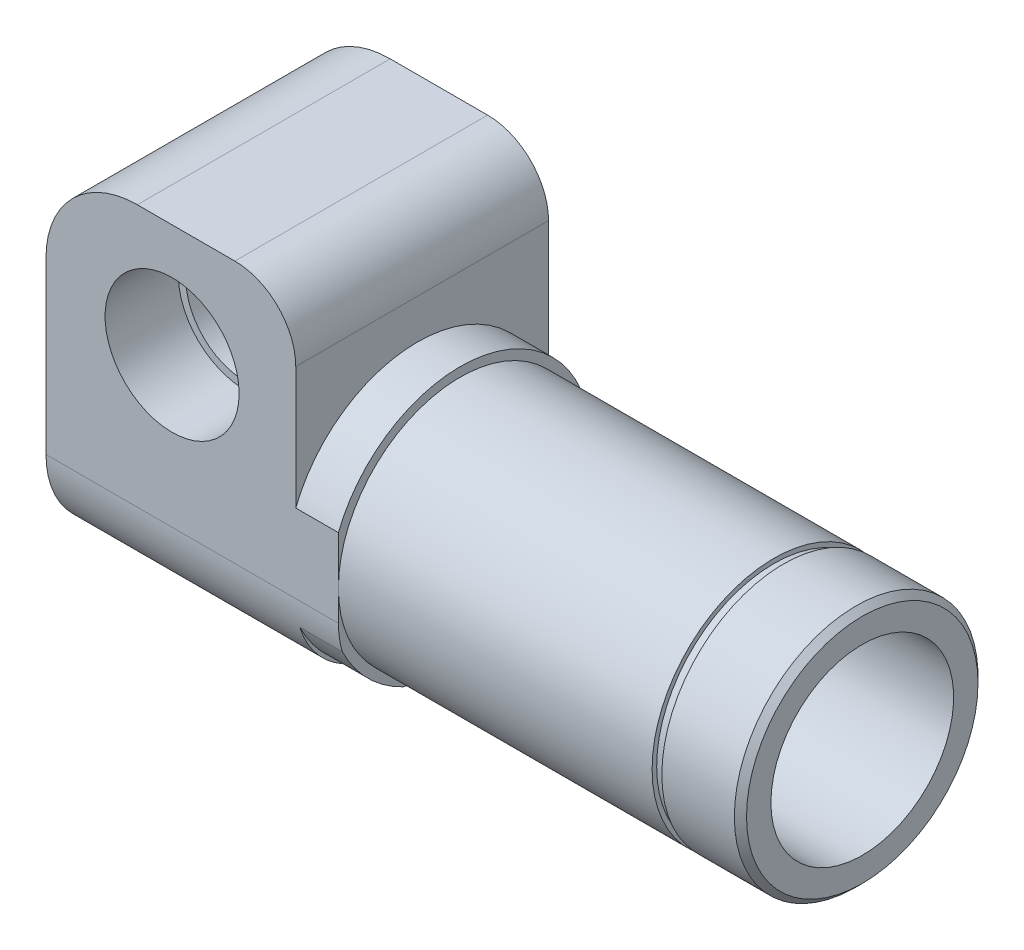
ISO-10303-21;
HEADER;
FILE_DESCRIPTION(('STEP AP214'),'2;1');
FILE_NAME('part.step','',(''),(''),'','','');
FILE_SCHEMA(('AUTOMOTIVE_DESIGN { 1 0 10303 214 1 1 1 1 }'));
ENDSEC;
DATA;
#1=APPLICATION_CONTEXT('core data for automotive mechanical design processes');
#2=APPLICATION_PROTOCOL_DEFINITION('international standard','automotive_design',2000,#1);
#3=PRODUCT_CONTEXT('',#1,'mechanical');
#4=PRODUCT('Part','Part','',(#3));
#5=PRODUCT_RELATED_PRODUCT_CATEGORY('part','',(#4));
#6=PRODUCT_DEFINITION_FORMATION('','',#4);
#7=PRODUCT_DEFINITION_CONTEXT('part definition',#1,'design');
#8=PRODUCT_DEFINITION('design','',#6,#7);
#9=PRODUCT_DEFINITION_SHAPE('','',#8);
#10=(LENGTH_UNIT() NAMED_UNIT(*) SI_UNIT(.MILLI.,.METRE.));
#11=(NAMED_UNIT(*) PLANE_ANGLE_UNIT() SI_UNIT($,.RADIAN.));
#12=(NAMED_UNIT(*) SI_UNIT($,.STERADIAN.) SOLID_ANGLE_UNIT());
#13=UNCERTAINTY_MEASURE_WITH_UNIT(LENGTH_MEASURE(1.E-05),#10,'distance_accuracy_value','');
#14=(GEOMETRIC_REPRESENTATION_CONTEXT(3) GLOBAL_UNCERTAINTY_ASSIGNED_CONTEXT((#13)) GLOBAL_UNIT_ASSIGNED_CONTEXT((#10,
#11,#12)) REPRESENTATION_CONTEXT('',''));
#15=CARTESIAN_POINT('',(0.,0.,0.));
#16=DIRECTION('',(0.,0.,1.));
#17=DIRECTION('',(1.,0.,0.));
#18=AXIS2_PLACEMENT_3D('',#15,#16,#17);
#19=CARTESIAN_POINT('',(1.66533453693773E-12,-2.77555756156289E-13,0.));
#20=DIRECTION('',(-1.,0.,0.));
#21=DIRECTION('',(0.,0.,1.));
#22=AXIS2_PLACEMENT_3D('',#19,#20,#21);
#23=CYLINDRICAL_SURFACE('',#22,20.);
#24=CARTESIAN_POINT('',(2.00000000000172,-3.60822483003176E-13,0.));
#25=DIRECTION('',(1.,0.,0.));
#26=DIRECTION('',(0.,0.,-1.));
#27=AXIS2_PLACEMENT_3D('',#24,#25,#26);
#28=CIRCLE('',#27,20.);
#29=CARTESIAN_POINT('',(2.00000000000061,-20.0000000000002,0.));
#30=VERTEX_POINT('',#29);
#31=CARTESIAN_POINT('',(2.00000000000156,-4.71844785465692E-13,19.9999999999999));
#32=VERTEX_POINT('',#31);
#33=EDGE_CURVE('E588',#30,#32,#28,.T.);
#34=ORIENTED_EDGE('',*,*,#33,.T.);
#35=EDGE_CURVE('E584',#32,#30,#28,.T.);
#36=ORIENTED_EDGE('',*,*,#35,.T.);
#37=EDGE_LOOP('',(#34,#36));
#38=FACE_BOUND('',#37,.T.);
#39=CARTESIAN_POINT('',(53.5000000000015,-3.60822483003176E-13,3.33066907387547E-13));
#40=DIRECTION('',(-1.,0.,0.));
#41=DIRECTION('',(0.,0.,1.));
#42=AXIS2_PLACEMENT_3D('',#39,#40,#41);
#43=CIRCLE('',#42,20.);
#44=CARTESIAN_POINT('',(53.5000000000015,-3.59712259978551E-13,20.0000000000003));
#45=VERTEX_POINT('',#44);
#46=EDGE_CURVE('E1612',#45,#45,#43,.T.);
#47=ORIENTED_EDGE('',*,*,#46,.T.);
#48=EDGE_LOOP('',(#47));
#49=FACE_BOUND('',#48,.T.);
#50=ADVANCED_FACE('F56',(#38,#49),#23,.T.);
#51=CARTESIAN_POINT('',(67.0000000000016,-1.94289029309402E-13,1.11022302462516E-13));
#52=DIRECTION('',(-1.,0.,0.));
#53=DIRECTION('',(0.,0.,1.));
#54=AXIS2_PLACEMENT_3D('',#51,#52,#53);
#55=CIRCLE('',#54,20.);
#56=CARTESIAN_POINT('',(67.0000000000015,-1.93178806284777E-13,20.0000000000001));
#57=VERTEX_POINT('',#56);
#58=EDGE_CURVE('E65',#57,#57,#55,.T.);
#59=ORIENTED_EDGE('',*,*,#58,.T.);
#60=EDGE_LOOP('',(#59));
#61=FACE_BOUND('',#60,.T.);
#62=CARTESIAN_POINT('',(55.100000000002,-2.22044604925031E-13,1.11022302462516E-13));
#63=DIRECTION('',(-1.,0.,0.));
#64=DIRECTION('',(0.,0.,1.));
#65=AXIS2_PLACEMENT_3D('',#62,#63,#64);
#66=CIRCLE('',#65,20.);
#67=CARTESIAN_POINT('',(55.100000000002,-2.20934381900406E-13,20.0000000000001));
#68=VERTEX_POINT('',#67);
#69=EDGE_CURVE('E1608',#68,#68,#66,.T.);
#70=ORIENTED_EDGE('',*,*,#69,.F.);
#71=EDGE_LOOP('',(#70));
#72=FACE_BOUND('',#71,.T.);
#73=ADVANCED_FACE('F362',(#61,#72),#23,.T.);
#74=CARTESIAN_POINT('',(-25.2999999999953,19.5000000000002,20.));
#75=DIRECTION('',(0.,0.,-1.));
#76=DIRECTION('',(0.,1.,0.));
#77=AXIS2_PLACEMENT_3D('',#74,#75,#76);
#78=CYLINDRICAL_SURFACE('',#77,9.75);
#79=CARTESIAN_POINT('',(-25.2999999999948,19.5000000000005,4.));
#80=DIRECTION('',(0.,0.,-1.));
#81=DIRECTION('',(-1.,0.,0.));
#82=AXIS2_PLACEMENT_3D('',#79,#80,#81);
#83=CIRCLE('',#82,9.75);
#84=CARTESIAN_POINT('',(-22.2269591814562,10.2469507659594,4.00000000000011));
#85=VERTEX_POINT('',#84);
#86=CARTESIAN_POINT('',(-28.3730408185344,10.2469507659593,3.99999999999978));
#87=VERTEX_POINT('',#86);
#88=EDGE_CURVE('E714',#85,#87,#83,.F.);
#89=ORIENTED_EDGE('',*,*,#88,.F.);
#90=CARTESIAN_POINT('',(-30.0762432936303,11.0000000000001,1.11022302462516E-13));
#91=CARTESIAN_POINT('',(-30.0762438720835,11.0000011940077,-0.142229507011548));
#92=CARTESIAN_POINT('',(-30.0713363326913,10.9972373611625,-0.28444595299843));
#93=CARTESIAN_POINT('',(-30.0516863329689,10.9862401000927,-0.568032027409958));
#94=CARTESIAN_POINT('',(-30.036941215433,10.9780051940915,-0.709401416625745));
#95=CARTESIAN_POINT('',(-29.9975403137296,10.9562232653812,-0.990487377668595));
#96=CARTESIAN_POINT('',(-29.9728744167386,10.9426708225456,-1.13020211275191));
#97=CARTESIAN_POINT('',(-29.9135468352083,10.9105399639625,-1.40695738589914));
#98=CARTESIAN_POINT('',(-29.8788818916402,10.891959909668,-1.54399703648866));
#99=CARTESIAN_POINT('',(-29.7994357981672,10.8501680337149,-1.81455510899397));
#100=CARTESIAN_POINT('',(-29.7546439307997,10.8269513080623,-1.94806963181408));
#101=CARTESIAN_POINT('',(-29.6548854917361,10.7764343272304,-2.21050333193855));
#102=CARTESIAN_POINT('',(-29.5999154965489,10.7491326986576,-2.33942094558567));
#103=CARTESIAN_POINT('',(-29.4798402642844,10.6911479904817,-2.59153879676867));
#104=CARTESIAN_POINT('',(-29.4147426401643,10.6604674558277,-2.71474323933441));
#105=CARTESIAN_POINT('',(-29.274428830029,10.5964971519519,-2.95460025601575));
#106=CARTESIAN_POINT('',(-29.199209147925,10.5632064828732,-3.07125054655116));
#107=CARTESIAN_POINT('',(-29.039048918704,10.4950262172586,-3.29670325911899));
#108=CARTESIAN_POINT('',(-28.9541349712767,10.4601411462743,-3.40552588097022));
#109=CARTESIAN_POINT('',(-28.7747667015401,10.389686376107,-3.61477983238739));
#110=CARTESIAN_POINT('',(-28.6803086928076,10.3541164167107,-3.71520789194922));
#111=CARTESIAN_POINT('',(-28.3833519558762,10.2480061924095,-4.00248699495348));
#112=CARTESIAN_POINT('',(-28.1670338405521,10.1779596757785,-4.17566813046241));
#113=CARTESIAN_POINT('',(-27.7195890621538,10.0523338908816,-4.46929073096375));
#114=CARTESIAN_POINT('',(-27.4904473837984,9.9960972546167,-4.59250293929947));
#115=CARTESIAN_POINT('',(-27.0120313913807,9.89838889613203,-4.79948411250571));
#116=CARTESIAN_POINT('',(-26.7627601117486,9.85691495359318,-4.88325900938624));
#117=CARTESIAN_POINT('',(-26.2609576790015,9.79429503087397,-5.00764337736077));
#118=CARTESIAN_POINT('',(-26.0088679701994,9.77247014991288,-5.04970003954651));
#119=CARTESIAN_POINT('',(-25.5003048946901,9.74873613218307,-5.09537291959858));
#120=CARTESIAN_POINT('',(-25.2438317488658,9.74682599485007,-5.09899106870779));
#121=CARTESIAN_POINT('',(-24.7355923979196,9.76305116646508,-5.0678517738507));
#122=CARTESIAN_POINT('',(-24.4838062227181,9.78105309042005,-5.03334968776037));
#123=CARTESIAN_POINT('',(-23.9903607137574,9.83516931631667,-4.92676168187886));
#124=CARTESIAN_POINT('',(-23.748700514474,9.87128206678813,-4.85467898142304));
#125=CARTESIAN_POINT('',(-23.2821369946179,9.95813945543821,-4.67391178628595));
#126=CARTESIAN_POINT('',(-23.0572434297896,10.0088925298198,-4.56520618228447));
#127=CARTESIAN_POINT('',(-22.6303756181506,10.1200048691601,-4.31327845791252));
#128=CARTESIAN_POINT('',(-22.4284007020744,10.1803638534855,-4.17005734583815));
#129=CARTESIAN_POINT('',(-22.0497592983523,10.3055041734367,-3.85049208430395));
#130=CARTESIAN_POINT('',(-21.8734295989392,10.3703302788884,-3.67376714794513));
#131=CARTESIAN_POINT('',(-21.5521567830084,10.4974390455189,-3.29302575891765));
#132=CARTESIAN_POINT('',(-21.4072201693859,10.5597211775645,-3.08900366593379));
#133=CARTESIAN_POINT('',(-21.1445765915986,10.6786215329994,-2.64971463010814));
#134=CARTESIAN_POINT('',(-21.0283407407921,10.7348720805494,-2.4134704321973));
#135=CARTESIAN_POINT('',(-20.8318910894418,10.8333623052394,-1.92372515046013));
#136=CARTESIAN_POINT('',(-20.7516901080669,10.8755969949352,-1.67021796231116));
#137=CARTESIAN_POINT('',(-20.6225748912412,10.9448847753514,-1.13457915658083));
#138=CARTESIAN_POINT('',(-20.5761864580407,10.9706966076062,-0.851677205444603));
#139=CARTESIAN_POINT('',(-20.5234381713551,11.000126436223,-0.280989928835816));
#140=CARTESIAN_POINT('',(-20.5170924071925,11.0037366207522,0.00679707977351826));
#141=CARTESIAN_POINT('',(-20.545030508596,10.9880622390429,0.594013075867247));
#142=CARTESIAN_POINT('',(-20.5813247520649,10.9676447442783,0.893319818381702));
#143=CARTESIAN_POINT('',(-20.6984830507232,10.9038988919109,1.48061762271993));
#144=CARTESIAN_POINT('',(-20.7793472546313,10.8605704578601,1.7686086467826));
#145=CARTESIAN_POINT('',(-20.9854305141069,10.755849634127,2.32167124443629));
#146=CARTESIAN_POINT('',(-21.1102237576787,10.6946315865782,2.5869334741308));
#147=CARTESIAN_POINT('',(-21.4041313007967,10.5607256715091,3.08843328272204));
#148=CARTESIAN_POINT('',(-21.5732226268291,10.4880437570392,3.32468581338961));
#149=CARTESIAN_POINT('',(-21.9413373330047,10.3447681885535,3.74596717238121));
#150=CARTESIAN_POINT('',(-22.1377972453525,10.2743323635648,3.93328817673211));
#151=CARTESIAN_POINT('',(-22.5631549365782,10.1393491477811,4.26924844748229));
#152=CARTESIAN_POINT('',(-22.7920413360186,10.0747997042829,4.41790123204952));
#153=CARTESIAN_POINT('',(-23.2600831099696,9.96294627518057,4.66443336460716));
#154=CARTESIAN_POINT('',(-23.4976583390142,9.9148063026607,4.7649415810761));
#155=CARTESIAN_POINT('',(-23.9884824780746,9.83541756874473,4.92673820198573));
#156=CARTESIAN_POINT('',(-24.2417300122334,9.80416732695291,4.98803004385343));
#157=CARTESIAN_POINT('',(-24.7496488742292,9.76229515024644,5.06948192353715));
#158=CARTESIAN_POINT('',(-25.0041157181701,9.75116288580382,5.09066020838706));
#159=CARTESIAN_POINT('',(-25.5134381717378,9.7490114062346,5.09478051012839));
#160=CARTESIAN_POINT('',(-25.7682937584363,9.75799104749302,5.07772470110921));
#161=CARTESIAN_POINT('',(-26.270283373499,9.79514554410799,5.00567004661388));
#162=CARTESIAN_POINT('',(-26.517440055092,9.82325712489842,4.95079626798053));
#163=CARTESIAN_POINT('',(-26.9978975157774,9.89590246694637,4.80393309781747));
#164=CARTESIAN_POINT('',(-27.2311994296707,9.94043488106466,4.71194675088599));
#165=CARTESIAN_POINT('',(-27.6780080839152,10.0416595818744,4.49217735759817));
#166=CARTESIAN_POINT('',(-27.8914736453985,10.0983763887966,4.36432196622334));
#167=CARTESIAN_POINT('',(-28.2926902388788,10.2182857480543,4.07565668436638));
#168=CARTESIAN_POINT('',(-28.4804420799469,10.2814780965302,3.91484783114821));
#169=CARTESIAN_POINT('',(-28.8296922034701,10.4093954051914,3.56096402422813));
#170=CARTESIAN_POINT('',(-28.990627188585,10.4741267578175,3.36733665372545));
#171=CARTESIAN_POINT('',(-29.2796602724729,10.5977754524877,2.95523696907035));
#172=CARTESIAN_POINT('',(-29.4077402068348,10.6566895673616,2.73675100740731));
#173=CARTESIAN_POINT('',(-29.6362237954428,10.766350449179,2.26859733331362));
#174=CARTESIAN_POINT('',(-29.7347732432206,10.8164892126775,2.01788545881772));
#175=CARTESIAN_POINT('',(-29.894692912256,10.9000290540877,1.50246034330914));
#176=CARTESIAN_POINT('',(-29.9560965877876,10.9334451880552,1.2377599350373));
#177=CARTESIAN_POINT('',(-30.0249646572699,10.9713442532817,0.809637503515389));
#178=CARTESIAN_POINT('',(-30.0441994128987,10.9820625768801,0.648527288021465));
#179=CARTESIAN_POINT('',(-30.0698382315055,10.9963896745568,0.324939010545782));
#180=CARTESIAN_POINT('',(-30.0762426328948,10.9999986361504,0.162460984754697));
#181=CARTESIAN_POINT('',(-30.0762432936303,11.0000000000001,1.11022302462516E-13));
#182=B_SPLINE_CURVE_WITH_KNOTS('',3,(#90,#91,#92,#93,#94,#95,#96,#97,#98,#99,#100,#101,#102,
#103,#104,#105,#106,#107,#108,#109,#110,#111,#112,#113,#114,#115,#116,#117,#118,#119,#120,#121,
#122,#123,#124,#125,#126,#127,#128,#129,#130,#131,#132,#133,#134,#135,#136,#137,#138,#139,#140,
#141,#142,#143,#144,#145,#146,#147,#148,#149,#150,#151,#152,#153,#154,#155,#156,#157,#158,#159,
#160,#161,#162,#163,#164,#165,#166,#167,#168,#169,#170,#171,#172,#173,#174,#175,#176,#177,#178,
#179,#180,#181),.UNSPECIFIED.,.T.,.F.,(4,2,2,2,2,2,2,2,2,2,2,2,2,2,2,2,2,2,2,2,2,2,2,2,2,2,2,2,
2,2,2,2,2,2,2,2,2,2,2,2,2,2,2,2,2,4),(0.,0.426554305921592,0.853223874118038,1.28032947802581,
1.70757444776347,2.13527371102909,2.563117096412,2.99064041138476,3.41831177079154,
3.84483665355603,4.27152691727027,5.1236544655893,5.91826711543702,6.71276020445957,
7.47861285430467,8.24442702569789,9.00514213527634,9.76579208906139,10.5268812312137,
11.2879481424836,12.0582487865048,12.8287088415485,13.6329228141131,14.4374226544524,
15.2971512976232,16.1571824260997,17.0594445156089,17.9617096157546,18.8554593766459,
19.7487465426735,20.5856411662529,21.4222428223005,22.2056110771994,22.988910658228,
23.7520455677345,24.5151370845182,25.27571703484,26.0362346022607,26.7982972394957,
27.5603358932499,28.3367779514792,29.1136483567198,29.9322113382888,30.7500360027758,
31.2372785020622,31.7245081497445),.UNSPECIFIED.);
#183=EDGE_CURVE('E532',#85,#87,#182,.T.);
#184=ORIENTED_EDGE('',*,*,#183,.T.);
#185=EDGE_LOOP('',(#89,#184));
#186=FACE_BOUND('',#185,.T.);
#187=CARTESIAN_POINT('',(-25.2999999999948,19.5000000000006,8.00000000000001));
#188=DIRECTION('',(0.,0.,1.));
#189=DIRECTION('',(1.,0.,0.));
#190=AXIS2_PLACEMENT_3D('',#187,#188,#189);
#191=CIRCLE('',#190,9.75);
#192=CARTESIAN_POINT('',(-15.5499999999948,19.5000000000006,8.00000000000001));
#193=VERTEX_POINT('',#192);
#194=EDGE_CURVE('E800',#193,#193,#191,.F.);
#195=ORIENTED_EDGE('',*,*,#194,.F.);
#196=EDGE_LOOP('',(#195));
#197=FACE_BOUND('',#196,.T.);
#198=ADVANCED_FACE('F383',(#186,#197),#78,.F.);
#199=CARTESIAN_POINT('',(1.49880108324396E-12,4.99999999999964,0.));
#200=DIRECTION('',(1.,0.,0.));
#201=DIRECTION('',(0.,0.,-1.));
#202=AXIS2_PLACEMENT_3D('',#199,#200,#201);
#203=PLANE('',#202);
#204=CARTESIAN_POINT('',(1.66533453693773E-12,-2.77555756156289E-13,0.));
#205=DIRECTION('',(1.,0.,0.));
#206=DIRECTION('',(0.,0.,1.));
#207=AXIS2_PLACEMENT_3D('',#204,#205,#206);
#208=CIRCLE('',#207,10.25);
#209=CARTESIAN_POINT('',(1.60982338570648E-12,7.69911159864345,-6.76654864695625));
#210=VERTEX_POINT('',#209);
#211=CARTESIAN_POINT('',(3.88578058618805E-13,7.69911159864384,6.76654864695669));
#212=VERTEX_POINT('',#211);
#213=EDGE_CURVE('E711',#210,#212,#208,.T.);
#214=ORIENTED_EDGE('',*,*,#213,.F.);
#215=CARTESIAN_POINT('',(1.38777878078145E-12,4.2499999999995,-7.36121593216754));
#216=DIRECTION('',(-1.,0.,0.));
#217=DIRECTION('',(0.,0.,1.));
#218=AXIS2_PLACEMENT_3D('',#215,#216,#217);
#219=CIRCLE('',#218,3.5);
#220=CARTESIAN_POINT('',(1.60982338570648E-12,2.49999999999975,-4.33012701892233));
#221=VERTEX_POINT('',#220);
#222=EDGE_CURVE('E445',#221,#210,#219,.T.);
#223=ORIENTED_EDGE('',*,*,#222,.F.);
#224=CARTESIAN_POINT('',(1.66533453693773E-12,-2.77555756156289E-13,0.));
#225=DIRECTION('',(-1.,0.,0.));
#226=DIRECTION('',(0.,0.,1.));
#227=AXIS2_PLACEMENT_3D('',#224,#225,#226);
#228=CIRCLE('',#227,5.);
#229=CARTESIAN_POINT('',(1.60982338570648E-12,2.4999999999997,4.33012701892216));
#230=VERTEX_POINT('',#229);
#231=EDGE_CURVE('E1622',#230,#221,#228,.T.);
#232=ORIENTED_EDGE('',*,*,#231,.F.);
#233=CARTESIAN_POINT('',(1.27675647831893E-12,4.24999999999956,7.36121593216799));
#234=DIRECTION('',(-1.,0.,0.));
#235=DIRECTION('',(0.,0.,1.));
#236=AXIS2_PLACEMENT_3D('',#233,#234,#235);
#237=CIRCLE('',#236,3.5);
#238=EDGE_CURVE('E465',#212,#230,#237,.T.);
#239=ORIENTED_EDGE('',*,*,#238,.F.);
#240=EDGE_LOOP('',(#214,#223,#232,#239));
#241=FACE_BOUND('',#240,.T.);
#242=ADVANCED_FACE('F388',(#241),#203,.F.);
#243=CARTESIAN_POINT('',(1.66533453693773E-12,-2.77555756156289E-13,0.));
#244=DIRECTION('',(1.,0.,0.));
#245=DIRECTION('',(0.,0.,1.));
#246=AXIS2_PLACEMENT_3D('',#243,#244,#245);
#247=CIRCLE('',#246,10.25);
#248=CARTESIAN_POINT('',(1.52655665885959E-12,-9.70955882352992,-3.28435190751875));
#249=VERTEX_POINT('',#248);
#250=CARTESIAN_POINT('',(1.55431223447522E-12,2.01044722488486,-10.0509005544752));
#251=VERTEX_POINT('',#250);
#252=EDGE_CURVE('E687',#249,#251,#247,.T.);
#253=ORIENTED_EDGE('',*,*,#252,.F.);
#254=CARTESIAN_POINT('',(1.60982338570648E-12,-8.50000000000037,2.77555756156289E-13));
#255=DIRECTION('',(-1.,0.,0.));
#256=DIRECTION('',(0.,0.,1.));
#257=AXIS2_PLACEMENT_3D('',#254,#255,#256);
#258=CIRCLE('',#257,3.5);
#259=CARTESIAN_POINT('',(1.49880108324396E-12,-5.00000000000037,-1.66533453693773E-13));
#260=VERTEX_POINT('',#259);
#261=EDGE_CURVE('E441',#260,#249,#258,.T.);
#262=ORIENTED_EDGE('',*,*,#261,.F.);
#263=EDGE_CURVE('E440',#221,#260,#228,.T.);
#264=ORIENTED_EDGE('',*,*,#263,.F.);
#265=EDGE_CURVE('E469',#251,#221,#219,.T.);
#266=ORIENTED_EDGE('',*,*,#265,.F.);
#267=EDGE_LOOP('',(#253,#262,#264,#266));
#268=FACE_BOUND('',#267,.T.);
#269=ADVANCED_FACE('F996',(#268),#203,.F.);
#270=CARTESIAN_POINT('',(1.66533453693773E-12,-2.77555756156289E-13,0.));
#271=DIRECTION('',(1.,0.,0.));
#272=DIRECTION('',(0.,0.,1.));
#273=AXIS2_PLACEMENT_3D('',#270,#271,#272);
#274=CIRCLE('',#273,10.25);
#275=CARTESIAN_POINT('',(1.0547118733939E-12,2.010447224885,10.0509005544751));
#276=VERTEX_POINT('',#275);
#277=CARTESIAN_POINT('',(7.21644966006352E-13,-9.70955882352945,3.28435190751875));
#278=VERTEX_POINT('',#277);
#279=EDGE_CURVE('E660',#276,#278,#274,.T.);
#280=ORIENTED_EDGE('',*,*,#279,.F.);
#281=EDGE_CURVE('E449',#230,#276,#237,.T.);
#282=ORIENTED_EDGE('',*,*,#281,.F.);
#283=EDGE_CURVE('E820',#260,#230,#228,.T.);
#284=ORIENTED_EDGE('',*,*,#283,.F.);
#285=EDGE_CURVE('E813',#278,#260,#258,.T.);
#286=ORIENTED_EDGE('',*,*,#285,.F.);
#287=EDGE_LOOP('',(#280,#282,#284,#286));
#288=FACE_BOUND('',#287,.T.);
#289=ADVANCED_FACE('F1000',(#288),#203,.F.);
#290=CARTESIAN_POINT('',(2.00000000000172,-3.60822483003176E-13,0.));
#291=DIRECTION('',(1.,0.,0.));
#292=DIRECTION('',(0.,0.,-1.));
#293=AXIS2_PLACEMENT_3D('',#290,#291,#292);
#294=PLANE('',#293);
#295=DIRECTION('',(0.,0.,-1.));
#296=VECTOR('',#295,1.);
#297=CARTESIAN_POINT('',(2.00000000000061,-20.0000000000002,0.));
#298=LINE('',#297,#296);
#299=CARTESIAN_POINT('',(2.00000000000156,-20.0000000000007,-6.4999999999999));
#300=VERTEX_POINT('',#299);
#301=EDGE_CURVE('E595',#30,#300,#298,.T.);
#302=ORIENTED_EDGE('',*,*,#301,.T.);
#303=CARTESIAN_POINT('',(2.00000000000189,-5.00000000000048,-6.50000000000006));
#304=DIRECTION('',(1.,0.,0.));
#305=DIRECTION('',(0.,0.,-1.));
#306=AXIS2_PLACEMENT_3D('',#303,#304,#305);
#307=CIRCLE('',#306,15.);
#308=CARTESIAN_POINT('',(2.00000000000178,-19.913920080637,-8.10467686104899));
#309=VERTEX_POINT('',#308);
#310=EDGE_CURVE('E303',#300,#309,#307,.T.);
#311=ORIENTED_EDGE('',*,*,#310,.T.);
#312=CARTESIAN_POINT('',(2.00000000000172,-3.60822483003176E-13,0.));
#313=DIRECTION('',(1.,0.,0.));
#314=DIRECTION('',(0.,0.,-1.));
#315=AXIS2_PLACEMENT_3D('',#312,#313,#314);
#316=CIRCLE('',#315,21.5);
#317=CARTESIAN_POINT('',(2.00000000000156,7.8898669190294,19.9999999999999));
#318=VERTEX_POINT('',#317);
#319=EDGE_CURVE('E573',#309,#318,#316,.T.);
#320=ORIENTED_EDGE('',*,*,#319,.T.);
#321=DIRECTION('',(0.,-1.,0.));
#322=VECTOR('',#321,1.);
#323=CARTESIAN_POINT('',(2.00000000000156,-4.71844785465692E-13,19.9999999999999));
#324=LINE('',#323,#322);
#325=EDGE_CURVE('E593',#318,#32,#324,.T.);
#326=ORIENTED_EDGE('',*,*,#325,.T.);
#327=ORIENTED_EDGE('',*,*,#33,.F.);
#328=EDGE_LOOP('',(#302,#311,#320,#326,#327));
#329=FACE_BOUND('',#328,.T.);
#330=ADVANCED_FACE('F1011',(#329),#294,.T.);
#331=CARTESIAN_POINT('',(2.00000000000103,-5.00000000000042,20.));
#332=VERTEX_POINT('',#331);
#333=EDGE_CURVE('E589',#32,#332,#324,.T.);
#334=ORIENTED_EDGE('',*,*,#333,.T.);
#335=CARTESIAN_POINT('',(2.00000000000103,-5.00000000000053,5.));
#336=DIRECTION('',(1.,0.,0.));
#337=DIRECTION('',(0.,0.,-1.));
#338=AXIS2_PLACEMENT_3D('',#335,#336,#337);
#339=CIRCLE('',#338,15.);
#340=CARTESIAN_POINT('',(2.00000000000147,-9.37816516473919,19.3468348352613));
#341=VERTEX_POINT('',#340);
#342=EDGE_CURVE('E318',#332,#341,#339,.T.);
#343=ORIENTED_EDGE('',*,*,#342,.T.);
#344=CARTESIAN_POINT('',(2.00000000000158,-19.346834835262,9.37816516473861));
#345=VERTEX_POINT('',#344);
#346=EDGE_CURVE('E579',#341,#345,#316,.T.);
#347=ORIENTED_EDGE('',*,*,#346,.T.);
#348=CARTESIAN_POINT('',(2.00000000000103,-5.00000000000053,5.));
#349=DIRECTION('',(1.,0.,0.));
#350=DIRECTION('',(0.,0.,-1.));
#351=AXIS2_PLACEMENT_3D('',#348,#349,#350);
#352=CIRCLE('',#351,15.);
#353=CARTESIAN_POINT('',(2.00000000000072,-20.0000000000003,5.00000000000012));
#354=VERTEX_POINT('',#353);
#355=EDGE_CURVE('E315',#345,#354,#352,.T.);
#356=ORIENTED_EDGE('',*,*,#355,.T.);
#357=EDGE_CURVE('E594',#354,#30,#298,.T.);
#358=ORIENTED_EDGE('',*,*,#357,.T.);
#359=ORIENTED_EDGE('',*,*,#35,.F.);
#360=EDGE_LOOP('',(#334,#343,#347,#356,#358,#359));
#361=FACE_BOUND('',#360,.T.);
#362=ADVANCED_FACE('F1016',(#361),#294,.T.);
#363=CARTESIAN_POINT('',(2.00000000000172,-3.60822483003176E-13,0.));
#364=DIRECTION('',(-1.,0.,0.));
#365=DIRECTION('',(0.,0.,1.));
#366=AXIS2_PLACEMENT_3D('',#363,#364,#365);
#367=CYLINDRICAL_SURFACE('',#366,21.5);
#368=ORIENTED_EDGE('',*,*,#346,.F.);
#369=DIRECTION('',(-1.,0.,0.));
#370=VECTOR('',#369,1.);
#371=CARTESIAN_POINT('',(2.00000000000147,-9.37816516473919,19.3468348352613));
#372=LINE('',#371,#370);
#373=CARTESIAN_POINT('',(-4.99999999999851,-9.37816516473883,19.3468348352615));
#374=VERTEX_POINT('',#373);
#375=EDGE_CURVE('E324',#341,#374,#372,.T.);
#376=ORIENTED_EDGE('',*,*,#375,.T.);
#377=CARTESIAN_POINT('',(-4.99999999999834,-2.77555756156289E-13,-1.66533453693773E-13));
#378=DIRECTION('',(1.,0.,0.));
#379=DIRECTION('',(0.,0.,-1.));
#380=AXIS2_PLACEMENT_3D('',#377,#378,#379);
#381=CIRCLE('',#380,21.5);
#382=CARTESIAN_POINT('',(-4.99999999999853,-19.346834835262,9.37816516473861));
#383=VERTEX_POINT('',#382);
#384=EDGE_CURVE('E606',#374,#383,#381,.T.);
#385=ORIENTED_EDGE('',*,*,#384,.T.);
#386=DIRECTION('',(-1.,0.,0.));
#387=VECTOR('',#386,1.);
#388=CARTESIAN_POINT('',(-4.99999999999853,-19.346834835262,9.37816516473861));
#389=LINE('',#388,#387);
#390=EDGE_CURVE('E321',#383,#345,#389,.F.);
#391=ORIENTED_EDGE('',*,*,#390,.T.);
#392=EDGE_LOOP('',(#368,#376,#385,#391));
#393=FACE_BOUND('',#392,.T.);
#394=ADVANCED_FACE('F1023',(#393),#367,.T.);
#395=ORIENTED_EDGE('',*,*,#319,.F.);
#396=DIRECTION('',(-1.,0.,0.));
#397=VECTOR('',#396,1.);
#398=CARTESIAN_POINT('',(2.00000000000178,-19.913920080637,-8.10467686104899));
#399=LINE('',#398,#397);
#400=CARTESIAN_POINT('',(-4.99999999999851,-19.9139200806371,-8.10467686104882));
#401=VERTEX_POINT('',#400);
#402=EDGE_CURVE('E306',#309,#401,#399,.T.);
#403=ORIENTED_EDGE('',*,*,#402,.T.);
#404=CARTESIAN_POINT('',(-4.99999999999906,-8.32667268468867E-13,-21.5000000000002));
#405=VERTEX_POINT('',#404);
#406=EDGE_CURVE('E607',#401,#405,#381,.T.);
#407=ORIENTED_EDGE('',*,*,#406,.T.);
#408=CARTESIAN_POINT('',(-4.99999999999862,7.88986691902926,20.0000000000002));
#409=VERTEX_POINT('',#408);
#410=EDGE_CURVE('E602',#405,#409,#381,.T.);
#411=ORIENTED_EDGE('',*,*,#410,.T.);
#412=DIRECTION('',(-1.,0.,0.));
#413=VECTOR('',#412,1.);
#414=CARTESIAN_POINT('',(2.00000000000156,7.88986691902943,19.9999999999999));
#415=LINE('',#414,#413);
#416=EDGE_CURVE('E426',#318,#409,#415,.T.);
#417=ORIENTED_EDGE('',*,*,#416,.F.);
#418=EDGE_LOOP('',(#395,#403,#407,#411,#417));
#419=FACE_BOUND('',#418,.T.);
#420=ADVANCED_FACE('F404',(#419),#367,.T.);
#421=CARTESIAN_POINT('',(1.66533453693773E-12,-2.77555756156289E-13,0.));
#422=DIRECTION('',(-1.,0.,0.));
#423=DIRECTION('',(0.,0.,1.));
#424=AXIS2_PLACEMENT_3D('',#421,#422,#423);
#425=CYLINDRICAL_SURFACE('',#424,5.);
#426=CARTESIAN_POINT('',(3.00000000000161,-4.9960036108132E-13,0.));
#427=DIRECTION('',(-1.,0.,0.));
#428=DIRECTION('',(0.,0.,1.));
#429=AXIS2_PLACEMENT_3D('',#426,#427,#428);
#430=CIRCLE('',#429,5.);
#431=CARTESIAN_POINT('',(3.00000000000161,-4.99322805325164E-13,5.));
#432=VERTEX_POINT('',#431);
#433=EDGE_CURVE('E424',#432,#432,#430,.T.);
#434=ORIENTED_EDGE('',*,*,#433,.F.);
#435=EDGE_LOOP('',(#434));
#436=FACE_BOUND('',#435,.T.);
#437=ORIENTED_EDGE('',*,*,#283,.T.);
#438=ORIENTED_EDGE('',*,*,#231,.T.);
#439=ORIENTED_EDGE('',*,*,#263,.T.);
#440=EDGE_LOOP('',(#437,#438,#439));
#441=FACE_BOUND('',#440,.T.);
#442=ADVANCED_FACE('F58',(#436,#441),#425,.F.);
#443=CARTESIAN_POINT('',(3.00000000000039,4.99999999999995,1.11022302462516E-13));
#444=DIRECTION('',(-1.,0.,0.));
#445=DIRECTION('',(0.,0.,1.));
#446=AXIS2_PLACEMENT_3D('',#443,#444,#445);
#447=PLANE('',#446);
#448=CARTESIAN_POINT('',(3.00000000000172,4.24999999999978,7.36121593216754));
#449=DIRECTION('',(-1.,0.,0.));
#450=DIRECTION('',(0.,0.,1.));
#451=AXIS2_PLACEMENT_3D('',#448,#449,#450);
#452=CIRCLE('',#451,1.69999999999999);
#453=CARTESIAN_POINT('',(3.00000000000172,4.24999999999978,9.06121593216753));
#454=VERTEX_POINT('',#453);
#455=EDGE_CURVE('E409',#454,#454,#452,.T.);
#456=ORIENTED_EDGE('',*,*,#455,.T.);
#457=EDGE_LOOP('',(#456));
#458=FACE_BOUND('',#457,.T.);
#459=CARTESIAN_POINT('',(3.00000000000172,4.24999999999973,-7.36121593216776));
#460=DIRECTION('',(-1.,0.,0.));
#461=DIRECTION('',(0.,0.,1.));
#462=AXIS2_PLACEMENT_3D('',#459,#460,#461);
#463=CIRCLE('',#462,1.69999999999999);
#464=CARTESIAN_POINT('',(3.00000000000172,4.24999999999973,-5.66121593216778));
#465=VERTEX_POINT('',#464);
#466=EDGE_CURVE('E413',#465,#465,#463,.T.);
#467=ORIENTED_EDGE('',*,*,#466,.T.);
#468=EDGE_LOOP('',(#467));
#469=FACE_BOUND('',#468,.T.);
#470=CARTESIAN_POINT('',(3.00000000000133,-8.50000000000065,-2.22044604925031E-13));
#471=DIRECTION('',(-1.,0.,0.));
#472=DIRECTION('',(0.,0.,1.));
#473=AXIS2_PLACEMENT_3D('',#470,#471,#472);
#474=CIRCLE('',#473,1.69999999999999);
#475=CARTESIAN_POINT('',(3.00000000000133,-8.50000000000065,1.69999999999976));
#476=VERTEX_POINT('',#475);
#477=EDGE_CURVE('E417',#476,#476,#474,.T.);
#478=ORIENTED_EDGE('',*,*,#477,.T.);
#479=EDGE_LOOP('',(#478));
#480=FACE_BOUND('',#479,.T.);
#481=CARTESIAN_POINT('',(3.00000000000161,-4.9960036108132E-13,0.));
#482=DIRECTION('',(-1.,0.,0.));
#483=DIRECTION('',(0.,0.,1.));
#484=AXIS2_PLACEMENT_3D('',#481,#482,#483);
#485=CIRCLE('',#484,15.);
#486=CARTESIAN_POINT('',(3.0000000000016,-4.98767693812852E-13,15.));
#487=VERTEX_POINT('',#486);
#488=EDGE_CURVE('E421',#487,#487,#485,.T.);
#489=ORIENTED_EDGE('',*,*,#488,.F.);
#490=EDGE_LOOP('',(#489));
#491=FACE_BOUND('',#490,.T.);
#492=ORIENTED_EDGE('',*,*,#433,.T.);
#493=EDGE_LOOP('',(#492));
#494=FACE_BOUND('',#493,.T.);
#495=ADVANCED_FACE('F397',(#458,#469,#480,#491,#494),#447,.F.);
#496=CARTESIAN_POINT('',(1.66533453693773E-12,-2.77555756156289E-13,0.));
#497=DIRECTION('',(-1.,0.,0.));
#498=DIRECTION('',(0.,0.,1.));
#499=AXIS2_PLACEMENT_3D('',#496,#497,#498);
#500=CYLINDRICAL_SURFACE('',#499,15.);
#501=CARTESIAN_POINT('',(68.0000000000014,-2.4980018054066E-13,0.));
#502=DIRECTION('',(-1.,0.,0.));
#503=DIRECTION('',(0.,0.,1.));
#504=AXIS2_PLACEMENT_3D('',#501,#502,#503);
#505=CIRCLE('',#504,15.);
#506=CARTESIAN_POINT('',(68.0000000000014,-2.48967513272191E-13,15.));
#507=VERTEX_POINT('',#506);
#508=EDGE_CURVE('E434',#507,#507,#505,.T.);
#509=ORIENTED_EDGE('',*,*,#508,.F.);
#510=EDGE_LOOP('',(#509));
#511=FACE_BOUND('',#510,.T.);
#512=ORIENTED_EDGE('',*,*,#488,.T.);
#513=EDGE_LOOP('',(#512));
#514=FACE_BOUND('',#513,.T.);
#515=ADVANCED_FACE('F394',(#511,#514),#500,.F.);
#516=CARTESIAN_POINT('',(68.0000000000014,19.9999999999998,0.));
#517=DIRECTION('',(-1.,0.,0.));
#518=DIRECTION('',(0.,0.,1.));
#519=AXIS2_PLACEMENT_3D('',#516,#517,#518);
#520=PLANE('',#519);
#521=CARTESIAN_POINT('',(68.0000000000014,-2.4980018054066E-13,0.));
#522=DIRECTION('',(-1.,0.,0.));
#523=DIRECTION('',(0.,0.,1.));
#524=AXIS2_PLACEMENT_3D('',#521,#522,#523);
#525=CIRCLE('',#524,19.);
#526=CARTESIAN_POINT('',(68.0000000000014,-2.48745468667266E-13,19.));
#527=VERTEX_POINT('',#526);
#528=EDGE_CURVE('E12',#527,#527,#525,.F.);
#529=ORIENTED_EDGE('',*,*,#528,.T.);
#530=EDGE_LOOP('',(#529));
#531=FACE_BOUND('',#530,.T.);
#532=ORIENTED_EDGE('',*,*,#508,.T.);
#533=EDGE_LOOP('',(#532));
#534=FACE_BOUND('',#533,.T.);
#535=ADVANCED_FACE('F390',(#531,#534),#520,.F.);
#536=CARTESIAN_POINT('',(1.60982338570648E-12,-8.50000000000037,2.77555756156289E-13));
#537=DIRECTION('',(-1.,0.,0.));
#538=DIRECTION('',(0.,0.,1.));
#539=AXIS2_PLACEMENT_3D('',#536,#537,#538);
#540=CYLINDRICAL_SURFACE('',#539,1.69999999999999);
#541=CARTESIAN_POINT('',(1.80000000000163,-8.50000000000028,-1.66533453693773E-13));
#542=DIRECTION('',(-1.,0.,0.));
#543=DIRECTION('',(0.,0.,1.));
#544=AXIS2_PLACEMENT_3D('',#541,#542,#543);
#545=CIRCLE('',#544,1.69999999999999);
#546=CARTESIAN_POINT('',(1.80000000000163,-8.50000000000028,1.69999999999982));
#547=VERTEX_POINT('',#546);
#548=EDGE_CURVE('E444',#547,#547,#545,.T.);
#549=ORIENTED_EDGE('',*,*,#548,.T.);
#550=EDGE_LOOP('',(#549));
#551=FACE_BOUND('',#550,.T.);
#552=ORIENTED_EDGE('',*,*,#477,.F.);
#553=EDGE_LOOP('',(#552));
#554=FACE_BOUND('',#553,.T.);
#555=ADVANCED_FACE('F393',(#551,#554),#540,.F.);
#556=CARTESIAN_POINT('',(1.60982338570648E-12,-8.50000000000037,2.77555756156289E-13));
#557=DIRECTION('',(-1.,0.,0.));
#558=DIRECTION('',(0.,0.,1.));
#559=AXIS2_PLACEMENT_3D('',#556,#557,#558);
#560=CONICAL_SURFACE('',#559,3.5,0.785398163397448);
#561=ORIENTED_EDGE('',*,*,#548,.F.);
#562=EDGE_LOOP('',(#561));
#563=FACE_BOUND('',#562,.T.);
#564=ORIENTED_EDGE('',*,*,#261,.T.);
#565=EDGE_CURVE('E816',#249,#278,#258,.T.);
#566=ORIENTED_EDGE('',*,*,#565,.T.);
#567=ORIENTED_EDGE('',*,*,#285,.T.);
#568=EDGE_LOOP('',(#564,#566,#567));
#569=FACE_BOUND('',#568,.T.);
#570=ADVANCED_FACE('F832',(#563,#569),#560,.F.);
#571=CARTESIAN_POINT('',(1.38777878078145E-12,4.2499999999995,-7.36121593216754));
#572=DIRECTION('',(-1.,0.,0.));
#573=DIRECTION('',(0.,0.,1.));
#574=AXIS2_PLACEMENT_3D('',#571,#572,#573);
#575=CYLINDRICAL_SURFACE('',#574,1.69999999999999);
#576=CARTESIAN_POINT('',(1.80000000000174,4.24999999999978,-7.36121593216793));
#577=DIRECTION('',(-1.,0.,0.));
#578=DIRECTION('',(0.,0.,1.));
#579=AXIS2_PLACEMENT_3D('',#576,#577,#578);
#580=CIRCLE('',#579,1.69999999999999);
#581=CARTESIAN_POINT('',(1.80000000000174,4.24999999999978,-5.66121593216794));
#582=VERTEX_POINT('',#581);
#583=EDGE_CURVE('E448',#582,#582,#580,.T.);
#584=ORIENTED_EDGE('',*,*,#583,.T.);
#585=EDGE_LOOP('',(#584));
#586=FACE_BOUND('',#585,.T.);
#587=ORIENTED_EDGE('',*,*,#466,.F.);
#588=EDGE_LOOP('',(#587));
#589=FACE_BOUND('',#588,.T.);
#590=ADVANCED_FACE('F923',(#586,#589),#575,.F.);
#591=CARTESIAN_POINT('',(1.38777878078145E-12,4.2499999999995,-7.36121593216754));
#592=DIRECTION('',(-1.,0.,0.));
#593=DIRECTION('',(0.,0.,1.));
#594=AXIS2_PLACEMENT_3D('',#591,#592,#593);
#595=CONICAL_SURFACE('',#594,3.5,0.785398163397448);
#596=ORIENTED_EDGE('',*,*,#583,.F.);
#597=EDGE_LOOP('',(#596));
#598=FACE_BOUND('',#597,.T.);
#599=ORIENTED_EDGE('',*,*,#222,.T.);
#600=EDGE_CURVE('E872',#210,#251,#219,.T.);
#601=ORIENTED_EDGE('',*,*,#600,.T.);
#602=ORIENTED_EDGE('',*,*,#265,.T.);
#603=EDGE_LOOP('',(#599,#601,#602));
#604=FACE_BOUND('',#603,.T.);
#605=ADVANCED_FACE('F871',(#598,#604),#595,.F.);
#606=CARTESIAN_POINT('',(1.27675647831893E-12,4.24999999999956,7.36121593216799));
#607=DIRECTION('',(-1.,0.,0.));
#608=DIRECTION('',(0.,0.,1.));
#609=AXIS2_PLACEMENT_3D('',#606,#607,#608);
#610=CYLINDRICAL_SURFACE('',#609,1.69999999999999);
#611=CARTESIAN_POINT('',(1.8000000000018,4.24999999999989,7.36121593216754));
#612=DIRECTION('',(-1.,0.,0.));
#613=DIRECTION('',(0.,0.,1.));
#614=AXIS2_PLACEMENT_3D('',#611,#612,#613);
#615=CIRCLE('',#614,1.69999999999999);
#616=CARTESIAN_POINT('',(1.8000000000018,4.24999999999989,9.06121593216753));
#617=VERTEX_POINT('',#616);
#618=EDGE_CURVE('E459',#617,#617,#615,.T.);
#619=ORIENTED_EDGE('',*,*,#618,.T.);
#620=EDGE_LOOP('',(#619));
#621=FACE_BOUND('',#620,.T.);
#622=ORIENTED_EDGE('',*,*,#455,.F.);
#623=EDGE_LOOP('',(#622));
#624=FACE_BOUND('',#623,.T.);
#625=ADVANCED_FACE('F910',(#621,#624),#610,.F.);
#626=CARTESIAN_POINT('',(1.27675647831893E-12,4.24999999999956,7.36121593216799));
#627=DIRECTION('',(-1.,0.,0.));
#628=DIRECTION('',(0.,0.,1.));
#629=AXIS2_PLACEMENT_3D('',#626,#627,#628);
#630=CONICAL_SURFACE('',#629,3.5,0.785398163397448);
#631=ORIENTED_EDGE('',*,*,#618,.F.);
#632=EDGE_LOOP('',(#631));
#633=FACE_BOUND('',#632,.T.);
#634=ORIENTED_EDGE('',*,*,#281,.T.);
#635=EDGE_CURVE('E454',#276,#212,#237,.T.);
#636=ORIENTED_EDGE('',*,*,#635,.T.);
#637=ORIENTED_EDGE('',*,*,#238,.T.);
#638=EDGE_LOOP('',(#634,#636,#637));
#639=FACE_BOUND('',#638,.T.);
#640=ADVANCED_FACE('F859',(#633,#639),#630,.F.);
#641=CARTESIAN_POINT('',(-46.,0.,1.66533453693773E-13));
#642=DIRECTION('',(-1.,0.,0.));
#643=DIRECTION('',(0.,0.,1.));
#644=AXIS2_PLACEMENT_3D('',#641,#642,#643);
#645=PLANE('',#644);
#646=CARTESIAN_POINT('',(-45.9999999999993,14.4999999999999,-1.66533453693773E-13));
#647=DIRECTION('',(-1.,0.,0.));
#648=DIRECTION('',(0.,0.,1.));
#649=AXIS2_PLACEMENT_3D('',#646,#647,#648);
#650=CIRCLE('',#649,2.);
#651=CARTESIAN_POINT('',(-45.9999999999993,14.4999999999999,1.99999999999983));
#652=VERTEX_POINT('',#651);
#653=EDGE_CURVE('E635',#652,#652,#650,.T.);
#654=ORIENTED_EDGE('',*,*,#653,.F.);
#655=EDGE_LOOP('',(#654));
#656=FACE_BOUND('',#655,.T.);
#657=CARTESIAN_POINT('',(-45.999999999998,-7.25000000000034,-12.5573683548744));
#658=DIRECTION('',(-1.,0.,0.));
#659=DIRECTION('',(0.,0.,1.));
#660=AXIS2_PLACEMENT_3D('',#657,#658,#659);
#661=CIRCLE('',#660,2.);
#662=CARTESIAN_POINT('',(-45.999999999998,-7.25000000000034,-10.5573683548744));
#663=VERTEX_POINT('',#662);
#664=EDGE_CURVE('E627',#663,#663,#661,.T.);
#665=ORIENTED_EDGE('',*,*,#664,.F.);
#666=EDGE_LOOP('',(#665));
#667=FACE_BOUND('',#666,.T.);
#668=CARTESIAN_POINT('',(-45.9999999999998,-7.24999999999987,12.5573683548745));
#669=DIRECTION('',(-1.,0.,0.));
#670=DIRECTION('',(0.,0.,1.));
#671=AXIS2_PLACEMENT_3D('',#668,#669,#670);
#672=CIRCLE('',#671,2.);
#673=CARTESIAN_POINT('',(-45.9999999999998,-7.24999999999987,14.5573683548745));
#674=VERTEX_POINT('',#673);
#675=EDGE_CURVE('E615',#674,#674,#672,.T.);
#676=ORIENTED_EDGE('',*,*,#675,.F.);
#677=EDGE_LOOP('',(#676));
#678=FACE_BOUND('',#677,.T.);
#679=DIRECTION('',(0.,1.,0.));
#680=VECTOR('',#679,1.);
#681=CARTESIAN_POINT('',(-45.9999999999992,-20.0000000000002,19.9999999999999));
#682=LINE('',#681,#680);
#683=CARTESIAN_POINT('',(-45.9999999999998,-5.00000000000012,19.9999999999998));
#684=VERTEX_POINT('',#683);
#685=CARTESIAN_POINT('',(-45.9999999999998,23.,20.));
#686=VERTEX_POINT('',#685);
#687=EDGE_CURVE('E767',#684,#686,#682,.T.);
#688=ORIENTED_EDGE('',*,*,#687,.T.);
#689=DIRECTION('',(0.,0.,-0.999999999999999));
#690=VECTOR('',#689,1.);
#691=CARTESIAN_POINT('',(-45.9999999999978,22.9999999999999,0.));
#692=LINE('',#691,#690);
#693=CARTESIAN_POINT('',(-46.,22.9999999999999,-21.5));
#694=VERTEX_POINT('',#693);
#695=EDGE_CURVE('E330',#686,#694,#692,.T.);
#696=ORIENTED_EDGE('',*,*,#695,.T.);
#697=DIRECTION('',(0.,-1.,0.));
#698=VECTOR('',#697,1.);
#699=CARTESIAN_POINT('',(-45.9999999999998,-20.,-21.5000000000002));
#700=LINE('',#699,#698);
#701=CARTESIAN_POINT('',(-45.9999999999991,-5.00000000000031,-21.5));
#702=VERTEX_POINT('',#701);
#703=EDGE_CURVE('E541',#694,#702,#700,.T.);
#704=ORIENTED_EDGE('',*,*,#703,.T.);
#705=CARTESIAN_POINT('',(-45.9999999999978,-5.0000000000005,-6.50000000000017));
#706=DIRECTION('',(-1.,0.,0.));
#707=DIRECTION('',(0.,0.,1.));
#708=AXIS2_PLACEMENT_3D('',#705,#706,#707);
#709=CIRCLE('',#708,15.);
#710=CARTESIAN_POINT('',(-45.9999999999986,-20.0000000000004,-6.50000000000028));
#711=VERTEX_POINT('',#710);
#712=EDGE_CURVE('E291',#702,#711,#709,.T.);
#713=ORIENTED_EDGE('',*,*,#712,.T.);
#714=DIRECTION('',(0.,0.,0.999999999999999));
#715=VECTOR('',#714,1.);
#716=CARTESIAN_POINT('',(-45.9999999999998,-20.,-21.5000000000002));
#717=LINE('',#716,#715);
#718=CARTESIAN_POINT('',(-45.9999999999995,-20.0000000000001,4.99999999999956));
#719=VERTEX_POINT('',#718);
#720=EDGE_CURVE('E772',#711,#719,#717,.T.);
#721=ORIENTED_EDGE('',*,*,#720,.T.);
#722=CARTESIAN_POINT('',(-45.9999999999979,-5.00000000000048,4.99999999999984));
#723=DIRECTION('',(-1.,0.,0.));
#724=DIRECTION('',(0.,0.,1.));
#725=AXIS2_PLACEMENT_3D('',#722,#723,#724);
#726=CIRCLE('',#725,15.);
#727=EDGE_CURVE('E288',#719,#684,#726,.T.);
#728=ORIENTED_EDGE('',*,*,#727,.T.);
#729=EDGE_LOOP('',(#688,#696,#704,#713,#721,#728));
#730=FACE_BOUND('',#729,.T.);
#731=CARTESIAN_POINT('',(-46.,0.,1.66533453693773E-13));
#732=DIRECTION('',(-1.,0.,0.));
#733=DIRECTION('',(0.,0.,1.));
#734=AXIS2_PLACEMENT_3D('',#731,#732,#733);
#735=CIRCLE('',#734,11.);
#736=CARTESIAN_POINT('',(-45.9999999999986,2.92976588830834,-10.6026634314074));
#737=VERTEX_POINT('',#736);
#738=CARTESIAN_POINT('',(-45.9999999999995,-10.6470588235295,-2.76408002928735));
#739=VERTEX_POINT('',#738);
#740=EDGE_CURVE('E759',#737,#739,#735,.T.);
#741=ORIENTED_EDGE('',*,*,#740,.F.);
#742=CARTESIAN_POINT('',(-45.9999999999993,4.24999999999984,-7.36121593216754));
#743=DIRECTION('',(-1.,0.,0.));
#744=DIRECTION('',(0.,0.,1.));
#745=AXIS2_PLACEMENT_3D('',#742,#743,#744);
#746=CIRCLE('',#745,3.5);
#747=CARTESIAN_POINT('',(-46.,7.71729293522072,-7.83858340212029));
#748=VERTEX_POINT('',#747);
#749=EDGE_CURVE('E762',#748,#737,#746,.T.);
#750=ORIENTED_EDGE('',*,*,#749,.F.);
#751=CARTESIAN_POINT('',(-46.,0.,1.66533453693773E-13));
#752=DIRECTION('',(-1.,0.,0.));
#753=DIRECTION('',(0.,0.,1.));
#754=AXIS2_PLACEMENT_3D('',#751,#752,#753);
#755=CIRCLE('',#754,11.);
#756=CARTESIAN_POINT('',(-45.9999999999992,7.71729293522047,7.83858340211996));
#757=VERTEX_POINT('',#756);
#758=EDGE_CURVE('E741',#757,#748,#755,.T.);
#759=ORIENTED_EDGE('',*,*,#758,.F.);
#760=CARTESIAN_POINT('',(-45.9999999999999,4.25,7.36121593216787));
#761=DIRECTION('',(-1.,0.,0.));
#762=DIRECTION('',(0.,0.,1.));
#763=AXIS2_PLACEMENT_3D('',#760,#761,#762);
#764=CIRCLE('',#763,3.5);
#765=CARTESIAN_POINT('',(-45.9999999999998,2.92976588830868,10.6026634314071));
#766=VERTEX_POINT('',#765);
#767=EDGE_CURVE('E747',#766,#757,#764,.T.);
#768=ORIENTED_EDGE('',*,*,#767,.F.);
#769=CARTESIAN_POINT('',(-46.,0.,1.66533453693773E-13));
#770=DIRECTION('',(-1.,0.,0.));
#771=DIRECTION('',(0.,0.,1.));
#772=AXIS2_PLACEMENT_3D('',#769,#770,#771);
#773=CIRCLE('',#772,11.);
#774=CARTESIAN_POINT('',(-45.9999999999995,-10.6470588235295,2.76408002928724));
#775=VERTEX_POINT('',#774);
#776=EDGE_CURVE('E752',#775,#766,#773,.T.);
#777=ORIENTED_EDGE('',*,*,#776,.F.);
#778=CARTESIAN_POINT('',(-45.999999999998,-8.50000000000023,0.));
#779=DIRECTION('',(-1.,0.,0.));
#780=DIRECTION('',(0.,0.,1.));
#781=AXIS2_PLACEMENT_3D('',#778,#779,#780);
#782=CIRCLE('',#781,3.5);
#783=EDGE_CURVE('E756',#739,#775,#782,.T.);
#784=ORIENTED_EDGE('',*,*,#783,.F.);
#785=EDGE_LOOP('',(#741,#750,#759,#768,#777,#784));
#786=FACE_BOUND('',#785,.T.);
#787=ADVANCED_FACE('F779',(#656,#667,#678,#730,#786),#645,.T.);
#788=CARTESIAN_POINT('',(-45.9999999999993,4.24999999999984,-7.36121593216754));
#789=DIRECTION('',(1.,0.,0.));
#790=DIRECTION('',(0.,0.,-1.));
#791=AXIS2_PLACEMENT_3D('',#788,#789,#790);
#792=CYLINDRICAL_SURFACE('',#791,3.5);
#793=CARTESIAN_POINT('',(-33.3622577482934,7.74999999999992,-7.3612159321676));
#794=CARTESIAN_POINT('',(-33.3622579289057,7.75000015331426,-7.42747230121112));
#795=CARTESIAN_POINT('',(-33.3595107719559,7.74811375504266,-7.49372697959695));
#796=CARTESIAN_POINT('',(-33.3485804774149,7.74062519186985,-7.62560277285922));
#797=CARTESIAN_POINT('',(-33.3403947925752,7.73502128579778,-7.69122357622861));
#798=CARTESIAN_POINT('',(-33.3187381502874,7.72025002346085,-7.82127222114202));
#799=CARTESIAN_POINT('',(-33.3052598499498,7.71107771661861,-7.88569827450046));
#800=CARTESIAN_POINT('',(-33.2732879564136,7.68943055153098,-8.01273769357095));
#801=CARTESIAN_POINT('',(-33.2547917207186,7.67695395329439,-8.07535008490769));
#802=CARTESIAN_POINT('',(-33.1926325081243,7.63529069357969,-8.25863353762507));
#803=CARTESIAN_POINT('',(-33.1420737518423,7.60171337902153,-8.37604674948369));
#804=CARTESIAN_POINT('',(-33.0255604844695,7.52573409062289,-8.59959173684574));
#805=CARTESIAN_POINT('',(-32.9596016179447,7.48332962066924,-8.70572030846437));
#806=CARTESIAN_POINT('',(-32.784855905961,7.37341838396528,-8.94824443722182));
#807=CARTESIAN_POINT('',(-32.6697117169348,7.30284483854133,-9.07865325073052));
#808=CARTESIAN_POINT('',(-32.4211264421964,7.15605474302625,-9.31685854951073));
#809=CARTESIAN_POINT('',(-32.2876448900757,7.07982588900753,-9.42460365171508));
#810=CARTESIAN_POINT('',(-32.0352625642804,6.94152780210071,-9.60076597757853));
#811=CARTESIAN_POINT('',(-31.9186942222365,6.8796377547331,-9.67274725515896));
#812=CARTESIAN_POINT('',(-31.678842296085,6.75672598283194,-9.8054986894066));
#813=CARTESIAN_POINT('',(-31.5555545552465,6.6957048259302,-9.86626180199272));
#814=CARTESIAN_POINT('',(-31.3035388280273,6.57562187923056,-9.97812686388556));
#815=CARTESIAN_POINT('',(-31.1748028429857,6.51656321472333,-10.0292139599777));
#816=CARTESIAN_POINT('',(-30.9130510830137,6.40127406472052,-10.1230165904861));
#817=CARTESIAN_POINT('',(-30.7800337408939,6.3450446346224,-10.1657290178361));
#818=CARTESIAN_POINT('',(-30.5238030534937,6.24135885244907,-10.2401305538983));
#819=CARTESIAN_POINT('',(-30.400911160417,6.19358342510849,-10.2724905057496));
#820=CARTESIAN_POINT('',(-30.1527627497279,6.1010917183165,-10.3321552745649));
#821=CARTESIAN_POINT('',(-30.0275058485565,6.05637594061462,-10.3594592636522));
#822=CARTESIAN_POINT('',(-29.6486219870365,5.92711716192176,-10.4348607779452));
#823=CARTESIAN_POINT('',(-29.3919843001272,5.84750430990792,-10.4764194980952));
#824=CARTESIAN_POINT('',(-28.8725328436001,5.70244691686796,-10.5466311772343));
#825=CARTESIAN_POINT('',(-28.6097073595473,5.63703212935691,-10.5752571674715));
#826=CARTESIAN_POINT('',(-28.0799666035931,5.52116708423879,-10.6228196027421));
#827=CARTESIAN_POINT('',(-27.8130520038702,5.47071439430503,-10.6417576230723));
#828=CARTESIAN_POINT('',(-27.3577517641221,5.39808386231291,-10.6677072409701));
#829=CARTESIAN_POINT('',(-27.1700836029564,5.37197093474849,-10.6765938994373));
#830=CARTESIAN_POINT('',(-26.7937226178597,5.3272374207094,-10.6913990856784));
#831=CARTESIAN_POINT('',(-26.6050297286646,5.30861731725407,-10.6973174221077));
#832=CARTESIAN_POINT('',(-26.2269303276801,5.27891439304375,-10.7065971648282));
#833=CARTESIAN_POINT('',(-26.0375236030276,5.26783403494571,-10.7099577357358));
#834=CARTESIAN_POINT('',(-25.6583696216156,5.25324361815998,-10.7143578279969));
#835=CARTESIAN_POINT('',(-25.468622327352,5.24973445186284,-10.7153970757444));
#836=CARTESIAN_POINT('',(-25.089177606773,5.25029679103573,-10.715229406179));
#837=CARTESIAN_POINT('',(-24.8994801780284,5.25436679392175,-10.7140229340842));
#838=CARTESIAN_POINT('',(-24.520450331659,5.27007463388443,-10.7092772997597));
#839=CARTESIAN_POINT('',(-24.3311178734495,5.28171157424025,-10.7057384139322));
#840=CARTESIAN_POINT('',(-23.9531959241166,5.31252145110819,-10.6960787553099));
#841=CARTESIAN_POINT('',(-23.7646061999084,5.33169179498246,-10.6899588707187));
#842=CARTESIAN_POINT('',(-23.3884777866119,5.37751871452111,-10.6747157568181));
#843=CARTESIAN_POINT('',(-23.2009390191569,5.40417472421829,-10.6655927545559));
#844=CARTESIAN_POINT('',(-22.7636437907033,5.47524472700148,-10.6400370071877));
#845=CARTESIAN_POINT('',(-22.5144417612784,5.52261483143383,-10.6221730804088));
#846=CARTESIAN_POINT('',(-22.0195906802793,5.63040979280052,-10.5780254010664));
#847=CARTESIAN_POINT('',(-21.7739419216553,5.69083571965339,-10.5517409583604));
#848=CARTESIAN_POINT('',(-21.2881205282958,5.82408654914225,-10.4881463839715));
#849=CARTESIAN_POINT('',(-21.0479357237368,5.89688003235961,-10.4508640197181));
#850=CARTESIAN_POINT('',(-20.5741977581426,6.05412898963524,-10.3617678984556));
#851=CARTESIAN_POINT('',(-20.3406407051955,6.13857744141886,-10.3099628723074));
#852=CARTESIAN_POINT('',(-19.9900085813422,6.2756437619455,-10.2160467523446));
#853=CARTESIAN_POINT('',(-19.8696584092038,6.32462335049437,-10.1807772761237));
#854=CARTESIAN_POINT('',(-19.6320379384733,6.42508796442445,-10.1040240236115));
#855=CARTESIAN_POINT('',(-19.5147669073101,6.47657238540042,-10.0625417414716));
#856=CARTESIAN_POINT('',(-19.2839170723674,6.58158997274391,-9.97243715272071));
#857=CARTESIAN_POINT('',(-19.1703382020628,6.63512310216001,-9.9238149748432));
#858=CARTESIAN_POINT('',(-18.9477417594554,6.74356404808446,-9.81841884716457));
#859=CARTESIAN_POINT('',(-18.8387230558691,6.79847151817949,-9.76164693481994));
#860=CARTESIAN_POINT('',(-18.5715600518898,6.93722425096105,-9.60721755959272));
#861=CARTESIAN_POINT('',(-18.4169776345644,7.02143277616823,-9.50354665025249));
#862=CARTESIAN_POINT('',(-18.1259224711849,7.18647285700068,-9.27102212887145));
#863=CARTESIAN_POINT('',(-17.9894144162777,7.26731077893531,-9.14221886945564));
#864=CARTESIAN_POINT('',(-17.7796925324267,7.39554775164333,-8.90009394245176));
#865=CARTESIAN_POINT('',(-17.6998550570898,7.44563969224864,-8.79397658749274));
#866=CARTESIAN_POINT('',(-17.5560060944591,7.53754530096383,-8.56821141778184));
#867=CARTESIAN_POINT('',(-17.4919750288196,7.57936919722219,-8.44858061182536));
#868=CARTESIAN_POINT('',(-17.3921030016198,7.64543592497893,-8.21741222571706));
#869=CARTESIAN_POINT('',(-17.3533965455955,7.6714179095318,-8.10762002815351));
#870=CARTESIAN_POINT('',(-17.2918829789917,7.71297507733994,-7.88175036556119));
#871=CARTESIAN_POINT('',(-17.2690673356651,7.72855584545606,-7.76567630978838));
#872=CARTESIAN_POINT('',(-17.2407337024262,7.74793469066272,-7.52997447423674));
#873=CARTESIAN_POINT('',(-17.2352822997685,7.75168740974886,-7.410334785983));
#874=CARTESIAN_POINT('',(-17.2422507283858,7.74690712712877,-7.17183122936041));
#875=CARTESIAN_POINT('',(-17.2546703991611,7.73837423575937,-7.05296735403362));
#876=CARTESIAN_POINT('',(-17.2952263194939,7.71074063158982,-6.82693768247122));
#877=CARTESIAN_POINT('',(-17.3223511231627,7.69232069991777,-6.71950167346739));
#878=CARTESIAN_POINT('',(-17.3900971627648,7.64683188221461,-6.51095432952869));
#879=CARTESIAN_POINT('',(-17.430722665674,7.61976026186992,-6.40984500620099));
#880=CARTESIAN_POINT('',(-17.5408208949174,7.54745249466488,-6.17958940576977));
#881=CARTESIAN_POINT('',(-17.6154072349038,7.49919877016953,-6.0538396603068));
#882=CARTESIAN_POINT('',(-17.7818662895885,7.39422313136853,-5.81830156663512));
#883=CARTESIAN_POINT('',(-17.8737730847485,7.33748456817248,-5.70854545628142));
#884=CARTESIAN_POINT('',(-18.0444872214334,7.23512454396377,-5.53187438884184));
#885=CARTESIAN_POINT('',(-18.1202646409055,7.19056661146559,-5.46133455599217));
#886=CARTESIAN_POINT('',(-18.2777130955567,7.10007152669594,-5.32809464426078));
#887=CARTESIAN_POINT('',(-18.3593869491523,7.05413372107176,-5.26539835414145));
#888=CARTESIAN_POINT('',(-18.5276591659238,6.96177342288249,-5.14718799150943));
#889=CARTESIAN_POINT('',(-18.6142635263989,6.91535039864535,-5.09168294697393));
#890=CARTESIAN_POINT('',(-18.7915084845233,6.82277421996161,-4.98725341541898));
#891=CARTESIAN_POINT('',(-18.8821505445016,6.77662117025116,-4.93833133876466));
#892=CARTESIAN_POINT('',(-19.1324973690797,6.65260989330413,-4.81370437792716));
#893=CARTESIAN_POINT('',(-19.2954548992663,6.57555726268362,-4.74370904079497));
#894=CARTESIAN_POINT('',(-19.6287581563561,6.42586586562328,-4.61801486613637));
#895=CARTESIAN_POINT('',(-19.7991091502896,6.35323033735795,-4.56232642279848));
#896=CARTESIAN_POINT('',(-20.1457922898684,6.21347862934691,-4.46257280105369));
#897=CARTESIAN_POINT('',(-20.3221363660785,6.1463744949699,-4.41853255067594));
#898=CARTESIAN_POINT('',(-20.6791898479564,6.01865836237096,-4.34004702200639));
#899=CARTESIAN_POINT('',(-20.8598986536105,5.95804547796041,-4.30560043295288));
#900=CARTESIAN_POINT('',(-21.2008860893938,5.85128653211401,-4.24849324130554));
#901=CARTESIAN_POINT('',(-21.3607414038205,5.80428541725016,-4.22487996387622));
#902=CARTESIAN_POINT('',(-21.6826226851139,5.7157718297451,-4.18254958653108));
#903=CARTESIAN_POINT('',(-21.8446489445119,5.67426010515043,-4.16383315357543));
#904=CARTESIAN_POINT('',(-22.170538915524,5.59686957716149,-4.13046987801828));
#905=CARTESIAN_POINT('',(-22.3344035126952,5.56099362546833,-4.11582509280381));
#906=CARTESIAN_POINT('',(-22.6635629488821,5.49500486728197,-4.08994568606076));
#907=CARTESIAN_POINT('',(-22.8288579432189,5.4648926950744,-4.07871143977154));
#908=CARTESIAN_POINT('',(-23.3269061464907,5.38324923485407,-4.04924235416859));
#909=CARTESIAN_POINT('',(-23.6613961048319,5.34051238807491,-4.03528157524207));
#910=CARTESIAN_POINT('',(-24.3326959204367,5.27887374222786,-4.0157034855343));
#911=CARTESIAN_POINT('',(-24.6695051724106,5.25996594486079,-4.01008407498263));
#912=CARTESIAN_POINT('',(-25.1829338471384,5.24938779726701,-4.00693430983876));
#913=CARTESIAN_POINT('',(-25.3594005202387,5.24903129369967,-4.00682525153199));
#914=CARTESIAN_POINT('',(-25.7122121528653,5.25487105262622,-4.0085673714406));
#915=CARTESIAN_POINT('',(-25.888557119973,5.26106686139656,-4.01041841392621));
#916=CARTESIAN_POINT('',(-26.2409284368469,5.2800035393,-4.01619149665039));
#917=CARTESIAN_POINT('',(-26.4169546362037,5.2927469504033,-4.02011434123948));
#918=CARTESIAN_POINT('',(-26.7683317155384,5.32475325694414,-4.03027189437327));
#919=CARTESIAN_POINT('',(-26.9436826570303,5.34401554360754,-4.03650638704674));
#920=CARTESIAN_POINT('',(-27.2928840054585,5.38894741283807,-4.05163000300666));
#921=CARTESIAN_POINT('',(-27.4667374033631,5.41459655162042,-4.06051067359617));
#922=CARTESIAN_POINT('',(-27.8131768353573,5.47226768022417,-4.08142887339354));
#923=CARTESIAN_POINT('',(-27.9857630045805,5.50428897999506,-4.09346606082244));
#924=CARTESIAN_POINT('',(-28.3292536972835,5.57459742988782,-4.1213283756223));
#925=CARTESIAN_POINT('',(-28.5001590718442,5.61288121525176,-4.13715147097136));
#926=CARTESIAN_POINT('',(-28.8399668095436,5.69559114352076,-4.17337872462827));
#927=CARTESIAN_POINT('',(-29.0088694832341,5.7400163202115,-4.19378216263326));
#928=CARTESIAN_POINT('',(-29.3320986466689,5.83139327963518,-4.23846228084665));
#929=CARTESIAN_POINT('',(-29.4865956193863,5.87792973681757,-4.262351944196));
#930=CARTESIAN_POINT('',(-29.793022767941,5.97590617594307,-4.31583182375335));
#931=CARTESIAN_POINT('',(-29.9449531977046,6.02734566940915,-4.34542147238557));
#932=CARTESIAN_POINT('',(-30.2461150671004,6.13496796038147,-4.4114878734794));
#933=CARTESIAN_POINT('',(-30.3953378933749,6.19116346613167,-4.44798342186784));
#934=CARTESIAN_POINT('',(-30.6899189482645,6.30771601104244,-4.52910572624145));
#935=CARTESIAN_POINT('',(-30.8352773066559,6.36807291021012,-4.57373220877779));
#936=CARTESIAN_POINT('',(-31.1235228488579,6.49330307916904,-4.67344611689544));
#937=CARTESIAN_POINT('',(-31.2663305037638,6.55823415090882,-4.72869298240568));
#938=CARTESIAN_POINT('',(-31.545688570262,6.69071557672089,-4.85102787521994));
#939=CARTESIAN_POINT('',(-31.6822358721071,6.75826720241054,-4.91812170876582));
#940=CARTESIAN_POINT('',(-31.9463477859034,6.89403055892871,-5.06576311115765));
#941=CARTESIAN_POINT('',(-32.0739605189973,6.96223606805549,-5.14622920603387));
#942=CARTESIAN_POINT('',(-32.3183456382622,7.09738921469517,-5.32290196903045));
#943=CARTESIAN_POINT('',(-32.4351356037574,7.16433874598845,-5.41908238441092));
#944=CARTESIAN_POINT('',(-32.6404705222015,7.28556784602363,-5.61568510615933));
#945=CARTESIAN_POINT('',(-32.7307170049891,7.34037134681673,-5.71398268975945));
#946=CARTESIAN_POINT('',(-32.8974071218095,7.44381800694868,-5.92478833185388));
#947=CARTESIAN_POINT('',(-32.9738451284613,7.49245865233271,-6.03730215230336));
#948=CARTESIAN_POINT('',(-33.1099450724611,7.58052224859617,-6.27765758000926));
#949=CARTESIAN_POINT('',(-33.1693984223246,7.61982966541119,-6.40566437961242));
#950=CARTESIAN_POINT('',(-33.2418321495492,7.66823585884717,-6.60596577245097));
#951=CARTESIAN_POINT('',(-33.2631755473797,7.68260500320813,-6.67405848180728));
#952=CARTESIAN_POINT('',(-33.2998994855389,7.70743448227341,-6.81251096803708));
#953=CARTESIAN_POINT('',(-33.3152838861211,7.71789734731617,-6.88286924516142));
#954=CARTESIAN_POINT('',(-33.33900465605,7.73407045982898,-7.02092879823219));
#955=CARTESIAN_POINT('',(-33.3477062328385,7.74002665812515,-7.08853873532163));
#956=CARTESIAN_POINT('',(-33.3593332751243,7.74799175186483,-7.22450492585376));
#957=CARTESIAN_POINT('',(-33.3622575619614,7.74999984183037,-7.29286132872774));
#958=CARTESIAN_POINT('',(-33.3622577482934,7.74999999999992,-7.3612159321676));
#959=B_SPLINE_CURVE_WITH_KNOTS('',3,(#793,#794,#795,#796,#797,#798,#799,#800,#801,#802,#803,
#804,#805,#806,#807,#808,#809,#810,#811,#812,#813,#814,#815,#816,#817,#818,#819,#820,#821,#822,
#823,#824,#825,#826,#827,#828,#829,#830,#831,#832,#833,#834,#835,#836,#837,#838,#839,#840,#841,
#842,#843,#844,#845,#846,#847,#848,#849,#850,#851,#852,#853,#854,#855,#856,#857,#858,#859,#860,
#861,#862,#863,#864,#865,#866,#867,#868,#869,#870,#871,#872,#873,#874,#875,#876,#877,#878,#879,
#880,#881,#882,#883,#884,#885,#886,#887,#888,#889,#890,#891,#892,#893,#894,#895,#896,#897,#898,
#899,#900,#901,#902,#903,#904,#905,#906,#907,#908,#909,#910,#911,#912,#913,#914,#915,#916,#917,
#918,#919,#920,#921,#922,#923,#924,#925,#926,#927,#928,#929,#930,#931,#932,#933,#934,#935,#936,
#937,#938,#939,#940,#941,#942,#943,#944,#945,#946,#947,#948,#949,#950,#951,#952,#953,#954,#955,
#956,#957,#958),.UNSPECIFIED.,.T.,.F.,(4,2,2,2,2,2,2,2,2,2,2,2,2,2,2,2,2,2,2,2,2,2,2,2,2,2,2,2,
2,2,2,2,2,2,2,2,2,2,2,2,2,2,2,2,2,2,2,2,2,2,2,2,2,2,2,2,2,2,2,2,2,2,2,2,2,2,2,2,2,2,2,2,2,2,2,2,
2,2,2,2,2,2,4),(0.,0.198683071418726,0.397459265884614,0.596512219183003,0.795670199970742,
1.19007198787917,1.58458545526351,2.14464571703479,2.70596237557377,3.15633779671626,
3.60699506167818,4.05833860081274,4.50984927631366,4.91698050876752,5.32417834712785,
6.13891521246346,6.95534330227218,7.77163859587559,8.34053178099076,8.90946163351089,
9.47857722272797,10.0477598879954,10.616829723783,11.185832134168,11.7546388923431,
12.3234026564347,13.0857980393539,13.8482559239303,14.6088050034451,15.3688978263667,
15.7726441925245,16.1762936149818,16.5799357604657,16.9834771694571,17.5945038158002,
18.2043186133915,18.6286795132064,19.0525121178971,19.4088448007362,19.7649859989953,
20.12249127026,20.4799933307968,20.8155525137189,21.1512178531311,21.6105634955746,
22.070822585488,22.4085060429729,22.7463519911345,23.0846180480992,23.423007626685,
24.0021580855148,24.5817281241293,25.1625286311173,25.7432497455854,26.2479282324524,
26.7526754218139,27.2576771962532,27.7627345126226,28.7741660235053,29.7853428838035,
30.3146316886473,30.8438838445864,31.373341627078,31.9027499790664,32.4304850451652,
32.9581629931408,33.4855583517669,34.0128708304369,34.5020333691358,34.9911472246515,
35.4816119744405,35.9720602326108,36.470545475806,36.9692757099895,37.4650717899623,
37.9600478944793,38.3915652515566,38.8232580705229,39.2600445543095,39.4780981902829,
39.6960103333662,39.9009435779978,40.1059186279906),.UNSPECIFIED.);
#960=CARTESIAN_POINT('',(-33.3143817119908,7.71729293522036,-7.83858340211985));
#961=VERTEX_POINT('',#960);
#962=CARTESIAN_POINT('',(-17.2856182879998,7.71729293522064,-7.83858340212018));
#963=VERTEX_POINT('',#962);
#964=EDGE_CURVE('E511',#961,#963,#959,.T.);
#965=ORIENTED_EDGE('',*,*,#964,.F.);
#966=DIRECTION('',(1.,0.,0.));
#967=VECTOR('',#966,1.);
#968=CARTESIAN_POINT('',(-46.,7.71729293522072,-7.83858340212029));
#969=LINE('',#968,#967);
#970=EDGE_CURVE('E740',#748,#961,#969,.T.);
#971=ORIENTED_EDGE('',*,*,#970,.F.);
#972=ORIENTED_EDGE('',*,*,#749,.T.);
#973=DIRECTION('',(1.,0.,0.));
#974=VECTOR('',#973,1.);
#975=CARTESIAN_POINT('',(-45.9999999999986,2.92976588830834,-10.6026634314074));
#976=LINE('',#975,#974);
#977=CARTESIAN_POINT('',(-5.9999999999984,2.9297658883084,-10.6026634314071));
#978=VERTEX_POINT('',#977);
#979=EDGE_CURVE('E898',#737,#978,#976,.T.);
#980=ORIENTED_EDGE('',*,*,#979,.T.);
#981=CARTESIAN_POINT('',(-5.99999999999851,4.24999999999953,-7.36121593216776));
#982=DIRECTION('',(1.,0.,0.));
#983=DIRECTION('',(0.,0.,1.));
#984=AXIS2_PLACEMENT_3D('',#981,#982,#983);
#985=CIRCLE('',#984,3.5);
#986=CARTESIAN_POINT('',(-5.99999999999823,2.01044722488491,-10.050900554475));
#987=VERTEX_POINT('',#986);
#988=EDGE_CURVE('E679',#987,#978,#985,.T.);
#989=ORIENTED_EDGE('',*,*,#988,.F.);
#990=DIRECTION('',(1.,0.,0.));
#991=VECTOR('',#990,1.);
#992=CARTESIAN_POINT('',(-5.99999999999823,2.01044722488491,-10.050900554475));
#993=LINE('',#992,#991);
#994=EDGE_CURVE('E664',#987,#251,#993,.T.);
#995=ORIENTED_EDGE('',*,*,#994,.T.);
#996=ORIENTED_EDGE('',*,*,#600,.F.);
#997=DIRECTION('',(1.,0.,0.));
#998=VECTOR('',#997,1.);
#999=CARTESIAN_POINT('',(-5.99999999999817,7.69911159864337,-6.76654864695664));
#1000=LINE('',#999,#998);
#1001=CARTESIAN_POINT('',(-5.99999999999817,7.69911159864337,-6.76654864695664));
#1002=VERTEX_POINT('',#1001);
#1003=EDGE_CURVE('E690',#1002,#210,#1000,.T.);
#1004=ORIENTED_EDGE('',*,*,#1003,.F.);
#1005=CARTESIAN_POINT('',(-5.99999999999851,4.24999999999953,-7.36121593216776));
#1006=DIRECTION('',(1.,0.,0.));
#1007=DIRECTION('',(0.,0.,1.));
#1008=AXIS2_PLACEMENT_3D('',#1005,#1006,#1007);
#1009=CIRCLE('',#1008,3.5);
#1010=CARTESIAN_POINT('',(-5.99999999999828,7.71729293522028,-7.83858340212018));
#1011=VERTEX_POINT('',#1010);
#1012=EDGE_CURVE('E704',#1011,#1002,#1009,.T.);
#1013=ORIENTED_EDGE('',*,*,#1012,.F.);
#1014=EDGE_CURVE('E482',#963,#1011,#969,.T.);
#1015=ORIENTED_EDGE('',*,*,#1014,.F.);
#1016=EDGE_LOOP('',(#965,#971,#972,#980,#989,#995,#996,#1004,#1013,#1015));
#1017=FACE_BOUND('',#1016,.T.);
#1018=ADVANCED_FACE('F737',(#1017),#792,.F.);
#1019=CARTESIAN_POINT('',(-46.,0.,1.66533453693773E-13));
#1020=DIRECTION('',(1.,0.,0.));
#1021=DIRECTION('',(0.,0.,-1.));
#1022=AXIS2_PLACEMENT_3D('',#1019,#1020,#1021);
#1023=CYLINDRICAL_SURFACE('',#1022,11.);
#1024=CARTESIAN_POINT('',(-5.99999999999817,-3.88578058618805E-13,0.));
#1025=DIRECTION('',(-1.,0.,0.));
#1026=DIRECTION('',(0.,0.,1.));
#1027=AXIS2_PLACEMENT_3D('',#1024,#1025,#1026);
#1028=CIRCLE('',#1027,11.);
#1029=CARTESIAN_POINT('',(-5.99999999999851,-10.6470588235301,-2.76408002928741));
#1030=VERTEX_POINT('',#1029);
#1031=EDGE_CURVE('E675',#978,#1030,#1028,.T.);
#1032=ORIENTED_EDGE('',*,*,#1031,.F.);
#1033=ORIENTED_EDGE('',*,*,#979,.F.);
#1034=ORIENTED_EDGE('',*,*,#740,.T.);
#1035=DIRECTION('',(1.,0.,0.));
#1036=VECTOR('',#1035,1.);
#1037=CARTESIAN_POINT('',(-45.9999999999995,-10.6470588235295,-2.76408002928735));
#1038=LINE('',#1037,#1036);
#1039=EDGE_CURVE('E893',#739,#1030,#1038,.T.);
#1040=ORIENTED_EDGE('',*,*,#1039,.T.);
#1041=EDGE_LOOP('',(#1032,#1033,#1034,#1040));
#1042=FACE_BOUND('',#1041,.T.);
#1043=ADVANCED_FACE('F983',(#1042),#1023,.F.);
#1044=CARTESIAN_POINT('',(-45.999999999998,-8.50000000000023,0.));
#1045=DIRECTION('',(1.,0.,0.));
#1046=DIRECTION('',(0.,0.,-1.));
#1047=AXIS2_PLACEMENT_3D('',#1044,#1045,#1046);
#1048=CYLINDRICAL_SURFACE('',#1047,3.5);
#1049=ORIENTED_EDGE('',*,*,#565,.F.);
#1050=DIRECTION('',(1.,0.,0.));
#1051=VECTOR('',#1050,1.);
#1052=CARTESIAN_POINT('',(-5.99999999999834,-9.70955882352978,-3.28435190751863));
#1053=LINE('',#1052,#1051);
#1054=CARTESIAN_POINT('',(-5.99999999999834,-9.70955882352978,-3.28435190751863));
#1055=VERTEX_POINT('',#1054);
#1056=EDGE_CURVE('E668',#1055,#249,#1053,.T.);
#1057=ORIENTED_EDGE('',*,*,#1056,.F.);
#1058=CARTESIAN_POINT('',(-5.99999999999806,-8.50000000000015,0.));
#1059=DIRECTION('',(1.,0.,0.));
#1060=DIRECTION('',(0.,0.,1.));
#1061=AXIS2_PLACEMENT_3D('',#1058,#1059,#1060);
#1062=CIRCLE('',#1061,3.5);
#1063=EDGE_CURVE('E672',#1030,#1055,#1062,.T.);
#1064=ORIENTED_EDGE('',*,*,#1063,.F.);
#1065=ORIENTED_EDGE('',*,*,#1039,.F.);
#1066=ORIENTED_EDGE('',*,*,#783,.T.);
#1067=DIRECTION('',(1.,0.,0.));
#1068=VECTOR('',#1067,1.);
#1069=CARTESIAN_POINT('',(-45.9999999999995,-10.6470588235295,2.76408002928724));
#1070=LINE('',#1069,#1068);
#1071=CARTESIAN_POINT('',(-5.9999999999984,-10.6470588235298,2.76408002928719));
#1072=VERTEX_POINT('',#1071);
#1073=EDGE_CURVE('E849',#775,#1072,#1070,.T.);
#1074=ORIENTED_EDGE('',*,*,#1073,.T.);
#1075=CARTESIAN_POINT('',(-5.99999999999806,-8.50000000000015,0.));
#1076=DIRECTION('',(1.,0.,0.));
#1077=DIRECTION('',(0.,0.,1.));
#1078=AXIS2_PLACEMENT_3D('',#1075,#1076,#1077);
#1079=CIRCLE('',#1078,3.5);
#1080=CARTESIAN_POINT('',(-5.99999999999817,-9.70955882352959,3.28435190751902));
#1081=VERTEX_POINT('',#1080);
#1082=EDGE_CURVE('E646',#1081,#1072,#1079,.T.);
#1083=ORIENTED_EDGE('',*,*,#1082,.F.);
#1084=DIRECTION('',(1.,0.,0.));
#1085=VECTOR('',#1084,1.);
#1086=CARTESIAN_POINT('',(-5.99999999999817,-9.70955882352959,3.28435190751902));
#1087=LINE('',#1086,#1085);
#1088=EDGE_CURVE('E642',#1081,#278,#1087,.T.);
#1089=ORIENTED_EDGE('',*,*,#1088,.T.);
#1090=EDGE_LOOP('',(#1049,#1057,#1064,#1065,#1066,#1074,#1083,#1089));
#1091=FACE_BOUND('',#1090,.T.);
#1092=ADVANCED_FACE('F846',(#1091),#1048,.F.);
#1093=CARTESIAN_POINT('',(-46.,0.,1.66533453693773E-13));
#1094=DIRECTION('',(1.,0.,0.));
#1095=DIRECTION('',(0.,0.,-1.));
#1096=AXIS2_PLACEMENT_3D('',#1093,#1094,#1095);
#1097=CYLINDRICAL_SURFACE('',#1096,11.);
#1098=CARTESIAN_POINT('',(-5.99999999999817,-3.88578058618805E-13,0.));
#1099=DIRECTION('',(-1.,0.,0.));
#1100=DIRECTION('',(0.,0.,1.));
#1101=AXIS2_PLACEMENT_3D('',#1098,#1099,#1100);
#1102=CIRCLE('',#1101,11.);
#1103=CARTESIAN_POINT('',(-5.99999999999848,2.92976588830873,10.6026634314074));
#1104=VERTEX_POINT('',#1103);
#1105=EDGE_CURVE('E656',#1072,#1104,#1102,.T.);
#1106=ORIENTED_EDGE('',*,*,#1105,.F.);
#1107=ORIENTED_EDGE('',*,*,#1073,.F.);
#1108=ORIENTED_EDGE('',*,*,#776,.T.);
#1109=DIRECTION('',(1.,0.,0.));
#1110=VECTOR('',#1109,1.);
#1111=CARTESIAN_POINT('',(-45.9999999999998,2.92976588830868,10.6026634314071));
#1112=LINE('',#1111,#1110);
#1113=EDGE_CURVE('E885',#766,#1104,#1112,.T.);
#1114=ORIENTED_EDGE('',*,*,#1113,.T.);
#1115=EDGE_LOOP('',(#1106,#1107,#1108,#1114));
#1116=FACE_BOUND('',#1115,.T.);
#1117=ADVANCED_FACE('F1126',(#1116),#1097,.F.);
#1118=CARTESIAN_POINT('',(-45.9999999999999,4.25,7.36121593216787));
#1119=DIRECTION('',(1.,0.,0.));
#1120=DIRECTION('',(0.,0.,-1.));
#1121=AXIS2_PLACEMENT_3D('',#1118,#1119,#1120);
#1122=CYLINDRICAL_SURFACE('',#1121,3.5);
#1123=ORIENTED_EDGE('',*,*,#635,.F.);
#1124=DIRECTION('',(1.,0.,0.));
#1125=VECTOR('',#1124,1.);
#1126=CARTESIAN_POINT('',(-5.99999999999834,2.01044722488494,10.0509005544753));
#1127=LINE('',#1126,#1125);
#1128=CARTESIAN_POINT('',(-5.99999999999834,2.01044722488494,10.0509005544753));
#1129=VERTEX_POINT('',#1128);
#1130=EDGE_CURVE('E639',#1129,#276,#1127,.T.);
#1131=ORIENTED_EDGE('',*,*,#1130,.F.);
#1132=CARTESIAN_POINT('',(-5.99999999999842,4.24999999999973,7.36121593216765));
#1133=DIRECTION('',(1.,0.,0.));
#1134=DIRECTION('',(0.,0.,1.));
#1135=AXIS2_PLACEMENT_3D('',#1132,#1133,#1134);
#1136=CIRCLE('',#1135,3.5);
#1137=EDGE_CURVE('E653',#1104,#1129,#1136,.T.);
#1138=ORIENTED_EDGE('',*,*,#1137,.F.);
#1139=ORIENTED_EDGE('',*,*,#1113,.F.);
#1140=ORIENTED_EDGE('',*,*,#767,.T.);
#1141=DIRECTION('',(1.,0.,0.));
#1142=VECTOR('',#1141,1.);
#1143=CARTESIAN_POINT('',(-45.9999999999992,7.71729293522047,7.83858340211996));
#1144=LINE('',#1143,#1142);
#1145=CARTESIAN_POINT('',(-5.99999999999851,7.71729293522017,7.83858340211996));
#1146=VERTEX_POINT('',#1145);
#1147=EDGE_CURVE('E744',#757,#1146,#1144,.T.);
#1148=ORIENTED_EDGE('',*,*,#1147,.T.);
#1149=CARTESIAN_POINT('',(-5.99999999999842,4.24999999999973,7.36121593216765));
#1150=DIRECTION('',(1.,0.,0.));
#1151=DIRECTION('',(0.,0.,1.));
#1152=AXIS2_PLACEMENT_3D('',#1149,#1150,#1151);
#1153=CIRCLE('',#1152,3.5);
#1154=CARTESIAN_POINT('',(-5.99999999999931,7.69911159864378,6.76654864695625));
#1155=VERTEX_POINT('',#1154);
#1156=EDGE_CURVE('E697',#1155,#1146,#1153,.T.);
#1157=ORIENTED_EDGE('',*,*,#1156,.F.);
#1158=DIRECTION('',(1.,0.,0.));
#1159=VECTOR('',#1158,1.);
#1160=CARTESIAN_POINT('',(-5.99999999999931,7.69911159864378,6.76654864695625));
#1161=LINE('',#1160,#1159);
#1162=EDGE_CURVE('E694',#1155,#212,#1161,.T.);
#1163=ORIENTED_EDGE('',*,*,#1162,.T.);
#1164=EDGE_LOOP('',(#1123,#1131,#1138,#1139,#1140,#1148,#1157,#1163));
#1165=FACE_BOUND('',#1164,.T.);
#1166=ADVANCED_FACE('F525',(#1165),#1122,.F.);
#1167=CARTESIAN_POINT('',(-46.,0.,1.66533453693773E-13));
#1168=DIRECTION('',(1.,0.,0.));
#1169=DIRECTION('',(0.,0.,-1.));
#1170=AXIS2_PLACEMENT_3D('',#1167,#1168,#1169);
#1171=CYLINDRICAL_SURFACE('',#1170,11.);
#1172=CARTESIAN_POINT('',(-36.1371389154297,10.2469507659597,4.00000000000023));
#1173=CARTESIAN_POINT('',(-36.1737326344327,10.2898113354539,3.89020691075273));
#1174=CARTESIAN_POINT('',(-36.2085472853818,10.3310985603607,3.7792246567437));
#1175=CARTESIAN_POINT('',(-36.274682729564,10.4103625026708,3.55506419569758));
#1176=CARTESIAN_POINT('',(-36.3060036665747,10.4483393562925,3.44188607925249));
#1177=CARTESIAN_POINT('',(-36.3948039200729,10.5570359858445,3.0994052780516));
#1178=CARTESIAN_POINT('',(-36.4471486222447,10.6225549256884,2.86707172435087));
#1179=CARTESIAN_POINT('',(-36.5385335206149,10.7385325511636,2.39638168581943));
#1180=CARTESIAN_POINT('',(-36.5775856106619,10.7890046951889,2.15803079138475));
#1181=CARTESIAN_POINT('',(-36.6428762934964,10.8741933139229,1.67679019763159));
#1182=CARTESIAN_POINT('',(-36.6691146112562,10.9089094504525,1.43390040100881));
#1183=CARTESIAN_POINT('',(-36.7090808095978,10.9620563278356,0.945354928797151));
#1184=CARTESIAN_POINT('',(-36.7228099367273,10.9804886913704,0.69969953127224));
#1185=CARTESIAN_POINT('',(-36.7379350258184,11.0008057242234,0.207326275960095));
#1186=CARTESIAN_POINT('',(-36.7393309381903,11.0026903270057,-0.0393915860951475));
#1187=CARTESIAN_POINT('',(-36.7298070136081,10.9898839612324,-0.532164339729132));
#1188=CARTESIAN_POINT('',(-36.7188869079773,10.975192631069,-0.778219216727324));
#1189=CARTESIAN_POINT('',(-36.6845927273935,10.9294478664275,-1.26792952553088));
#1190=CARTESIAN_POINT('',(-36.6612186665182,10.8983944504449,-1.51158496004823));
#1191=CARTESIAN_POINT('',(-36.6015603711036,10.8201575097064,-1.99619251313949));
#1192=CARTESIAN_POINT('',(-36.5652007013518,10.7728797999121,-2.23712016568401));
#1193=CARTESIAN_POINT('',(-36.4791946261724,10.6629772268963,-2.71303473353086));
#1194=CARTESIAN_POINT('',(-36.4295481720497,10.6003523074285,-2.94802162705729));
#1195=CARTESIAN_POINT('',(-36.3165056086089,10.460798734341,-3.41027349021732));
#1196=CARTESIAN_POINT('',(-36.2531118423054,10.3838725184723,-3.63753976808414));
#1197=CARTESIAN_POINT('',(-36.1120863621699,10.2170474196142,-4.08269971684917));
#1198=CARTESIAN_POINT('',(-36.0344549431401,10.1271488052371,-4.30059358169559));
#1199=CARTESIAN_POINT('',(-35.8657798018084,9.93743454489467,-4.72229435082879));
#1200=CARTESIAN_POINT('',(-35.7749502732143,9.83778431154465,-4.92626137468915));
#1201=CARTESIAN_POINT('',(-35.5787745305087,9.62934834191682,-5.32218954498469));
#1202=CARTESIAN_POINT('',(-35.4734285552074,9.52056275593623,-5.51415088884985));
#1203=CARTESIAN_POINT('',(-35.248151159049,9.29597793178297,-5.88487523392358));
#1204=CARTESIAN_POINT('',(-35.1282234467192,9.18018048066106,-6.06364157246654));
#1205=CARTESIAN_POINT('',(-34.87389511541,8.94380947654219,-6.40716385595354));
#1206=CARTESIAN_POINT('',(-34.7394945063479,8.82323592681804,-6.57191981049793));
#1207=CARTESIAN_POINT('',(-34.4576821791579,8.58058335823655,-6.88568311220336));
#1208=CARTESIAN_POINT('',(-34.3103771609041,8.45852275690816,-7.03480067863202));
#1209=CARTESIAN_POINT('',(-34.0025060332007,8.21427927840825,-7.31851504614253));
#1210=CARTESIAN_POINT('',(-33.841940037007,8.09209640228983,-7.45311197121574));
#1211=CARTESIAN_POINT('',(-33.5083171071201,7.84974049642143,-7.70795119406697));
#1212=CARTESIAN_POINT('',(-33.3352570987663,7.72956797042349,-7.82818993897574));
#1213=CARTESIAN_POINT('',(-32.9776430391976,7.49324192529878,-8.05469578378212));
#1214=CARTESIAN_POINT('',(-32.7930884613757,7.37708859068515,-8.16096224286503));
#1215=CARTESIAN_POINT('',(-32.4001913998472,7.14258414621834,-8.36717187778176));
#1216=CARTESIAN_POINT('',(-32.1910888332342,7.02465336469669,-8.46614415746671));
#1217=CARTESIAN_POINT('',(-31.7622976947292,6.79723971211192,-8.64979203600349));
#1218=CARTESIAN_POINT('',(-31.542608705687,6.68775717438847,-8.73446707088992));
#1219=CARTESIAN_POINT('',(-31.0939264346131,6.47870218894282,-8.89063854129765));
#1220=CARTESIAN_POINT('',(-30.8649295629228,6.37913361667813,-8.96212983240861));
#1221=CARTESIAN_POINT('',(-30.3990279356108,6.19114806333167,-9.09300845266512));
#1222=CARTESIAN_POINT('',(-30.1621222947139,6.10273233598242,-9.15239442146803));
#1223=CARTESIAN_POINT('',(-29.6453696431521,5.92554991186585,-9.26826391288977));
#1224=CARTESIAN_POINT('',(-29.364443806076,5.8387495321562,-9.32295246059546));
#1225=CARTESIAN_POINT('',(-28.7956566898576,5.68226066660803,-9.41914784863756));
#1226=CARTESIAN_POINT('',(-28.5077948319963,5.61257361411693,-9.460653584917));
#1227=CARTESIAN_POINT('',(-27.9267387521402,5.49104278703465,-9.53170548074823));
#1228=CARTESIAN_POINT('',(-27.6335420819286,5.43920743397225,-9.56124599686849));
#1229=CARTESIAN_POINT('',(-27.0435913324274,5.35393199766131,-9.60925585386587));
#1230=CARTESIAN_POINT('',(-26.74683709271,5.32049274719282,-9.62772469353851));
#1231=CARTESIAN_POINT('',(-26.1120249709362,5.26913783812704,-9.65594054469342));
#1232=CARTESIAN_POINT('',(-25.7736851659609,5.25385361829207,-9.66421465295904));
#1233=CARTESIAN_POINT('',(-25.0966903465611,5.24742891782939,-9.66770364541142));
#1234=CARTESIAN_POINT('',(-24.7580353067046,5.25629059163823,-9.6629173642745));
#1235=CARTESIAN_POINT('',(-24.0824098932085,5.29807763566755,-9.64006974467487));
#1236=CARTESIAN_POINT('',(-23.745440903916,5.33102028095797,-9.62199887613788));
#1237=CARTESIAN_POINT('',(-23.0757221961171,5.42061000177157,-9.57181383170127));
#1238=CARTESIAN_POINT('',(-22.7429724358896,5.47725684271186,-9.53969979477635));
#1239=CARTESIAN_POINT('',(-22.0725253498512,5.61593985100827,-9.45874739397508));
#1240=CARTESIAN_POINT('',(-21.7350621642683,5.69879488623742,-9.40936326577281));
#1241=CARTESIAN_POINT('',(-21.0699642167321,5.88791661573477,-9.2921905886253));
#1242=CARTESIAN_POINT('',(-20.7423304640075,5.99418570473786,-9.22440015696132));
#1243=CARTESIAN_POINT('',(-20.1003851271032,6.22811086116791,-9.06809739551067));
#1244=CARTESIAN_POINT('',(-19.7860560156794,6.35573761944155,-8.97961339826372));
#1245=CARTESIAN_POINT('',(-19.1735315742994,6.62982794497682,-8.77918968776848));
#1246=CARTESIAN_POINT('',(-18.875330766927,6.7762850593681,-8.66725800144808));
#1247=CARTESIAN_POINT('',(-18.3686824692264,7.04686260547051,-8.44773387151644));
#1248=CARTESIAN_POINT('',(-18.1560630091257,7.16773651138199,-8.34572328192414));
#1249=CARTESIAN_POINT('',(-17.7434007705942,7.41619839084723,-8.12573211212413));
#1250=CARTESIAN_POINT('',(-17.5433553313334,7.54378493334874,-8.00775492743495));
#1251=CARTESIAN_POINT('',(-17.1573164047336,7.80327950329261,-7.75510056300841));
#1252=CARTESIAN_POINT('',(-16.9713136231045,7.93518458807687,-7.62043458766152));
#1253=CARTESIAN_POINT('',(-16.6144225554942,8.20076444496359,-7.33386742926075));
#1254=CARTESIAN_POINT('',(-16.4435346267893,8.33443925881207,-7.18196583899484));
#1255=CARTESIAN_POINT('',(-16.1170921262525,8.6013133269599,-6.86012393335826));
#1256=CARTESIAN_POINT('',(-15.9616138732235,8.73450734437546,-6.69010172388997));
#1257=CARTESIAN_POINT('',(-15.6675981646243,8.99675493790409,-6.33304451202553));
#1258=CARTESIAN_POINT('',(-15.5290608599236,9.12580847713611,-6.14600935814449));
#1259=CARTESIAN_POINT('',(-15.2692486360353,9.37680014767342,-5.75581714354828));
#1260=CARTESIAN_POINT('',(-15.1479758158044,9.49873741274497,-5.55265812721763));
#1261=CARTESIAN_POINT('',(-14.9227099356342,9.73266990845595,-5.13158131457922));
#1262=CARTESIAN_POINT('',(-14.8187158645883,9.84466572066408,-4.91366438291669));
#1263=CARTESIAN_POINT('',(-14.6355093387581,10.0475782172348,-4.48309237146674));
#1264=CARTESIAN_POINT('',(-14.5549669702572,10.1394692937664,-4.27145965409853));
#1265=CARTESIAN_POINT('',(-14.4078220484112,10.3111075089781,-3.83865183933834));
#1266=CARTESIAN_POINT('',(-14.3412186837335,10.3908553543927,-3.61747729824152));
#1267=CARTESIAN_POINT('',(-14.2215008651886,10.5368379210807,-3.16718585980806));
#1268=CARTESIAN_POINT('',(-14.168385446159,10.6030736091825,-2.93806953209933));
#1269=CARTESIAN_POINT('',(-14.0751740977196,10.7209661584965,-2.47352246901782));
#1270=CARTESIAN_POINT('',(-14.0350784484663,10.772622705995,-2.23809159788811));
#1271=CARTESIAN_POINT('',(-13.9675807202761,10.8604493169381,-1.76318259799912));
#1272=CARTESIAN_POINT('',(-13.9401476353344,10.896657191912,-1.52371585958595));
#1273=CARTESIAN_POINT('',(-13.8975177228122,10.9532372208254,-1.04184726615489));
#1274=CARTESIAN_POINT('',(-13.882320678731,10.973609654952,-0.799445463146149));
#1275=CARTESIAN_POINT('',(-13.8639756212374,10.9982305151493,-0.313316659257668));
#1276=CARTESIAN_POINT('',(-13.8608302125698,11.0024754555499,-0.0695893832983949));
#1277=CARTESIAN_POINT('',(-13.8665558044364,10.9947738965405,0.417470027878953));
#1278=CARTESIAN_POINT('',(-13.8754272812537,10.9828267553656,0.660802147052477));
#1279=CARTESIAN_POINT('',(-13.9069442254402,10.94070283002,1.17210832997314));
#1280=CARTESIAN_POINT('',(-13.9309986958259,10.9086637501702,1.43984573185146));
#1281=CARTESIAN_POINT('',(-13.9944006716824,10.8254019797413,1.97048956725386));
#1282=CARTESIAN_POINT('',(-14.0337494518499,10.7741776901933,2.23339559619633));
#1283=CARTESIAN_POINT('',(-14.1283623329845,10.6533673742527,2.75261609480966));
#1284=CARTESIAN_POINT('',(-14.1836560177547,10.5837472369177,3.00891733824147));
#1285=CARTESIAN_POINT('',(-14.27894844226,10.4666486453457,3.38624435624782));
#1286=CARTESIAN_POINT('',(-14.3127788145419,10.425495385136,3.5108554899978));
#1287=CARTESIAN_POINT('',(-14.3846445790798,10.3391779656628,3.75745522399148));
#1288=CARTESIAN_POINT('',(-14.4226801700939,10.2940136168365,3.87944369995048));
#1289=CARTESIAN_POINT('',(-14.4628610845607,10.2469507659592,4.00000000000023));
#1290=B_SPLINE_CURVE_WITH_KNOTS('',3,(#1172,#1173,#1174,#1175,#1176,#1177,#1178,#1179,#1180,
#1181,#1182,#1183,#1184,#1185,#1186,#1187,#1188,#1189,#1190,#1191,#1192,#1193,#1194,#1195,#1196,
#1197,#1198,#1199,#1200,#1201,#1202,#1203,#1204,#1205,#1206,#1207,#1208,#1209,#1210,#1211,#1212,
#1213,#1214,#1215,#1216,#1217,#1218,#1219,#1220,#1221,#1222,#1223,#1224,#1225,#1226,#1227,#1228,
#1229,#1230,#1231,#1232,#1233,#1234,#1235,#1236,#1237,#1238,#1239,#1240,#1241,#1242,#1243,#1244,
#1245,#1246,#1247,#1248,#1249,#1250,#1251,#1252,#1253,#1254,#1255,#1256,#1257,#1258,#1259,#1260,
#1261,#1262,#1263,#1264,#1265,#1266,#1267,#1268,#1269,#1270,#1271,#1272,#1273,#1274,#1275,#1276,
#1277,#1278,#1279,#1280,#1281,#1282,#1283,#1284,#1285,#1286,#1287,#1288,#1289),.UNSPECIFIED.,
.F.,.F.,(4,2,2,2,2,2,2,2,2,2,2,2,2,2,2,2,2,2,2,2,2,2,2,2,2,2,2,2,2,2,2,2,2,2,2,2,2,2,2,2,2,2,2,
2,2,2,2,2,2,2,2,2,2,2,2,2,2,2,4),(0.,0.370177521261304,0.740339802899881,1.48038066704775,
2.21975761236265,2.95915042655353,3.6984695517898,4.4377916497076,5.1771298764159,
5.91646726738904,6.66017136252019,7.40387818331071,8.14745835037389,8.89102312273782,
9.62364529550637,10.3562554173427,11.0886796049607,11.8211032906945,12.5479580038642,
13.2748065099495,14.001834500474,14.7288958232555,15.5071102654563,16.2853553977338,
17.0639035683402,17.8425391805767,18.7388476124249,19.6352310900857,20.5320368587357,
21.4288832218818,22.444101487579,23.4594103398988,24.4754482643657,25.4914761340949,
26.5430476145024,27.594726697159,28.6449742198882,29.6948627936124,30.489066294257,
31.2831011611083,32.0766057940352,32.8701291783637,33.6674044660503,34.4646868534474,
35.2620660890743,36.0593986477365,36.7916500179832,37.5238587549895,38.2560150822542,
38.9881871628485,39.7185567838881,40.4489134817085,41.1794280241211,41.9099715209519,
42.7209495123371,43.5319951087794,44.3445552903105,44.750989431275,45.1574427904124),.UNSPECIFIED.);
#1291=CARTESIAN_POINT('',(-36.1371389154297,10.2469507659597,4.00000000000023));
#1292=VERTEX_POINT('',#1291);
#1293=EDGE_CURVE('E512',#1292,#961,#1290,.T.);
#1294=ORIENTED_EDGE('',*,*,#1293,.F.);
#1295=DIRECTION('',(1.,0.,0.));
#1296=VECTOR('',#1295,1.);
#1297=CARTESIAN_POINT('',(-45.9999999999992,10.2469507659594,3.99999999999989));
#1298=LINE('',#1297,#1296);
#1299=EDGE_CURVE('E795',#1292,#87,#1298,.T.);
#1300=ORIENTED_EDGE('',*,*,#1299,.T.);
#1301=ORIENTED_EDGE('',*,*,#183,.F.);
#1302=CARTESIAN_POINT('',(-14.4628610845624,10.2469507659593,4.00000000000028));
#1303=VERTEX_POINT('',#1302);
#1304=EDGE_CURVE('E736',#85,#1303,#1298,.T.);
#1305=ORIENTED_EDGE('',*,*,#1304,.T.);
#1306=EDGE_CURVE('E480',#963,#1303,#1290,.T.);
#1307=ORIENTED_EDGE('',*,*,#1306,.F.);
#1308=ORIENTED_EDGE('',*,*,#1014,.T.);
#1309=CARTESIAN_POINT('',(-5.99999999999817,-3.88578058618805E-13,0.));
#1310=DIRECTION('',(-1.,0.,0.));
#1311=DIRECTION('',(0.,0.,1.));
#1312=AXIS2_PLACEMENT_3D('',#1309,#1310,#1311);
#1313=CIRCLE('',#1312,11.);
#1314=EDGE_CURVE('E707',#1146,#1011,#1313,.T.);
#1315=ORIENTED_EDGE('',*,*,#1314,.F.);
#1316=ORIENTED_EDGE('',*,*,#1147,.F.);
#1317=ORIENTED_EDGE('',*,*,#758,.T.);
#1318=ORIENTED_EDGE('',*,*,#970,.T.);
#1319=EDGE_LOOP('',(#1294,#1300,#1301,#1305,#1307,#1308,#1315,#1316,#1317,#1318));
#1320=FACE_BOUND('',#1319,.T.);
#1321=ADVANCED_FACE('F519',(#1320),#1171,.F.);
#1322=CARTESIAN_POINT('',(-3.9999999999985,-20.0000000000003,20.0000000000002));
#1323=DIRECTION('',(0.,0.,0.999999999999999));
#1324=DIRECTION('',(1.,0.,0.));
#1325=AXIS2_PLACEMENT_3D('',#1322,#1323,#1324);
#1326=PLANE('',#1325);
#1327=CARTESIAN_POINT('',(-25.2999999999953,19.5000000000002,20.));
#1328=DIRECTION('',(0.,0.,1.));
#1329=DIRECTION('',(1.,0.,0.));
#1330=AXIS2_PLACEMENT_3D('',#1327,#1328,#1329);
#1331=CIRCLE('',#1330,11.);
#1332=CARTESIAN_POINT('',(-14.2999999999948,19.5000000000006,20.));
#1333=VERTEX_POINT('',#1332);
#1334=EDGE_CURVE('E953',#1333,#1333,#1331,.T.);
#1335=ORIENTED_EDGE('',*,*,#1334,.F.);
#1336=EDGE_LOOP('',(#1335));
#1337=FACE_BOUND('',#1336,.T.);
#1338=DIRECTION('',(0.,-1.,0.));
#1339=VECTOR('',#1338,1.);
#1340=CARTESIAN_POINT('',(-4.99999999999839,-20.0000000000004,20.));
#1341=LINE('',#1340,#1339);
#1342=CARTESIAN_POINT('',(-4.99999999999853,27.9999999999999,20.));
#1343=VERTEX_POINT('',#1342);
#1344=EDGE_CURVE('E599',#1343,#409,#1341,.T.);
#1345=ORIENTED_EDGE('',*,*,#1344,.F.);
#1346=CARTESIAN_POINT('',(-14.9999999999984,27.9999999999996,19.9999999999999));
#1347=DIRECTION('',(0.,0.,0.999999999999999));
#1348=DIRECTION('',(1.,0.,0.));
#1349=AXIS2_PLACEMENT_3D('',#1346,#1347,#1348);
#1350=CIRCLE('',#1349,10.);
#1351=CARTESIAN_POINT('',(-14.999999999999,37.9999999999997,20.));
#1352=VERTEX_POINT('',#1351);
#1353=EDGE_CURVE('E349',#1343,#1352,#1350,.T.);
#1354=ORIENTED_EDGE('',*,*,#1353,.T.);
#1355=DIRECTION('',(-1.,0.,0.));
#1356=VECTOR('',#1355,1.);
#1357=CARTESIAN_POINT('',(-3.99999999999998,38.0000000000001,20.0000000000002));
#1358=LINE('',#1357,#1356);
#1359=CARTESIAN_POINT('',(-30.9999999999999,38.0000000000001,19.9999999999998));
#1360=VERTEX_POINT('',#1359);
#1361=EDGE_CURVE('E764',#1352,#1360,#1358,.T.);
#1362=ORIENTED_EDGE('',*,*,#1361,.T.);
#1363=CARTESIAN_POINT('',(-30.9999999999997,22.9999999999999,20.0000000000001));
#1364=DIRECTION('',(0.,0.,0.999999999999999));
#1365=DIRECTION('',(1.,0.,0.));
#1366=AXIS2_PLACEMENT_3D('',#1363,#1364,#1365);
#1367=CIRCLE('',#1366,15.);
#1368=EDGE_CURVE('E342',#1360,#686,#1367,.T.);
#1369=ORIENTED_EDGE('',*,*,#1368,.T.);
#1370=ORIENTED_EDGE('',*,*,#687,.F.);
#1371=DIRECTION('',(-1.,0.,0.));
#1372=VECTOR('',#1371,1.);
#1373=CARTESIAN_POINT('',(-3.9999999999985,-5.00000000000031,19.9999999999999));
#1374=LINE('',#1373,#1372);
#1375=EDGE_CURVE('E312',#684,#332,#1374,.F.);
#1376=ORIENTED_EDGE('',*,*,#1375,.T.);
#1377=ORIENTED_EDGE('',*,*,#333,.F.);
#1378=ORIENTED_EDGE('',*,*,#325,.F.);
#1379=ORIENTED_EDGE('',*,*,#416,.T.);
#1380=EDGE_LOOP('',(#1345,#1354,#1362,#1369,#1370,#1376,#1377,#1378,#1379));
#1381=FACE_BOUND('',#1380,.T.);
#1382=ADVANCED_FACE('F524',(#1337,#1381),#1326,.T.);
#1383=CARTESIAN_POINT('',(-3.99999999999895,-20.0000000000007,-21.4999999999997));
#1384=DIRECTION('',(0.,-1.,0.));
#1385=DIRECTION('',(0.,0.,-1.));
#1386=AXIS2_PLACEMENT_3D('',#1383,#1384,#1385);
#1387=PLANE('',#1386);
#1388=CARTESIAN_POINT('',(-3.19999999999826,-20.0000000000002,6.50000000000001));
#1389=DIRECTION('',(0.,-1.,0.));
#1390=DIRECTION('',(0.,0.,-1.));
#1391=AXIS2_PLACEMENT_3D('',#1388,#1389,#1390);
#1392=CIRCLE('',#1391,2.);
#1393=CARTESIAN_POINT('',(-4.52287565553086,-20.0000000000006,4.99999999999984));
#1394=VERTEX_POINT('',#1393);
#1395=CARTESIAN_POINT('',(-1.87712434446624,-20.0000000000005,5.00000000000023));
#1396=VERTEX_POINT('',#1395);
#1397=EDGE_CURVE('E71',#1394,#1396,#1392,.T.);
#1398=ORIENTED_EDGE('',*,*,#1397,.F.);
#1399=DIRECTION('',(-1.,0.,0.));
#1400=VECTOR('',#1399,1.);
#1401=CARTESIAN_POINT('',(-3.99999999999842,-20.0000000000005,5.00000000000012));
#1402=LINE('',#1401,#1400);
#1403=EDGE_CURVE('E279',#1394,#719,#1402,.T.);
#1404=ORIENTED_EDGE('',*,*,#1403,.T.);
#1405=ORIENTED_EDGE('',*,*,#720,.F.);
#1406=DIRECTION('',(-1.,0.,0.));
#1407=VECTOR('',#1406,1.);
#1408=CARTESIAN_POINT('',(-3.99999999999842,-20.0000000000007,-6.49999999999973));
#1409=LINE('',#1408,#1407);
#1410=EDGE_CURVE('E296',#711,#300,#1409,.F.);
#1411=ORIENTED_EDGE('',*,*,#1410,.T.);
#1412=ORIENTED_EDGE('',*,*,#301,.F.);
#1413=ORIENTED_EDGE('',*,*,#357,.F.);
#1414=EDGE_CURVE('E282',#354,#1396,#1402,.T.);
#1415=ORIENTED_EDGE('',*,*,#1414,.T.);
#1416=EDGE_LOOP('',(#1398,#1404,#1405,#1411,#1412,#1413,#1415));
#1417=FACE_BOUND('',#1416,.T.);
#1418=ADVANCED_FACE('F277',(#1417),#1387,.T.);
#1419=CARTESIAN_POINT('',(-3.99999999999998,38.0000000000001,20.0000000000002));
#1420=DIRECTION('',(0.,1.,0.));
#1421=DIRECTION('',(0.,0.,0.999999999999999));
#1422=AXIS2_PLACEMENT_3D('',#1419,#1420,#1421);
#1423=PLANE('',#1422);
#1424=ORIENTED_EDGE('',*,*,#1361,.F.);
#1425=DIRECTION('',(0.,0.,0.999999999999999));
#1426=VECTOR('',#1425,1.);
#1427=CARTESIAN_POINT('',(-14.9999999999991,37.9999999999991,-21.5000000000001));
#1428=LINE('',#1427,#1426);
#1429=CARTESIAN_POINT('',(-14.9999999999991,37.9999999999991,-21.5000000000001));
#1430=VERTEX_POINT('',#1429);
#1431=EDGE_CURVE('E79',#1352,#1430,#1428,.F.);
#1432=ORIENTED_EDGE('',*,*,#1431,.T.);
#1433=DIRECTION('',(-1.,0.,0.));
#1434=VECTOR('',#1433,1.);
#1435=CARTESIAN_POINT('',(-3.99999999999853,37.9999999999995,-21.4999999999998));
#1436=LINE('',#1435,#1434);
#1437=CARTESIAN_POINT('',(-30.9999999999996,37.9999999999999,-21.5000000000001));
#1438=VERTEX_POINT('',#1437);
#1439=EDGE_CURVE('E566',#1430,#1438,#1436,.T.);
#1440=ORIENTED_EDGE('',*,*,#1439,.T.);
#1441=DIRECTION('',(0.,0.,-0.999999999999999));
#1442=VECTOR('',#1441,1.);
#1443=CARTESIAN_POINT('',(-30.9999999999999,38.0000000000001,19.9999999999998));
#1444=LINE('',#1443,#1442);
#1445=EDGE_CURVE('E338',#1438,#1360,#1444,.F.);
#1446=ORIENTED_EDGE('',*,*,#1445,.T.);
#1447=EDGE_LOOP('',(#1424,#1432,#1440,#1446));
#1448=FACE_BOUND('',#1447,.T.);
#1449=ADVANCED_FACE('F527',(#1448),#1423,.T.);
#1450=CARTESIAN_POINT('',(-3.99999999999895,-20.0000000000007,-21.4999999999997));
#1451=DIRECTION('',(0.,0.,-0.999999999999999));
#1452=DIRECTION('',(0.,1.,0.));
#1453=AXIS2_PLACEMENT_3D('',#1450,#1451,#1452);
#1454=PLANE('',#1453);
#1455=ORIENTED_EDGE('',*,*,#1439,.F.);
#1456=CARTESIAN_POINT('',(-14.9999999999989,27.9999999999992,-21.5000000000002));
#1457=DIRECTION('',(0.,0.,-0.999999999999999));
#1458=DIRECTION('',(0.,1.,0.));
#1459=AXIS2_PLACEMENT_3D('',#1456,#1457,#1458);
#1460=CIRCLE('',#1459,10.);
#1461=CARTESIAN_POINT('',(-4.9999999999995,27.9999999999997,-21.5));
#1462=VERTEX_POINT('',#1461);
#1463=EDGE_CURVE('E354',#1430,#1462,#1460,.T.);
#1464=ORIENTED_EDGE('',*,*,#1463,.T.);
#1465=DIRECTION('',(0.,1.,0.));
#1466=VECTOR('',#1465,1.);
#1467=CARTESIAN_POINT('',(-4.99999999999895,-20.0000000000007,-21.5000000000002));
#1468=LINE('',#1467,#1466);
#1469=EDGE_CURVE('E431',#405,#1462,#1468,.T.);
#1470=ORIENTED_EDGE('',*,*,#1469,.F.);
#1471=CARTESIAN_POINT('',(-4.99999999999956,-5.0000000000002,-21.5000000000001));
#1472=VERTEX_POINT('',#1471);
#1473=EDGE_CURVE('E793',#1472,#405,#1468,.T.);
#1474=ORIENTED_EDGE('',*,*,#1473,.F.);
#1475=DIRECTION('',(-1.,0.,0.));
#1476=VECTOR('',#1475,1.);
#1477=CARTESIAN_POINT('',(-3.99999999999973,-5.00000000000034,-21.5000000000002));
#1478=LINE('',#1477,#1476);
#1479=EDGE_CURVE('E789',#1472,#702,#1478,.T.);
#1480=ORIENTED_EDGE('',*,*,#1479,.T.);
#1481=ORIENTED_EDGE('',*,*,#703,.F.);
#1482=CARTESIAN_POINT('',(-30.999999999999,22.9999999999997,-21.4999999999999));
#1483=DIRECTION('',(0.,0.,-0.999999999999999));
#1484=DIRECTION('',(0.,1.,0.));
#1485=AXIS2_PLACEMENT_3D('',#1482,#1483,#1484);
#1486=CIRCLE('',#1485,15.);
#1487=EDGE_CURVE('E334',#694,#1438,#1486,.T.);
#1488=ORIENTED_EDGE('',*,*,#1487,.T.);
#1489=EDGE_LOOP('',(#1455,#1464,#1470,#1474,#1480,#1481,#1488));
#1490=FACE_BOUND('',#1489,.T.);
#1491=CARTESIAN_POINT('',(-25.2999999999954,19.4999999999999,-21.5000000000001));
#1492=DIRECTION('',(0.,0.,-1.));
#1493=DIRECTION('',(-1.,0.,0.));
#1494=AXIS2_PLACEMENT_3D('',#1491,#1492,#1493);
#1495=CIRCLE('',#1494,16.);
#1496=CARTESIAN_POINT('',(-41.2999999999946,19.5000000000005,-21.5000000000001));
#1497=VERTEX_POINT('',#1496);
#1498=EDGE_CURVE('E570',#1497,#1497,#1495,.T.);
#1499=ORIENTED_EDGE('',*,*,#1498,.F.);
#1500=EDGE_LOOP('',(#1499));
#1501=FACE_BOUND('',#1500,.T.);
#1502=ADVANCED_FACE('F556',(#1490,#1501),#1454,.T.);
#1503=CARTESIAN_POINT('',(-25.2999999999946,19.5000000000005,-11.5));
#1504=DIRECTION('',(0.,0.,-1.));
#1505=DIRECTION('',(-1.,0.,0.));
#1506=AXIS2_PLACEMENT_3D('',#1503,#1504,#1505);
#1507=PLANE('',#1506);
#1508=CARTESIAN_POINT('',(-25.2999999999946,19.5000000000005,-11.5));
#1509=DIRECTION('',(0.,0.,-1.));
#1510=DIRECTION('',(-1.,0.,0.));
#1511=AXIS2_PLACEMENT_3D('',#1508,#1509,#1510);
#1512=CIRCLE('',#1511,14.25);
#1513=CARTESIAN_POINT('',(-39.5499999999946,19.5000000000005,-11.5));
#1514=VERTEX_POINT('',#1513);
#1515=EDGE_CURVE('E803',#1514,#1514,#1512,.T.);
#1516=ORIENTED_EDGE('',*,*,#1515,.F.);
#1517=EDGE_LOOP('',(#1516));
#1518=FACE_BOUND('',#1517,.T.);
#1519=CARTESIAN_POINT('',(-25.2999999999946,19.5000000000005,-11.5));
#1520=DIRECTION('',(0.,0.,-1.));
#1521=DIRECTION('',(-1.,0.,0.));
#1522=AXIS2_PLACEMENT_3D('',#1519,#1520,#1521);
#1523=CIRCLE('',#1522,16.);
#1524=CARTESIAN_POINT('',(-41.2999999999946,19.5000000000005,-11.5));
#1525=VERTEX_POINT('',#1524);
#1526=EDGE_CURVE('E542',#1525,#1525,#1523,.T.);
#1527=ORIENTED_EDGE('',*,*,#1526,.T.);
#1528=EDGE_LOOP('',(#1527));
#1529=FACE_BOUND('',#1528,.T.);
#1530=ADVANCED_FACE('F558',(#1518,#1529),#1507,.T.);
#1531=CARTESIAN_POINT('',(-25.2999999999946,19.5000000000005,-11.5));
#1532=DIRECTION('',(0.,0.,-1.));
#1533=DIRECTION('',(-1.,0.,0.));
#1534=AXIS2_PLACEMENT_3D('',#1531,#1532,#1533);
#1535=CYLINDRICAL_SURFACE('',#1534,16.);
#1536=CARTESIAN_POINT('',(-41.2999999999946,19.5000000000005,-11.5));
#1537=CARTESIAN_POINT('',(-41.2999999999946,19.5000000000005,-11.6041666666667));
#1538=CARTESIAN_POINT('',(-41.2999999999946,19.5000000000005,-11.7083333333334));
#1539=CARTESIAN_POINT('',(-41.2999999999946,19.5000000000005,-11.9166666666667));
#1540=CARTESIAN_POINT('',(-41.2999999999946,19.5000000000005,-12.0208333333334));
#1541=CARTESIAN_POINT('',(-41.2999999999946,19.5000000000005,-12.2291666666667));
#1542=CARTESIAN_POINT('',(-41.2999999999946,19.5000000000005,-12.3333333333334));
#1543=CARTESIAN_POINT('',(-41.2999999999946,19.5000000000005,-12.5416666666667));
#1544=CARTESIAN_POINT('',(-41.2999999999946,19.5000000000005,-12.6458333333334));
#1545=CARTESIAN_POINT('',(-41.2999999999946,19.5000000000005,-12.8541666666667));
#1546=CARTESIAN_POINT('',(-41.2999999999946,19.5000000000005,-12.9583333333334));
#1547=CARTESIAN_POINT('',(-41.2999999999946,19.5000000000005,-13.1666666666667));
#1548=CARTESIAN_POINT('',(-41.2999999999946,19.5000000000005,-13.2708333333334));
#1549=CARTESIAN_POINT('',(-41.2999999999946,19.5000000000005,-13.4791666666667));
#1550=CARTESIAN_POINT('',(-41.2999999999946,19.5000000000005,-13.5833333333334));
#1551=CARTESIAN_POINT('',(-41.2999999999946,19.5000000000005,-13.7916666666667));
#1552=CARTESIAN_POINT('',(-41.2999999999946,19.5000000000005,-13.8958333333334));
#1553=CARTESIAN_POINT('',(-41.2999999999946,19.5000000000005,-14.1041666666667));
#1554=CARTESIAN_POINT('',(-41.2999999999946,19.5000000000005,-14.2083333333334));
#1555=CARTESIAN_POINT('',(-41.2999999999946,19.5000000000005,-14.4166666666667));
#1556=CARTESIAN_POINT('',(-41.2999999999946,19.5000000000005,-14.5208333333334));
#1557=CARTESIAN_POINT('',(-41.2999999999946,19.5000000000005,-14.7291666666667));
#1558=CARTESIAN_POINT('',(-41.2999999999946,19.5000000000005,-14.8333333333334));
#1559=CARTESIAN_POINT('',(-41.2999999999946,19.5000000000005,-15.0416666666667));
#1560=CARTESIAN_POINT('',(-41.2999999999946,19.5000000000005,-15.1458333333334));
#1561=CARTESIAN_POINT('',(-41.2999999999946,19.5000000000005,-15.3541666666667));
#1562=CARTESIAN_POINT('',(-41.2999999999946,19.5000000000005,-15.4583333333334));
#1563=CARTESIAN_POINT('',(-41.2999999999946,19.5000000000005,-15.6666666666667));
#1564=CARTESIAN_POINT('',(-41.2999999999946,19.5000000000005,-15.7708333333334));
#1565=CARTESIAN_POINT('',(-41.2999999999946,19.5000000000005,-15.9791666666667));
#1566=CARTESIAN_POINT('',(-41.2999999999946,19.5000000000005,-16.0833333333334));
#1567=CARTESIAN_POINT('',(-41.2999999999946,19.5000000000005,-16.2916666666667));
#1568=CARTESIAN_POINT('',(-41.2999999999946,19.5000000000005,-16.3958333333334));
#1569=CARTESIAN_POINT('',(-41.2999999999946,19.5000000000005,-16.6041666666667));
#1570=CARTESIAN_POINT('',(-41.2999999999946,19.5000000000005,-16.7083333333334));
#1571=CARTESIAN_POINT('',(-41.2999999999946,19.5000000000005,-16.9166666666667));
#1572=CARTESIAN_POINT('',(-41.2999999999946,19.5000000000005,-17.0208333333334));
#1573=CARTESIAN_POINT('',(-41.2999999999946,19.5000000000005,-17.2291666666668));
#1574=CARTESIAN_POINT('',(-41.2999999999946,19.5000000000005,-17.3333333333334));
#1575=CARTESIAN_POINT('',(-41.2999999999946,19.5000000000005,-17.5416666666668));
#1576=CARTESIAN_POINT('',(-41.2999999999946,19.5000000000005,-17.6458333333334));
#1577=CARTESIAN_POINT('',(-41.2999999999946,19.5000000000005,-17.8541666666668));
#1578=CARTESIAN_POINT('',(-41.2999999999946,19.5000000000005,-17.9583333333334));
#1579=CARTESIAN_POINT('',(-41.2999999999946,19.5000000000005,-18.1666666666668));
#1580=CARTESIAN_POINT('',(-41.2999999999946,19.5000000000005,-18.2708333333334));
#1581=CARTESIAN_POINT('',(-41.2999999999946,19.5000000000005,-18.4791666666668));
#1582=CARTESIAN_POINT('',(-41.2999999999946,19.5000000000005,-18.5833333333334));
#1583=CARTESIAN_POINT('',(-41.2999999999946,19.5000000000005,-18.7916666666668));
#1584=CARTESIAN_POINT('',(-41.2999999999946,19.5000000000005,-18.8958333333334));
#1585=CARTESIAN_POINT('',(-41.2999999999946,19.5000000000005,-19.1041666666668));
#1586=CARTESIAN_POINT('',(-41.2999999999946,19.5000000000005,-19.2083333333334));
#1587=CARTESIAN_POINT('',(-41.2999999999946,19.5000000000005,-19.4166666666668));
#1588=CARTESIAN_POINT('',(-41.2999999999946,19.5000000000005,-19.5208333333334));
#1589=CARTESIAN_POINT('',(-41.2999999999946,19.5000000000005,-19.7291666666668));
#1590=CARTESIAN_POINT('',(-41.2999999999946,19.5000000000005,-19.8333333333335));
#1591=CARTESIAN_POINT('',(-41.2999999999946,19.5000000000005,-20.0416666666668));
#1592=CARTESIAN_POINT('',(-41.2999999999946,19.5000000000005,-20.1458333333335));
#1593=CARTESIAN_POINT('',(-41.2999999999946,19.5000000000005,-20.3541666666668));
#1594=CARTESIAN_POINT('',(-41.2999999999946,19.5000000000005,-20.4583333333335));
#1595=CARTESIAN_POINT('',(-41.2999999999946,19.5000000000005,-20.6666666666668));
#1596=CARTESIAN_POINT('',(-41.2999999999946,19.5000000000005,-20.7708333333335));
#1597=CARTESIAN_POINT('',(-41.2999999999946,19.5000000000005,-20.9791666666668));
#1598=CARTESIAN_POINT('',(-41.2999999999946,19.5000000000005,-21.0833333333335));
#1599=CARTESIAN_POINT('',(-41.2999999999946,19.5000000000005,-21.2916666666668));
#1600=CARTESIAN_POINT('',(-41.2999999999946,19.5000000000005,-21.3958333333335));
#1601=CARTESIAN_POINT('',(-41.2999999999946,19.5000000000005,-21.5000000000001));
#1602=B_SPLINE_CURVE_WITH_KNOTS('',3,(#1536,#1537,#1538,#1539,#1540,#1541,#1542,#1543,#1544,
#1545,#1546,#1547,#1548,#1549,#1550,#1551,#1552,#1553,#1554,#1555,#1556,#1557,#1558,#1559,#1560,
#1561,#1562,#1563,#1564,#1565,#1566,#1567,#1568,#1569,#1570,#1571,#1572,#1573,#1574,#1575,#1576,
#1577,#1578,#1579,#1580,#1581,#1582,#1583,#1584,#1585,#1586,#1587,#1588,#1589,#1590,#1591,#1592,
#1593,#1594,#1595,#1596,#1597,#1598,#1599,#1600,#1601),.UNSPECIFIED.,.F.,.F.,(4,2,2,2,2,2,2,2,2,
2,2,2,2,2,2,2,2,2,2,2,2,2,2,2,2,2,2,2,2,2,2,2,4),(0.,0.312500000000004,0.625000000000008,
0.937500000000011,1.25000000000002,1.56250000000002,1.87500000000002,2.18750000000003,
2.50000000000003,2.81250000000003,3.12500000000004,3.43750000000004,3.75000000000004,
4.06250000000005,4.37500000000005,4.68750000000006,5.00000000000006,5.31250000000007,
5.62500000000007,5.93750000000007,6.25000000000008,6.56250000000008,6.87500000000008,
7.18750000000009,7.50000000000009,7.8125000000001,8.1250000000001,8.4375000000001,
8.75000000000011,9.06250000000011,9.37500000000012,9.68750000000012,10.0000000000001),.UNSPECIFIED.);
#1603=EDGE_CURVE('BSEAM550',#1525,#1497,#1602,.T.);
#1604=ORIENTED_EDGE('',*,*,#1526,.F.);
#1605=ORIENTED_EDGE('',*,*,#1498,.T.);
#1606=ORIENTED_EDGE('',*,*,#1603,.T.);
#1607=ORIENTED_EDGE('',*,*,#1603,.F.);
#1608=EDGE_LOOP('',(#1604,#1606,#1605,#1607));
#1609=FACE_BOUND('',#1608,.T.);
#1610=ADVANCED_FACE('F550',(#1609),#1535,.F.);
#1611=CARTESIAN_POINT('',(-4.99999999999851,-25.0000000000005,24.9999999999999));
#1612=DIRECTION('',(-1.,0.,0.));
#1613=DIRECTION('',(0.,0.,1.));
#1614=AXIS2_PLACEMENT_3D('',#1611,#1612,#1613);
#1615=PLANE('',#1614);
#1616=ORIENTED_EDGE('',*,*,#406,.F.);
#1617=CARTESIAN_POINT('',(-4.99999999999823,-5.00000000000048,-6.50000000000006));
#1618=DIRECTION('',(-1.,0.,0.));
#1619=DIRECTION('',(0.,0.,1.));
#1620=AXIS2_PLACEMENT_3D('',#1617,#1618,#1619);
#1621=CIRCLE('',#1620,15.);
#1622=EDGE_CURVE('E309',#401,#1472,#1621,.F.);
#1623=ORIENTED_EDGE('',*,*,#1622,.T.);
#1624=ORIENTED_EDGE('',*,*,#1473,.T.);
#1625=EDGE_LOOP('',(#1616,#1623,#1624));
#1626=FACE_BOUND('',#1625,.T.);
#1627=ADVANCED_FACE('F1187',(#1626),#1615,.F.);
#1628=ORIENTED_EDGE('',*,*,#1469,.T.);
#1629=DIRECTION('',(0.,0.,0.999999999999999));
#1630=VECTOR('',#1629,1.);
#1631=CARTESIAN_POINT('',(-4.99999999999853,27.9999999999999,20.));
#1632=LINE('',#1631,#1630);
#1633=EDGE_CURVE('E345',#1462,#1343,#1632,.T.);
#1634=ORIENTED_EDGE('',*,*,#1633,.T.);
#1635=ORIENTED_EDGE('',*,*,#1344,.T.);
#1636=ORIENTED_EDGE('',*,*,#410,.F.);
#1637=EDGE_LOOP('',(#1628,#1634,#1635,#1636));
#1638=FACE_BOUND('',#1637,.T.);
#1639=ADVANCED_FACE('F1195',(#1638),#1615,.F.);
#1640=ORIENTED_EDGE('',*,*,#384,.F.);
#1641=CARTESIAN_POINT('',(-4.99999999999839,-5.00000000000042,4.99999999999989));
#1642=DIRECTION('',(-1.,0.,0.));
#1643=DIRECTION('',(0.,0.,1.));
#1644=AXIS2_PLACEMENT_3D('',#1641,#1642,#1643);
#1645=CIRCLE('',#1644,15.);
#1646=EDGE_CURVE('E327',#374,#383,#1645,.F.);
#1647=ORIENTED_EDGE('',*,*,#1646,.T.);
#1648=EDGE_LOOP('',(#1640,#1647));
#1649=FACE_BOUND('',#1648,.T.);
#1650=ADVANCED_FACE('F1197',(#1649),#1615,.F.);
#1651=CARTESIAN_POINT('',(-35.8999999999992,-7.25000000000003,12.5573683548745));
#1652=DIRECTION('',(-1.,0.,0.));
#1653=DIRECTION('',(0.,0.,1.));
#1654=AXIS2_PLACEMENT_3D('',#1651,#1652,#1653);
#1655=CONICAL_SURFACE('',#1654,1.64999999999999,1.04719755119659);
#1656=CARTESIAN_POINT('',(-34.9473720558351,-7.25000000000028,12.5573683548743));
#1657=VERTEX_POINT('',#1656);
#1658=VERTEX_LOOP('',#1657);
#1659=FACE_BOUND('',#1658,.T.);
#1660=CARTESIAN_POINT('',(-35.8999999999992,-7.25000000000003,12.5573683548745));
#1661=DIRECTION('',(-1.,0.,0.));
#1662=DIRECTION('',(0.,0.,1.));
#1663=AXIS2_PLACEMENT_3D('',#1660,#1661,#1662);
#1664=CIRCLE('',#1663,1.64999999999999);
#1665=CARTESIAN_POINT('',(-35.8999999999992,-7.25000000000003,14.2073683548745));
#1666=VERTEX_POINT('',#1665);
#1667=EDGE_CURVE('E608',#1666,#1666,#1664,.T.);
#1668=ORIENTED_EDGE('',*,*,#1667,.T.);
#1669=EDGE_LOOP('',(#1668));
#1670=FACE_BOUND('',#1669,.T.);
#1671=ADVANCED_FACE('F1213',(#1659,#1670),#1655,.F.);
#1672=CARTESIAN_POINT('',(-45.9999999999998,-7.24999999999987,12.5573683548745));
#1673=DIRECTION('',(-1.,0.,0.));
#1674=DIRECTION('',(0.,0.,1.));
#1675=AXIS2_PLACEMENT_3D('',#1672,#1673,#1674);
#1676=CYLINDRICAL_SURFACE('',#1675,1.64999999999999);
#1677=ORIENTED_EDGE('',*,*,#1667,.F.);
#1678=EDGE_LOOP('',(#1677));
#1679=FACE_BOUND('',#1678,.T.);
#1680=CARTESIAN_POINT('',(-45.6499999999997,-7.24999999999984,12.5573683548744));
#1681=DIRECTION('',(-1.,0.,0.));
#1682=DIRECTION('',(0.,0.,1.));
#1683=AXIS2_PLACEMENT_3D('',#1680,#1681,#1682);
#1684=CIRCLE('',#1683,1.64999999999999);
#1685=CARTESIAN_POINT('',(-45.6499999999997,-7.24999999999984,14.2073683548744));
#1686=VERTEX_POINT('',#1685);
#1687=EDGE_CURVE('E611',#1686,#1686,#1684,.T.);
#1688=ORIENTED_EDGE('',*,*,#1687,.T.);
#1689=EDGE_LOOP('',(#1688));
#1690=FACE_BOUND('',#1689,.T.);
#1691=ADVANCED_FACE('F1222',(#1679,#1690),#1676,.F.);
#1692=CARTESIAN_POINT('',(-45.9999999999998,-7.24999999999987,12.5573683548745));
#1693=DIRECTION('',(-1.,0.,0.));
#1694=DIRECTION('',(0.,0.,1.));
#1695=AXIS2_PLACEMENT_3D('',#1692,#1693,#1694);
#1696=CONICAL_SURFACE('',#1695,2.,0.785398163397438);
#1697=ORIENTED_EDGE('',*,*,#1687,.F.);
#1698=EDGE_LOOP('',(#1697));
#1699=FACE_BOUND('',#1698,.T.);
#1700=ORIENTED_EDGE('',*,*,#675,.T.);
#1701=EDGE_LOOP('',(#1700));
#1702=FACE_BOUND('',#1701,.T.);
#1703=ADVANCED_FACE('F1232',(#1699,#1702),#1696,.F.);
#1704=CARTESIAN_POINT('',(-35.9,-7.25000000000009,-12.5573683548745));
#1705=DIRECTION('',(-1.,0.,0.));
#1706=DIRECTION('',(0.,0.,1.));
#1707=AXIS2_PLACEMENT_3D('',#1704,#1705,#1706);
#1708=CONICAL_SURFACE('',#1707,1.64999999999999,1.04719755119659);
#1709=CARTESIAN_POINT('',(-34.9473720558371,-7.25000000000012,-12.5573683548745));
#1710=VERTEX_POINT('',#1709);
#1711=VERTEX_LOOP('',#1710);
#1712=FACE_BOUND('',#1711,.T.);
#1713=CARTESIAN_POINT('',(-35.9,-7.25000000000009,-12.5573683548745));
#1714=DIRECTION('',(-1.,0.,0.));
#1715=DIRECTION('',(0.,0.,1.));
#1716=AXIS2_PLACEMENT_3D('',#1713,#1714,#1715);
#1717=CIRCLE('',#1716,1.64999999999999);
#1718=CARTESIAN_POINT('',(-35.9,-7.25000000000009,-10.9073683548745));
#1719=VERTEX_POINT('',#1718);
#1720=EDGE_CURVE('E619',#1719,#1719,#1717,.T.);
#1721=ORIENTED_EDGE('',*,*,#1720,.T.);
#1722=EDGE_LOOP('',(#1721));
#1723=FACE_BOUND('',#1722,.T.);
#1724=ADVANCED_FACE('F1243',(#1712,#1723),#1708,.F.);
#1725=CARTESIAN_POINT('',(-45.999999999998,-7.25000000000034,-12.5573683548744));
#1726=DIRECTION('',(-1.,0.,0.));
#1727=DIRECTION('',(0.,0.,1.));
#1728=AXIS2_PLACEMENT_3D('',#1725,#1726,#1727);
#1729=CYLINDRICAL_SURFACE('',#1728,1.64999999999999);
#1730=ORIENTED_EDGE('',*,*,#1720,.F.);
#1731=EDGE_LOOP('',(#1730));
#1732=FACE_BOUND('',#1731,.T.);
#1733=CARTESIAN_POINT('',(-45.6499999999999,-7.25000000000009,-12.5573683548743));
#1734=DIRECTION('',(-1.,0.,0.));
#1735=DIRECTION('',(0.,0.,1.));
#1736=AXIS2_PLACEMENT_3D('',#1733,#1734,#1735);
#1737=CIRCLE('',#1736,1.64999999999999);
#1738=CARTESIAN_POINT('',(-45.6499999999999,-7.25000000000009,-10.9073683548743));
#1739=VERTEX_POINT('',#1738);
#1740=EDGE_CURVE('E623',#1739,#1739,#1737,.T.);
#1741=ORIENTED_EDGE('',*,*,#1740,.T.);
#1742=EDGE_LOOP('',(#1741));
#1743=FACE_BOUND('',#1742,.T.);
#1744=ADVANCED_FACE('F1253',(#1732,#1743),#1729,.F.);
#1745=CARTESIAN_POINT('',(-45.999999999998,-7.25000000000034,-12.5573683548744));
#1746=DIRECTION('',(-1.,0.,0.));
#1747=DIRECTION('',(0.,0.,1.));
#1748=AXIS2_PLACEMENT_3D('',#1745,#1746,#1747);
#1749=CONICAL_SURFACE('',#1748,2.,0.785398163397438);
#1750=ORIENTED_EDGE('',*,*,#1740,.F.);
#1751=EDGE_LOOP('',(#1750));
#1752=FACE_BOUND('',#1751,.T.);
#1753=ORIENTED_EDGE('',*,*,#664,.T.);
#1754=EDGE_LOOP('',(#1753));
#1755=FACE_BOUND('',#1754,.T.);
#1756=ADVANCED_FACE('F1263',(#1752,#1755),#1749,.F.);
#1757=CARTESIAN_POINT('',(-45.9999999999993,14.4999999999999,-1.66533453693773E-13));
#1758=DIRECTION('',(-1.,0.,0.));
#1759=DIRECTION('',(0.,0.,1.));
#1760=AXIS2_PLACEMENT_3D('',#1757,#1758,#1759);
#1761=CYLINDRICAL_SURFACE('',#1760,1.64999999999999);
#1762=CARTESIAN_POINT('',(-38.6440061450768,14.4999999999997,1.64999999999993));
#1763=CARTESIAN_POINT('',(-38.6065749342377,14.4001087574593,1.64999614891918));
#1764=CARTESIAN_POINT('',(-38.5679822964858,14.3005587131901,1.64090578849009));
#1765=CARTESIAN_POINT('',(-38.4896805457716,14.105005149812,1.60511419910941));
#1766=CARTESIAN_POINT('',(-38.449969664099,14.0090078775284,1.57838337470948));
#1767=CARTESIAN_POINT('',(-38.3708734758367,13.8232983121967,1.50811807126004));
#1768=CARTESIAN_POINT('',(-38.3314879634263,13.7335817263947,1.46459520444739));
#1769=CARTESIAN_POINT('',(-38.2545997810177,13.5628613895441,1.36169104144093));
#1770=CARTESIAN_POINT('',(-38.217096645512,13.4818554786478,1.30231368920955));
#1771=CARTESIAN_POINT('',(-38.1460670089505,13.3317012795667,1.16941985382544));
#1772=CARTESIAN_POINT('',(-38.1125093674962,13.2624579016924,1.09602806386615));
#1773=CARTESIAN_POINT('',(-38.0509936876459,13.137648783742,0.936348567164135));
#1774=CARTESIAN_POINT('',(-38.0230326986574,13.0820758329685,0.850067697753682));
#1775=CARTESIAN_POINT('',(-37.9767915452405,12.9912484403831,0.67461019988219));
#1776=CARTESIAN_POINT('',(-37.9578985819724,12.9546861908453,0.586274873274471));
#1777=CARTESIAN_POINT('',(-37.9280159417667,12.8972140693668,0.403405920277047));
#1778=CARTESIAN_POINT('',(-37.9170185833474,12.876288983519,0.308878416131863));
#1779=CARTESIAN_POINT('',(-37.9045969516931,12.8526856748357,0.127588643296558));
#1780=CARTESIAN_POINT('',(-37.9022539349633,12.8482558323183,0.0411137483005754));
#1781=CARTESIAN_POINT('',(-37.9047454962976,12.8529780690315,-0.131348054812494));
#1782=CARTESIAN_POINT('',(-37.9095781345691,12.8621264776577,-0.217335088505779));
#1783=CARTESIAN_POINT('',(-37.9256795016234,12.8928075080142,-0.38229919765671));
#1784=CARTESIAN_POINT('',(-37.9366435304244,12.9137541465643,-0.461416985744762));
#1785=CARTESIAN_POINT('',(-37.964089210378,12.9666832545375,-0.614840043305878));
#1786=CARTESIAN_POINT('',(-37.9805717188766,12.9986674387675,-0.689144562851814));
#1787=CARTESIAN_POINT('',(-38.0190798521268,13.0743180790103,-0.8348638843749));
#1788=CARTESIAN_POINT('',(-38.0413373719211,13.1184798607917,-0.905959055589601));
#1789=CARTESIAN_POINT('',(-38.0898171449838,13.2162073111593,-1.03983320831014));
#1790=CARTESIAN_POINT('',(-38.1160409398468,13.2697766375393,-1.1026089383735));
#1791=CARTESIAN_POINT('',(-38.1741825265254,13.3907558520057,-1.22482759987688));
#1792=CARTESIAN_POINT('',(-38.2064082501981,13.4590199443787,-1.28327856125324));
#1793=CARTESIAN_POINT('',(-38.273004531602,13.6033926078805,-1.38800481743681));
#1794=CARTESIAN_POINT('',(-38.3073760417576,13.6795046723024,-1.43427465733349));
#1795=CARTESIAN_POINT('',(-38.3802617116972,13.8450774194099,-1.51753951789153));
#1796=CARTESIAN_POINT('',(-38.4188670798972,13.9351222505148,-1.5532978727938));
#1797=CARTESIAN_POINT('',(-38.4958352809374,14.1201785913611,-1.60859135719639));
#1798=CARTESIAN_POINT('',(-38.5341980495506,14.2151913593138,-1.62812235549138));
#1799=CARTESIAN_POINT('',(-38.6106897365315,14.410853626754,-1.65062237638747));
#1800=CARTESIAN_POINT('',(-38.6487715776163,14.511586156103,-1.65303936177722));
#1801=CARTESIAN_POINT('',(-38.7222413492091,14.7127876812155,-1.63932398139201));
#1802=CARTESIAN_POINT('',(-38.7576296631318,14.8132567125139,-1.62319426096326));
#1803=CARTESIAN_POINT('',(-38.8237273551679,15.0076157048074,-1.57308143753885));
#1804=CARTESIAN_POINT('',(-38.8545471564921,15.101612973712,-1.53966263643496));
#1805=CARTESIAN_POINT('',(-38.9120837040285,15.2830421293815,-1.4557889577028));
#1806=CARTESIAN_POINT('',(-38.9388018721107,15.3704762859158,-1.40534000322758));
#1807=CARTESIAN_POINT('',(-38.986295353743,15.530814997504,-1.29190371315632));
#1808=CARTESIAN_POINT('',(-39.0073213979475,15.6042617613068,-1.22978740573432));
#1809=CARTESIAN_POINT('',(-39.0451057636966,15.7397443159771,-1.09306332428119));
#1810=CARTESIAN_POINT('',(-39.0618652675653,15.8017832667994,-1.01845902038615));
#1811=CARTESIAN_POINT('',(-39.0903679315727,15.9095644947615,-0.862661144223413));
#1812=CARTESIAN_POINT('',(-39.1023076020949,15.9559288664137,-0.781933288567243));
#1813=CARTESIAN_POINT('',(-39.1222577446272,16.034549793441,-0.613429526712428));
#1814=CARTESIAN_POINT('',(-39.1302688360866,16.0668085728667,-0.525654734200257));
#1815=CARTESIAN_POINT('',(-39.1422529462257,16.1154543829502,-0.347963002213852));
#1816=CARTESIAN_POINT('',(-39.1463233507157,16.1322236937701,-0.258157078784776));
#1817=CARTESIAN_POINT('',(-39.1508093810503,16.1507205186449,-0.0769209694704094));
#1818=CARTESIAN_POINT('',(-39.1512252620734,16.1524490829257,0.0145091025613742));
#1819=CARTESIAN_POINT('',(-39.148419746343,16.1408627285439,0.195486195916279));
#1820=CARTESIAN_POINT('',(-39.1452325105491,16.1276890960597,0.285042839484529));
#1821=CARTESIAN_POINT('',(-39.1352493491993,16.0869646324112,0.460612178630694));
#1822=CARTESIAN_POINT('',(-39.1284534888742,16.0594140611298,0.546624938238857));
#1823=CARTESIAN_POINT('',(-39.11119855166,15.9907920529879,0.712836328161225));
#1824=CARTESIAN_POINT('',(-39.1007337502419,15.9496994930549,0.793025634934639));
#1825=CARTESIAN_POINT('',(-39.0761192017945,15.8553591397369,0.94526262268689));
#1826=CARTESIAN_POINT('',(-39.0619695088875,15.8021115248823,1.01731042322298));
#1827=CARTESIAN_POINT('',(-39.0298074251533,15.6844204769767,1.15228860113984));
#1828=CARTESIAN_POINT('',(-39.0117474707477,15.6198412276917,1.21508909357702));
#1829=CARTESIAN_POINT('',(-38.9719959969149,15.4820201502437,1.32895861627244));
#1830=CARTESIAN_POINT('',(-38.9503032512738,15.4087753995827,1.38002367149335));
#1831=CARTESIAN_POINT('',(-38.9028431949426,15.2535981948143,1.47068169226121));
#1832=CARTESIAN_POINT('',(-38.8769741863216,15.1714726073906,1.50988983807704));
#1833=CARTESIAN_POINT('',(-38.8220777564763,15.002917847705,1.57406980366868));
#1834=CARTESIAN_POINT('',(-38.7930531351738,14.9164925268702,1.5990541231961));
#1835=CARTESIAN_POINT('',(-38.7438525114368,14.774677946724,1.62792666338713));
#1836=CARTESIAN_POINT('',(-38.724464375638,14.7198678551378,1.63621686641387));
#1837=CARTESIAN_POINT('',(-38.6848366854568,14.6100040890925,1.64725454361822));
#1838=CARTESIAN_POINT('',(-38.6645971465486,14.5549504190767,1.65000211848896));
#1839=CARTESIAN_POINT('',(-38.6440061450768,14.4999999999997,1.64999999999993));
#1840=B_SPLINE_CURVE_WITH_KNOTS('',3,(#1762,#1763,#1764,#1765,#1766,#1767,#1768,#1769,#1770,
#1771,#1772,#1773,#1774,#1775,#1776,#1777,#1778,#1779,#1780,#1781,#1782,#1783,#1784,#1785,#1786,
#1787,#1788,#1789,#1790,#1791,#1792,#1793,#1794,#1795,#1796,#1797,#1798,#1799,#1800,#1801,#1802,
#1803,#1804,#1805,#1806,#1807,#1808,#1809,#1810,#1811,#1812,#1813,#1814,#1815,#1816,#1817,#1818,
#1819,#1820,#1821,#1822,#1823,#1824,#1825,#1826,#1827,#1828,#1829,#1830,#1831,#1832,#1833,#1834,
#1835,#1836,#1837,#1838,#1839),.UNSPECIFIED.,.T.,.F.,(4,2,2,2,2,2,2,2,2,2,2,2,2,2,2,2,2,2,2,2,2,
2,2,2,2,2,2,2,2,2,2,2,2,2,2,2,2,2,4),(0.,0.31980468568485,0.640147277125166,0.960268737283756,
1.28031063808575,1.59762752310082,1.91477667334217,2.20548175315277,2.49590362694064,
2.75442892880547,3.01288435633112,3.25951041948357,3.50617481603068,3.76491677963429,
4.02375956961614,4.30898677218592,4.59434148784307,4.90581640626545,5.21737059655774,
5.53893044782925,5.86044444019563,6.1720708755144,6.48358903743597,6.77747971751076,
7.07128886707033,7.35147931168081,7.63162556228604,7.9046570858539,8.17766954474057,
8.44811513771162,8.71855584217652,8.9894203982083,9.26028097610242,9.53464258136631,
9.80909698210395,10.0916847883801,10.3740238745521,10.5499524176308,10.7258777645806),.UNSPECIFIED.);
#1841=CARTESIAN_POINT('',(-38.6440061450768,14.4999999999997,1.64999999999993));
#1842=VERTEX_POINT('',#1841);
#1843=EDGE_CURVE('E471',#1842,#1842,#1840,.T.);
#1844=ORIENTED_EDGE('',*,*,#1843,.T.);
#1845=EDGE_LOOP('',(#1844));
#1846=FACE_BOUND('',#1845,.T.);
#1847=CARTESIAN_POINT('',(-45.6499999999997,14.5,-1.66533453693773E-13));
#1848=DIRECTION('',(-1.,0.,0.));
#1849=DIRECTION('',(0.,0.,1.));
#1850=AXIS2_PLACEMENT_3D('',#1847,#1848,#1849);
#1851=CIRCLE('',#1850,1.64999999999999);
#1852=CARTESIAN_POINT('',(-45.6499999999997,14.5,1.64999999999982));
#1853=VERTEX_POINT('',#1852);
#1854=EDGE_CURVE('E631',#1853,#1853,#1851,.T.);
#1855=ORIENTED_EDGE('',*,*,#1854,.T.);
#1856=EDGE_LOOP('',(#1855));
#1857=FACE_BOUND('',#1856,.T.);
#1858=ADVANCED_FACE('F485',(#1846,#1857),#1761,.F.);
#1859=CARTESIAN_POINT('',(-45.9999999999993,14.4999999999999,-1.66533453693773E-13));
#1860=DIRECTION('',(-1.,0.,0.));
#1861=DIRECTION('',(0.,0.,1.));
#1862=AXIS2_PLACEMENT_3D('',#1859,#1860,#1861);
#1863=CONICAL_SURFACE('',#1862,2.,0.785398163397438);
#1864=ORIENTED_EDGE('',*,*,#1854,.F.);
#1865=EDGE_LOOP('',(#1864));
#1866=FACE_BOUND('',#1865,.T.);
#1867=ORIENTED_EDGE('',*,*,#653,.T.);
#1868=EDGE_LOOP('',(#1867));
#1869=FACE_BOUND('',#1868,.T.);
#1870=ADVANCED_FACE('F1282',(#1866,#1869),#1863,.F.);
#1871=CARTESIAN_POINT('',(-5.99999999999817,-3.88578058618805E-13,0.));
#1872=DIRECTION('',(1.,0.,0.));
#1873=DIRECTION('',(0.,0.,-1.));
#1874=AXIS2_PLACEMENT_3D('',#1871,#1872,#1873);
#1875=CYLINDRICAL_SURFACE('',#1874,10.25);
#1876=CARTESIAN_POINT('',(-3.19999999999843,-9.20937022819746,4.49999999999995));
#1877=CARTESIAN_POINT('',(-3.3029608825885,-9.20937013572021,4.5000009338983));
#1878=CARTESIAN_POINT('',(-3.40593300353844,-9.20548230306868,4.5079832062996));
#1879=CARTESIAN_POINT('',(-3.60886684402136,-9.18995750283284,4.53954653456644));
#1880=CARTESIAN_POINT('',(-3.70882785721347,-9.17831873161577,4.56313122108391));
#1881=CARTESIAN_POINT('',(-3.90276042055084,-9.14741091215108,4.62477567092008));
#1882=CARTESIAN_POINT('',(-3.99674016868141,-9.12815258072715,4.66281510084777));
#1883=CARTESIAN_POINT('',(-4.17644162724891,-9.08220798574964,4.75168265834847));
#1884=CARTESIAN_POINT('',(-4.26216322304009,-9.0555216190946,4.80251096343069));
#1885=CARTESIAN_POINT('',(-4.42560722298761,-8.99425549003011,4.91631346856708));
#1886=CARTESIAN_POINT('',(-4.50305971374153,-8.95948646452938,4.97957213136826));
#1887=CARTESIAN_POINT('',(-4.64597669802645,-8.88299338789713,5.11477840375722));
#1888=CARTESIAN_POINT('',(-4.71143822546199,-8.84126762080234,5.18672815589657));
#1889=CARTESIAN_POINT('',(-4.83492784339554,-8.74757088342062,5.34336280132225));
#1890=CARTESIAN_POINT('',(-4.89179893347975,-8.69502208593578,5.42861118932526));
#1891=CARTESIAN_POINT('',(-4.99057763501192,-8.58343678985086,5.60338132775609));
#1892=CARTESIAN_POINT('',(-5.0324780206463,-8.5243971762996,5.69290511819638));
#1893=CARTESIAN_POINT('',(-5.10687656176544,-8.39193136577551,5.88673520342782));
#1894=CARTESIAN_POINT('',(-5.13714954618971,-8.31765803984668,5.99131258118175));
#1895=CARTESIAN_POINT('',(-5.18021288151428,-8.16343305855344,6.19981682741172));
#1896=CARTESIAN_POINT('',(-5.19299411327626,-8.08347846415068,6.30374332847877));
#1897=CARTESIAN_POINT('',(-5.20355225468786,-7.90322413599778,6.52887060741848));
#1898=CARTESIAN_POINT('',(-5.1979171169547,-7.80199748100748,6.64948783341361));
#1899=CARTESIAN_POINT('',(-5.16628841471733,-7.59549934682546,6.88443590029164));
#1900=CARTESIAN_POINT('',(-5.14027419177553,-7.4902238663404,6.9987602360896));
#1901=CARTESIAN_POINT('',(-5.06233878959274,-7.25554090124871,7.24249635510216));
#1902=CARTESIAN_POINT('',(-5.00616478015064,-7.12565518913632,7.37012237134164));
#1903=CARTESIAN_POINT('',(-4.902811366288,-6.93166850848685,7.55131619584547));
#1904=CARTESIAN_POINT('',(-4.86515175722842,-6.86711073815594,7.61003656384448));
#1905=CARTESIAN_POINT('',(-4.7833997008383,-6.73886830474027,7.72382577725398));
#1906=CARTESIAN_POINT('',(-4.73930929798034,-6.67518337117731,7.77889577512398));
#1907=CARTESIAN_POINT('',(-4.62291050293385,-6.52073777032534,7.90928627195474));
#1908=CARTESIAN_POINT('',(-4.54689841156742,-6.43086189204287,7.9824006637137));
#1909=CARTESIAN_POINT('',(-4.37966295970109,-6.25796433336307,8.11864555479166));
#1910=CARTESIAN_POINT('',(-4.28846958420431,-6.17492961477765,8.18179526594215));
#1911=CARTESIAN_POINT('',(-4.12360397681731,-6.04829221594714,8.27554057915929));
#1912=CARTESIAN_POINT('',(-4.05487153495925,-6.00102033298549,8.30981899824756));
#1913=CARTESIAN_POINT('',(-3.90960399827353,-5.91460832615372,8.37154166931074));
#1914=CARTESIAN_POINT('',(-3.83308146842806,-5.87545540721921,8.39899668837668));
#1915=CARTESIAN_POINT('',(-3.69072863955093,-5.81643887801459,8.43993688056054));
#1916=CARTESIAN_POINT('',(-3.62639853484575,-5.79421511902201,8.45517747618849));
#1917=CARTESIAN_POINT('',(-3.49417579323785,-5.75873400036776,8.47938383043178));
#1918=CARTESIAN_POINT('',(-3.42628774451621,-5.74546538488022,8.48835746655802));
#1919=CARTESIAN_POINT('',(-3.28822892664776,-5.72932922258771,8.49925828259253));
#1920=CARTESIAN_POINT('',(-3.21804614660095,-5.72653015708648,8.50113906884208));
#1921=CARTESIAN_POINT('',(-3.07828902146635,-5.73190246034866,8.49751740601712));
#1922=CARTESIAN_POINT('',(-3.00871484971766,-5.74007685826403,8.49201291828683));
#1923=CARTESIAN_POINT('',(-2.87862620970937,-5.76515539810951,8.47500318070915));
#1924=CARTESIAN_POINT('',(-2.81786140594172,-5.78120330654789,8.46408556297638));
#1925=CARTESIAN_POINT('',(-2.69972596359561,-5.82012560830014,8.43736903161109));
#1926=CARTESIAN_POINT('',(-2.64235672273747,-5.84300278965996,8.42156812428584));
#1927=CARTESIAN_POINT('',(-2.49584632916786,-5.91056181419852,8.37438663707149));
#1928=CARTESIAN_POINT('',(-2.40994766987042,-5.95981408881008,8.33951585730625));
#1929=CARTESIAN_POINT('',(-2.24835469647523,-6.06765774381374,8.2613853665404));
#1930=CARTESIAN_POINT('',(-2.17269594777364,-6.12628020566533,8.218097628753));
#1931=CARTESIAN_POINT('',(-2.04508032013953,-6.23701856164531,8.13424394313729));
#1932=CARTESIAN_POINT('',(-1.99140926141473,-6.28809127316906,8.09486480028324));
#1933=CARTESIAN_POINT('',(-1.88969575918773,-6.39282507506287,8.01241183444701));
#1934=CARTESIAN_POINT('',(-1.84165669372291,-6.44648769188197,7.9693358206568));
#1935=CARTESIAN_POINT('',(-1.70544476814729,-6.61006316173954,7.83513721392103));
#1936=CARTESIAN_POINT('',(-1.62518039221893,-6.72256070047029,7.73904624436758));
#1937=CARTESIAN_POINT('',(-1.48099188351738,-6.95558669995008,7.53047743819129));
#1938=CARTESIAN_POINT('',(-1.41812364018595,-7.07623016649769,7.41741014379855));
#1939=CARTESIAN_POINT('',(-1.31489958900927,-7.31652298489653,7.18048890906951));
#1940=CARTESIAN_POINT('',(-1.27453439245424,-7.43617273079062,7.0566394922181));
#1941=CARTESIAN_POINT('',(-1.21843717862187,-7.67086372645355,6.80075747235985));
#1942=CARTESIAN_POINT('',(-1.20254923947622,-7.78592955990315,6.66878228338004));
#1943=CARTESIAN_POINT('',(-1.19802042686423,-8.00933168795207,6.39872407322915));
#1944=CARTESIAN_POINT('',(-1.20935159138,-8.11767477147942,6.26064746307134));
#1945=CARTESIAN_POINT('',(-1.25743626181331,-8.3036616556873,6.01089995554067));
#1946=CARTESIAN_POINT('',(-1.28862624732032,-8.38310062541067,5.89949590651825));
#1947=CARTESIAN_POINT('',(-1.3724467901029,-8.53394423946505,5.67908747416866));
#1948=CARTESIAN_POINT('',(-1.42506998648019,-8.60535163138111,5.57008228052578));
#1949=CARTESIAN_POINT('',(-1.52095628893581,-8.70525560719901,5.41156463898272));
#1950=CARTESIAN_POINT('',(-1.55596206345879,-8.73749866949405,5.35930840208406));
#1951=CARTESIAN_POINT('',(-1.63162130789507,-8.7992296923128,5.25733694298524));
#1952=CARTESIAN_POINT('',(-1.67227163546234,-8.82871917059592,5.20762032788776));
#1953=CARTESIAN_POINT('',(-1.75910371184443,-8.88473165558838,5.11147167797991));
#1954=CARTESIAN_POINT('',(-1.80528365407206,-8.91125562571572,5.06503857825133));
#1955=CARTESIAN_POINT('',(-1.90289964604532,-8.96115415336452,4.97622472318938));
#1956=CARTESIAN_POINT('',(-1.95433454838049,-8.98452939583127,4.93384308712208));
#1957=CARTESIAN_POINT('',(-2.09982706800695,-9.04317849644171,4.82590864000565));
#1958=CARTESIAN_POINT('',(-2.19857196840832,-9.07536617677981,4.76483588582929));
#1959=CARTESIAN_POINT('',(-2.40731060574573,-9.12959852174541,4.66009171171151));
#1960=CARTESIAN_POINT('',(-2.51729167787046,-9.15165445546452,4.61640096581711));
#1961=CARTESIAN_POINT('',(-2.72256100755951,-9.18210837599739,4.55546905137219));
#1962=CARTESIAN_POINT('',(-2.8165595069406,-9.19232607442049,4.53474069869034));
#1963=CARTESIAN_POINT('',(-3.00703580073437,-9.20595618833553,4.5070074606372));
#1964=CARTESIAN_POINT('',(-3.10351296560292,-9.20937031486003,4.49999912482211));
#1965=CARTESIAN_POINT('',(-3.19999999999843,-9.20937022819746,4.49999999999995));
#1966=B_SPLINE_CURVE_WITH_KNOTS('',3,(#1876,#1877,#1878,#1879,#1880,#1881,#1882,#1883,#1884,
#1885,#1886,#1887,#1888,#1889,#1890,#1891,#1892,#1893,#1894,#1895,#1896,#1897,#1898,#1899,#1900,
#1901,#1902,#1903,#1904,#1905,#1906,#1907,#1908,#1909,#1910,#1911,#1912,#1913,#1914,#1915,#1916,
#1917,#1918,#1919,#1920,#1921,#1922,#1923,#1924,#1925,#1926,#1927,#1928,#1929,#1930,#1931,#1932,
#1933,#1934,#1935,#1936,#1937,#1938,#1939,#1940,#1941,#1942,#1943,#1944,#1945,#1946,#1947,#1948,
#1949,#1950,#1951,#1952,#1953,#1954,#1955,#1956,#1957,#1958,#1959,#1960,#1961,#1962,#1963,#1964,
#1965),.UNSPECIFIED.,.T.,.F.,(4,2,2,2,2,2,2,2,2,2,2,2,2,2,2,2,2,2,2,2,2,2,2,2,2,2,2,2,2,2,2,2,2,
2,2,2,2,2,2,2,2,2,2,2,4),(0.,0.308525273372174,0.617122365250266,0.92528695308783,
1.23345581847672,1.54973548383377,1.86609327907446,2.21022247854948,2.55451755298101,
2.94842965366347,3.34254703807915,3.81352122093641,4.28497345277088,4.85416505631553,
5.13907962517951,5.4239038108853,5.83850608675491,6.25229897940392,6.52215261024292,
6.79157767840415,7.00002062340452,7.20820108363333,7.41774089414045,7.62733855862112,
7.81798321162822,8.00870580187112,8.32184736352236,8.63605005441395,8.88741966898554,
9.13893929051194,9.64199297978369,10.1709843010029,10.6997547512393,11.2251427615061,
11.7499912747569,12.1694180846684,12.5887009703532,12.8004724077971,13.0121264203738,
13.2237114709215,13.4352504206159,13.7944731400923,14.1532953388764,14.4424942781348,
14.7316204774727),.UNSPECIFIED.);
#1967=CARTESIAN_POINT('',(-3.19999999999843,-9.20937022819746,4.49999999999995));
#1968=VERTEX_POINT('',#1967);
#1969=EDGE_CURVE('E284',#1968,#1968,#1966,.T.);
#1970=ORIENTED_EDGE('',*,*,#1969,.F.);
#1971=EDGE_LOOP('',(#1970));
#1972=FACE_BOUND('',#1971,.T.);
#1973=ORIENTED_EDGE('',*,*,#279,.T.);
#1974=ORIENTED_EDGE('',*,*,#1088,.F.);
#1975=CARTESIAN_POINT('',(-5.99999999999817,-3.88578058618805E-13,0.));
#1976=DIRECTION('',(1.,0.,0.));
#1977=DIRECTION('',(0.,0.,1.));
#1978=AXIS2_PLACEMENT_3D('',#1975,#1976,#1977);
#1979=CIRCLE('',#1978,10.25);
#1980=EDGE_CURVE('E650',#1129,#1081,#1979,.T.);
#1981=ORIENTED_EDGE('',*,*,#1980,.F.);
#1982=ORIENTED_EDGE('',*,*,#1130,.T.);
#1983=EDGE_LOOP('',(#1973,#1974,#1981,#1982));
#1984=FACE_BOUND('',#1983,.T.);
#1985=ADVANCED_FACE('F840',(#1972,#1984),#1875,.F.);
#1986=CARTESIAN_POINT('',(-5.9999999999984,2.12499999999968,3.6806079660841));
#1987=DIRECTION('',(-1.,0.,0.));
#1988=DIRECTION('',(0.,0.,1.));
#1989=AXIS2_PLACEMENT_3D('',#1986,#1987,#1988);
#1990=PLANE('',#1989);
#1991=ORIENTED_EDGE('',*,*,#1105,.T.);
#1992=ORIENTED_EDGE('',*,*,#1137,.T.);
#1993=ORIENTED_EDGE('',*,*,#1980,.T.);
#1994=ORIENTED_EDGE('',*,*,#1082,.T.);
#1995=EDGE_LOOP('',(#1991,#1992,#1993,#1994));
#1996=FACE_BOUND('',#1995,.T.);
#1997=ADVANCED_FACE('F851',(#1996),#1990,.T.);
#1998=CARTESIAN_POINT('',(-5.99999999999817,-3.88578058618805E-13,0.));
#1999=DIRECTION('',(1.,0.,0.));
#2000=DIRECTION('',(0.,0.,-1.));
#2001=AXIS2_PLACEMENT_3D('',#1998,#1999,#2000);
#2002=CYLINDRICAL_SURFACE('',#2001,10.25);
#2003=ORIENTED_EDGE('',*,*,#252,.T.);
#2004=ORIENTED_EDGE('',*,*,#994,.F.);
#2005=CARTESIAN_POINT('',(-5.99999999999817,-3.88578058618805E-13,0.));
#2006=DIRECTION('',(1.,0.,0.));
#2007=DIRECTION('',(0.,0.,1.));
#2008=AXIS2_PLACEMENT_3D('',#2005,#2006,#2007);
#2009=CIRCLE('',#2008,10.25);
#2010=EDGE_CURVE('E683',#1055,#987,#2009,.T.);
#2011=ORIENTED_EDGE('',*,*,#2010,.F.);
#2012=ORIENTED_EDGE('',*,*,#1056,.T.);
#2013=EDGE_LOOP('',(#2003,#2004,#2011,#2012));
#2014=FACE_BOUND('',#2013,.T.);
#2015=ADVANCED_FACE('F1309',(#2014),#2002,.F.);
#2016=CARTESIAN_POINT('',(-5.99999999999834,-4.25000000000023,-1.11022302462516E-13));
#2017=DIRECTION('',(-1.,0.,0.));
#2018=DIRECTION('',(0.,0.,1.));
#2019=AXIS2_PLACEMENT_3D('',#2016,#2017,#2018);
#2020=PLANE('',#2019);
#2021=ORIENTED_EDGE('',*,*,#2010,.T.);
#2022=ORIENTED_EDGE('',*,*,#988,.T.);
#2023=ORIENTED_EDGE('',*,*,#1031,.T.);
#2024=ORIENTED_EDGE('',*,*,#1063,.T.);
#2025=EDGE_LOOP('',(#2021,#2022,#2023,#2024));
#2026=FACE_BOUND('',#2025,.T.);
#2027=ADVANCED_FACE('F1318',(#2026),#2020,.T.);
#2028=CARTESIAN_POINT('',(-5.99999999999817,-3.88578058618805E-13,0.));
#2029=DIRECTION('',(1.,0.,0.));
#2030=DIRECTION('',(0.,0.,-1.));
#2031=AXIS2_PLACEMENT_3D('',#2028,#2029,#2030);
#2032=CYLINDRICAL_SURFACE('',#2031,10.25);
#2033=ORIENTED_EDGE('',*,*,#213,.T.);
#2034=ORIENTED_EDGE('',*,*,#1162,.F.);
#2035=CARTESIAN_POINT('',(-5.99999999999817,-3.88578058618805E-13,0.));
#2036=DIRECTION('',(1.,0.,0.));
#2037=DIRECTION('',(0.,0.,1.));
#2038=AXIS2_PLACEMENT_3D('',#2035,#2036,#2037);
#2039=CIRCLE('',#2038,10.25);
#2040=EDGE_CURVE('E701',#1002,#1155,#2039,.T.);
#2041=ORIENTED_EDGE('',*,*,#2040,.F.);
#2042=ORIENTED_EDGE('',*,*,#1003,.T.);
#2043=EDGE_LOOP('',(#2033,#2034,#2041,#2042));
#2044=FACE_BOUND('',#2043,.T.);
#2045=ADVANCED_FACE('F862',(#2044),#2032,.F.);
#2046=CARTESIAN_POINT('',(-5.99999999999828,2.12499999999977,-3.68060796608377));
#2047=DIRECTION('',(-1.,0.,0.));
#2048=DIRECTION('',(0.,0.,1.));
#2049=AXIS2_PLACEMENT_3D('',#2046,#2047,#2048);
#2050=PLANE('',#2049);
#2051=ORIENTED_EDGE('',*,*,#1314,.T.);
#2052=ORIENTED_EDGE('',*,*,#1012,.T.);
#2053=ORIENTED_EDGE('',*,*,#2040,.T.);
#2054=ORIENTED_EDGE('',*,*,#1156,.T.);
#2055=EDGE_LOOP('',(#2051,#2052,#2053,#2054));
#2056=FACE_BOUND('',#2055,.T.);
#2057=ADVANCED_FACE('F495',(#2056),#2050,.T.);
#2058=CARTESIAN_POINT('',(-25.2999999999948,19.5000000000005,4.));
#2059=DIRECTION('',(0.,0.,-1.));
#2060=DIRECTION('',(-1.,0.,0.));
#2061=AXIS2_PLACEMENT_3D('',#2058,#2059,#2060);
#2062=CYLINDRICAL_SURFACE('',#2061,14.25);
#2063=ORIENTED_EDGE('',*,*,#1293,.T.);
#2064=ORIENTED_EDGE('',*,*,#964,.T.);
#2065=ORIENTED_EDGE('',*,*,#1306,.T.);
#2066=CARTESIAN_POINT('',(-25.2999999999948,19.5000000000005,4.));
#2067=DIRECTION('',(0.,0.,-1.));
#2068=DIRECTION('',(-1.,0.,0.));
#2069=AXIS2_PLACEMENT_3D('',#2066,#2067,#2068);
#2070=CIRCLE('',#2069,14.25);
#2071=EDGE_CURVE('E481',#1292,#1303,#2070,.T.);
#2072=ORIENTED_EDGE('',*,*,#2071,.F.);
#2073=EDGE_LOOP('',(#2063,#2064,#2065,#2072));
#2074=FACE_BOUND('',#2073,.T.);
#2075=ORIENTED_EDGE('',*,*,#1515,.T.);
#2076=EDGE_LOOP('',(#2075));
#2077=FACE_BOUND('',#2076,.T.);
#2078=ORIENTED_EDGE('',*,*,#1843,.F.);
#2079=EDGE_LOOP('',(#2078));
#2080=FACE_BOUND('',#2079,.T.);
#2081=ADVANCED_FACE('F489',(#2074,#2077,#2080),#2062,.F.);
#2082=CARTESIAN_POINT('',(-25.2999999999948,19.5000000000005,4.));
#2083=DIRECTION('',(0.,0.,-1.));
#2084=DIRECTION('',(-1.,0.,0.));
#2085=AXIS2_PLACEMENT_3D('',#2082,#2083,#2084);
#2086=PLANE('',#2085);
#2087=ORIENTED_EDGE('',*,*,#2071,.T.);
#2088=ORIENTED_EDGE('',*,*,#1304,.F.);
#2089=ORIENTED_EDGE('',*,*,#88,.T.);
#2090=ORIENTED_EDGE('',*,*,#1299,.F.);
#2091=EDGE_LOOP('',(#2087,#2088,#2089,#2090));
#2092=FACE_BOUND('',#2091,.T.);
#2093=ADVANCED_FACE('F494',(#2092),#2086,.T.);
#2094=CARTESIAN_POINT('',(-25.2999999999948,19.5000000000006,8.00000000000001));
#2095=DIRECTION('',(0.,0.,1.));
#2096=DIRECTION('',(1.,0.,0.));
#2097=AXIS2_PLACEMENT_3D('',#2094,#2095,#2096);
#2098=PLANE('',#2097);
#2099=CARTESIAN_POINT('',(-25.2999999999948,19.5000000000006,8.00000000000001));
#2100=DIRECTION('',(0.,0.,1.));
#2101=DIRECTION('',(1.,0.,0.));
#2102=AXIS2_PLACEMENT_3D('',#2099,#2100,#2101);
#2103=CIRCLE('',#2102,11.);
#2104=CARTESIAN_POINT('',(-14.2999999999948,19.5000000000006,8.00000000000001));
#2105=VERTEX_POINT('',#2104);
#2106=EDGE_CURVE('E804',#2105,#2105,#2103,.T.);
#2107=ORIENTED_EDGE('',*,*,#2106,.T.);
#2108=EDGE_LOOP('',(#2107));
#2109=FACE_BOUND('',#2108,.T.);
#2110=ORIENTED_EDGE('',*,*,#194,.T.);
#2111=EDGE_LOOP('',(#2110));
#2112=FACE_BOUND('',#2111,.T.);
#2113=ADVANCED_FACE('F1358',(#2109,#2112),#2098,.T.);
#2114=CARTESIAN_POINT('',(-25.2999999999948,19.5000000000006,8.00000000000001));
#2115=DIRECTION('',(0.,0.,1.));
#2116=DIRECTION('',(1.,0.,0.));
#2117=AXIS2_PLACEMENT_3D('',#2114,#2115,#2116);
#2118=CYLINDRICAL_SURFACE('',#2117,11.);
#2119=CARTESIAN_POINT('',(-14.2999999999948,19.5000000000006,8.00000000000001));
#2120=CARTESIAN_POINT('',(-14.2999999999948,19.5000000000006,8.12500000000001));
#2121=CARTESIAN_POINT('',(-14.2999999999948,19.5000000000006,8.25000000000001));
#2122=CARTESIAN_POINT('',(-14.2999999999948,19.5000000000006,8.50000000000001));
#2123=CARTESIAN_POINT('',(-14.2999999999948,19.5000000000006,8.62500000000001));
#2124=CARTESIAN_POINT('',(-14.2999999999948,19.5000000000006,8.87500000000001));
#2125=CARTESIAN_POINT('',(-14.2999999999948,19.5000000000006,9.00000000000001));
#2126=CARTESIAN_POINT('',(-14.2999999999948,19.5000000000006,9.25000000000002));
#2127=CARTESIAN_POINT('',(-14.2999999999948,19.5000000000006,9.37500000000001));
#2128=CARTESIAN_POINT('',(-14.2999999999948,19.5000000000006,9.62500000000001));
#2129=CARTESIAN_POINT('',(-14.2999999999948,19.5000000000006,9.75000000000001));
#2130=CARTESIAN_POINT('',(-14.2999999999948,19.5000000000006,10.));
#2131=CARTESIAN_POINT('',(-14.2999999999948,19.5000000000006,10.125));
#2132=CARTESIAN_POINT('',(-14.2999999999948,19.5000000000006,10.375));
#2133=CARTESIAN_POINT('',(-14.2999999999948,19.5000000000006,10.5));
#2134=CARTESIAN_POINT('',(-14.2999999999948,19.5000000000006,10.75));
#2135=CARTESIAN_POINT('',(-14.2999999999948,19.5000000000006,10.875));
#2136=CARTESIAN_POINT('',(-14.2999999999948,19.5000000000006,11.125));
#2137=CARTESIAN_POINT('',(-14.2999999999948,19.5000000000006,11.25));
#2138=CARTESIAN_POINT('',(-14.2999999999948,19.5000000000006,11.5));
#2139=CARTESIAN_POINT('',(-14.2999999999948,19.5000000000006,11.625));
#2140=CARTESIAN_POINT('',(-14.2999999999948,19.5000000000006,11.875));
#2141=CARTESIAN_POINT('',(-14.2999999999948,19.5000000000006,12.));
#2142=CARTESIAN_POINT('',(-14.2999999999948,19.5000000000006,12.25));
#2143=CARTESIAN_POINT('',(-14.2999999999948,19.5000000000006,12.375));
#2144=CARTESIAN_POINT('',(-14.2999999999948,19.5000000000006,12.625));
#2145=CARTESIAN_POINT('',(-14.2999999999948,19.5000000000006,12.75));
#2146=CARTESIAN_POINT('',(-14.2999999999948,19.5000000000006,13.));
#2147=CARTESIAN_POINT('',(-14.2999999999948,19.5000000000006,13.125));
#2148=CARTESIAN_POINT('',(-14.2999999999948,19.5000000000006,13.375));
#2149=CARTESIAN_POINT('',(-14.2999999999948,19.5000000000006,13.5));
#2150=CARTESIAN_POINT('',(-14.2999999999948,19.5000000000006,13.75));
#2151=CARTESIAN_POINT('',(-14.2999999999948,19.5000000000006,13.875));
#2152=CARTESIAN_POINT('',(-14.2999999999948,19.5000000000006,14.125));
#2153=CARTESIAN_POINT('',(-14.2999999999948,19.5000000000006,14.25));
#2154=CARTESIAN_POINT('',(-14.2999999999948,19.5000000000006,14.5));
#2155=CARTESIAN_POINT('',(-14.2999999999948,19.5000000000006,14.625));
#2156=CARTESIAN_POINT('',(-14.2999999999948,19.5000000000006,14.875));
#2157=CARTESIAN_POINT('',(-14.2999999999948,19.5000000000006,15.));
#2158=CARTESIAN_POINT('',(-14.2999999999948,19.5000000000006,15.25));
#2159=CARTESIAN_POINT('',(-14.2999999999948,19.5000000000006,15.375));
#2160=CARTESIAN_POINT('',(-14.2999999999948,19.5000000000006,15.625));
#2161=CARTESIAN_POINT('',(-14.2999999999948,19.5000000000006,15.75));
#2162=CARTESIAN_POINT('',(-14.2999999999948,19.5000000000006,16.));
#2163=CARTESIAN_POINT('',(-14.2999999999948,19.5000000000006,16.125));
#2164=CARTESIAN_POINT('',(-14.2999999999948,19.5000000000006,16.375));
#2165=CARTESIAN_POINT('',(-14.2999999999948,19.5000000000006,16.5));
#2166=CARTESIAN_POINT('',(-14.2999999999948,19.5000000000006,16.75));
#2167=CARTESIAN_POINT('',(-14.2999999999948,19.5000000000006,16.875));
#2168=CARTESIAN_POINT('',(-14.2999999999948,19.5000000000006,17.125));
#2169=CARTESIAN_POINT('',(-14.2999999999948,19.5000000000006,17.25));
#2170=CARTESIAN_POINT('',(-14.2999999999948,19.5000000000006,17.5));
#2171=CARTESIAN_POINT('',(-14.2999999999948,19.5000000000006,17.625));
#2172=CARTESIAN_POINT('',(-14.2999999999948,19.5000000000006,17.875));
#2173=CARTESIAN_POINT('',(-14.2999999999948,19.5000000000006,18.));
#2174=CARTESIAN_POINT('',(-14.2999999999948,19.5000000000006,18.25));
#2175=CARTESIAN_POINT('',(-14.2999999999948,19.5000000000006,18.375));
#2176=CARTESIAN_POINT('',(-14.2999999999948,19.5000000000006,18.625));
#2177=CARTESIAN_POINT('',(-14.2999999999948,19.5000000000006,18.75));
#2178=CARTESIAN_POINT('',(-14.2999999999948,19.5000000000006,19.));
#2179=CARTESIAN_POINT('',(-14.2999999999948,19.5000000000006,19.125));
#2180=CARTESIAN_POINT('',(-14.2999999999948,19.5000000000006,19.375));
#2181=CARTESIAN_POINT('',(-14.2999999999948,19.5000000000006,19.5));
#2182=CARTESIAN_POINT('',(-14.2999999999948,19.5000000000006,19.75));
#2183=CARTESIAN_POINT('',(-14.2999999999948,19.5000000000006,19.875));
#2184=CARTESIAN_POINT('',(-14.2999999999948,19.5000000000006,20.));
#2185=B_SPLINE_CURVE_WITH_KNOTS('',3,(#2119,#2120,#2121,#2122,#2123,#2124,#2125,#2126,#2127,
#2128,#2129,#2130,#2131,#2132,#2133,#2134,#2135,#2136,#2137,#2138,#2139,#2140,#2141,#2142,#2143,
#2144,#2145,#2146,#2147,#2148,#2149,#2150,#2151,#2152,#2153,#2154,#2155,#2156,#2157,#2158,#2159,
#2160,#2161,#2162,#2163,#2164,#2165,#2166,#2167,#2168,#2169,#2170,#2171,#2172,#2173,#2174,#2175,
#2176,#2177,#2178,#2179,#2180,#2181,#2182,#2183,#2184),.UNSPECIFIED.,.F.,.F.,(4,2,2,2,2,2,2,2,2,
2,2,2,2,2,2,2,2,2,2,2,2,2,2,2,2,2,2,2,2,2,2,2,4),(0.,0.374999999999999,0.749999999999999,1.125,
1.5,1.875,2.25,2.625,3.,3.375,3.75,4.125,4.5,4.875,5.25,5.625,6.,6.375,6.75,7.125,7.5,
7.87500000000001,8.25000000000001,8.62500000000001,9.00000000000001,9.37500000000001,
9.75000000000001,10.125,10.5,10.875,11.25,11.625,12.),.UNSPECIFIED.);
#2186=EDGE_CURVE('BSEAM1367',#2105,#1333,#2185,.T.);
#2187=ORIENTED_EDGE('',*,*,#2106,.F.);
#2188=ORIENTED_EDGE('',*,*,#1334,.T.);
#2189=ORIENTED_EDGE('',*,*,#2186,.T.);
#2190=ORIENTED_EDGE('',*,*,#2186,.F.);
#2191=EDGE_LOOP('',(#2187,#2189,#2188,#2190));
#2192=FACE_BOUND('',#2191,.T.);
#2193=ADVANCED_FACE('F1367',(#2192),#2118,.F.);
#2194=CARTESIAN_POINT('',(-3.99999999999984,-5.00000000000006,-6.50000000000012));
#2195=DIRECTION('',(-1.,0.,0.));
#2196=DIRECTION('',(0.,0.,1.));
#2197=AXIS2_PLACEMENT_3D('',#2194,#2195,#2196);
#2198=CYLINDRICAL_SURFACE('',#2197,15.);
#2199=ORIENTED_EDGE('',*,*,#310,.F.);
#2200=ORIENTED_EDGE('',*,*,#1410,.F.);
#2201=ORIENTED_EDGE('',*,*,#712,.F.);
#2202=ORIENTED_EDGE('',*,*,#1479,.F.);
#2203=ORIENTED_EDGE('',*,*,#1622,.F.);
#2204=ORIENTED_EDGE('',*,*,#402,.F.);
#2205=EDGE_LOOP('',(#2199,#2200,#2201,#2202,#2203,#2204));
#2206=FACE_BOUND('',#2205,.T.);
#2207=ADVANCED_FACE('F787',(#2206),#2198,.T.);
#2208=CARTESIAN_POINT('',(-3.99999999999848,-5.0000000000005,4.99999999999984));
#2209=DIRECTION('',(-1.,0.,0.));
#2210=DIRECTION('',(0.,0.,1.));
#2211=AXIS2_PLACEMENT_3D('',#2208,#2209,#2210);
#2212=CYLINDRICAL_SURFACE('',#2211,15.);
#2213=CARTESIAN_POINT('',(-4.52287565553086,-20.0000000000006,4.99999999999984));
#2214=CARTESIAN_POINT('',(-4.56488082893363,-19.9999997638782,5.03704552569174));
#2215=CARTESIAN_POINT('',(-4.60530951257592,-19.9998625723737,5.07583864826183));
#2216=CARTESIAN_POINT('',(-4.6827714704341,-19.9992363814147,5.15667363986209));
#2217=CARTESIAN_POINT('',(-4.71980483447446,-19.9987473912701,5.19871542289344));
#2218=CARTESIAN_POINT('',(-4.8253420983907,-19.9966380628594,5.32921187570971));
#2219=CARTESIAN_POINT('',(-4.8884151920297,-19.9943758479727,5.42215431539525));
#2220=CARTESIAN_POINT('',(-4.99812282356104,-19.9876137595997,5.61722009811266));
#2221=CARTESIAN_POINT('',(-5.04474758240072,-19.983112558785,5.71934885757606));
#2222=CARTESIAN_POINT('',(-5.12025362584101,-19.97152427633,5.92981217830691));
#2223=CARTESIAN_POINT('',(-5.14913970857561,-19.9644378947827,6.03814505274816));
#2224=CARTESIAN_POINT('',(-5.18839343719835,-19.9475846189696,6.25770101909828));
#2225=CARTESIAN_POINT('',(-5.19879453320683,-19.937822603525,6.36891852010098));
#2226=CARTESIAN_POINT('',(-5.2010076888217,-19.9157714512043,6.59130478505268));
#2227=CARTESIAN_POINT('',(-5.19281584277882,-19.9034817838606,6.70247353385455));
#2228=CARTESIAN_POINT('',(-5.15807308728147,-19.8767168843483,6.92240824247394));
#2229=CARTESIAN_POINT('',(-5.1313987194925,-19.8622274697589,7.03115293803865));
#2230=CARTESIAN_POINT('',(-5.06040848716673,-19.8318101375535,7.24250247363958));
#2231=CARTESIAN_POINT('',(-5.01609217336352,-19.8158821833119,7.34510715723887));
#2232=CARTESIAN_POINT('',(-4.91031342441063,-19.7832336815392,7.54287221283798));
#2233=CARTESIAN_POINT('',(-4.84861367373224,-19.7665050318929,7.63790437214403));
#2234=CARTESIAN_POINT('',(-4.71002814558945,-19.7335281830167,7.81627203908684));
#2235=CARTESIAN_POINT('',(-4.63314104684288,-19.7172800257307,7.89960652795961));
#2236=CARTESIAN_POINT('',(-4.46575942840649,-19.686298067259,8.05266998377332));
#2237=CARTESIAN_POINT('',(-4.37519157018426,-19.6715731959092,8.12232066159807));
#2238=CARTESIAN_POINT('',(-4.18323880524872,-19.6448526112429,8.24534593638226));
#2239=CARTESIAN_POINT('',(-4.08185500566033,-19.6328566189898,8.29872219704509));
#2240=CARTESIAN_POINT('',(-3.87279072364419,-19.6127205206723,8.38680081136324));
#2241=CARTESIAN_POINT('',(-3.76523310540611,-19.6045231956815,8.4217814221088));
#2242=CARTESIAN_POINT('',(-3.54553840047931,-19.5923929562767,8.47315057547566));
#2243=CARTESIAN_POINT('',(-3.43340209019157,-19.5884593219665,8.48954225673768));
#2244=CARTESIAN_POINT('',(-3.21062904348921,-19.5852316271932,8.50300781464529));
#2245=CARTESIAN_POINT('',(-3.10002121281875,-19.5858281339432,8.50053732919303));
#2246=CARTESIAN_POINT('',(-2.88083407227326,-19.5913514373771,8.4774417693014));
#2247=CARTESIAN_POINT('',(-2.77225467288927,-19.5962780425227,8.45681749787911));
#2248=CARTESIAN_POINT('',(-2.56084491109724,-19.6100180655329,8.39827315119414));
#2249=CARTESIAN_POINT('',(-2.45798378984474,-19.6188078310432,8.36045827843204));
#2250=CARTESIAN_POINT('',(-2.26006192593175,-19.6395896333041,8.26873306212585));
#2251=CARTESIAN_POINT('',(-2.16500191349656,-19.6515819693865,8.21482121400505));
#2252=CARTESIAN_POINT('',(-1.98345242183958,-19.6781406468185,8.09131644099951));
#2253=CARTESIAN_POINT('',(-1.89715482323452,-19.6927506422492,8.02145097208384));
#2254=CARTESIAN_POINT('',(-1.73739474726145,-19.7233593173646,7.86858084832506));
#2255=CARTESIAN_POINT('',(-1.66393401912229,-19.7393581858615,7.78557440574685));
#2256=CARTESIAN_POINT('',(-1.53022190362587,-19.7720683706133,7.60661495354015));
#2257=CARTESIAN_POINT('',(-1.47030819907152,-19.7887876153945,7.51041084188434));
#2258=CARTESIAN_POINT('',(-1.36751831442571,-19.8215403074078,7.30918253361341));
#2259=CARTESIAN_POINT('',(-1.32464275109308,-19.8375737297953,7.20415801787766));
#2260=CARTESIAN_POINT('',(-1.25702848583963,-19.8681309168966,6.98763296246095));
#2261=CARTESIAN_POINT('',(-1.23237919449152,-19.8826469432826,6.87610335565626));
#2262=CARTESIAN_POINT('',(-1.2023977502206,-19.9093840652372,6.65021035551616));
#2263=CARTESIAN_POINT('',(-1.19706358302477,-19.921605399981,6.53584725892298));
#2264=CARTESIAN_POINT('',(-1.20594443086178,-19.9431993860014,6.30904940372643));
#2265=CARTESIAN_POINT('',(-1.21991718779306,-19.9526055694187,6.19660834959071));
#2266=CARTESIAN_POINT('',(-1.26670008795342,-19.9686582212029,5.97548123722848));
#2267=CARTESIAN_POINT('',(-1.29951330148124,-19.9753042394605,5.8667957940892));
#2268=CARTESIAN_POINT('',(-1.38259934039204,-19.9859394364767,5.65763143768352));
#2269=CARTESIAN_POINT('',(-1.43267043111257,-19.9899578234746,5.55707358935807));
#2270=CARTESIAN_POINT('',(-1.54893515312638,-19.99584482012,5.36576977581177));
#2271=CARTESIAN_POINT('',(-1.615109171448,-19.9977160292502,5.27501206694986));
#2272=CARTESIAN_POINT('',(-1.71763153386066,-19.9992206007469,5.15664594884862));
#2273=CARTESIAN_POINT('',(-1.74808385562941,-19.9995230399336,5.123791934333));
#2274=CARTESIAN_POINT('',(-1.81106649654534,-19.9999123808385,5.06025826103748));
#2275=CARTESIAN_POINT('',(-1.84359289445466,-19.9999996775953,5.02957471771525));
#2276=CARTESIAN_POINT('',(-1.87712434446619,-20.0000000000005,5.00000000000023));
#2277=B_SPLINE_CURVE_WITH_KNOTS('',3,(#2213,#2214,#2215,#2216,#2217,#2218,#2219,#2220,#2221,
#2222,#2223,#2224,#2225,#2226,#2227,#2228,#2229,#2230,#2231,#2232,#2233,#2234,#2235,#2236,#2237,
#2238,#2239,#2240,#2241,#2242,#2243,#2244,#2245,#2246,#2247,#2248,#2249,#2250,#2251,#2252,#2253,
#2254,#2255,#2256,#2257,#2258,#2259,#2260,#2261,#2262,#2263,#2264,#2265,#2266,#2267,#2268,#2269,
#2270,#2271,#2272,#2273,#2274,#2275,#2276),.UNSPECIFIED.,.F.,.F.,(4,2,2,2,2,2,2,2,2,2,2,2,2,2,2,
2,2,2,2,2,2,2,2,2,2,2,2,2,2,2,2,4),(0.,0.167919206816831,0.33583396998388,0.671141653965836,
1.00664835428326,1.34206426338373,1.67687258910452,2.01175125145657,2.34888865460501,
2.68603464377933,3.02802705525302,3.37004923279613,3.71397461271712,4.05786482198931,
4.39639168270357,4.73486137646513,5.06518127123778,5.39548655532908,5.72379710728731,
6.05213835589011,6.38657540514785,6.72105799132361,7.06313287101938,7.40522013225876,
7.74897459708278,8.09269321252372,8.43213788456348,8.77163788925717,9.10729685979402,
9.44254903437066,9.57686117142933,9.71092650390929),.UNSPECIFIED.);
#2278=EDGE_CURVE('E266',#1394,#1396,#2277,.T.);
#2279=ORIENTED_EDGE('',*,*,#2278,.T.);
#2280=ORIENTED_EDGE('',*,*,#1414,.F.);
#2281=ORIENTED_EDGE('',*,*,#355,.F.);
#2282=ORIENTED_EDGE('',*,*,#390,.F.);
#2283=ORIENTED_EDGE('',*,*,#1646,.F.);
#2284=ORIENTED_EDGE('',*,*,#375,.F.);
#2285=ORIENTED_EDGE('',*,*,#342,.F.);
#2286=ORIENTED_EDGE('',*,*,#1375,.F.);
#2287=ORIENTED_EDGE('',*,*,#727,.F.);
#2288=ORIENTED_EDGE('',*,*,#1403,.F.);
#2289=EDGE_LOOP('',(#2279,#2280,#2281,#2282,#2283,#2284,#2285,#2286,#2287,#2288));
#2290=FACE_BOUND('',#2289,.T.);
#2291=ADVANCED_FACE('F286',(#2290),#2212,.T.);
#2292=CARTESIAN_POINT('',(-30.9999999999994,23.,2.22044604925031E-13));
#2293=DIRECTION('',(0.,0.,-0.999999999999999));
#2294=DIRECTION('',(0.,1.,0.));
#2295=AXIS2_PLACEMENT_3D('',#2292,#2293,#2294);
#2296=CYLINDRICAL_SURFACE('',#2295,15.);
#2297=ORIENTED_EDGE('',*,*,#1368,.F.);
#2298=ORIENTED_EDGE('',*,*,#1445,.F.);
#2299=ORIENTED_EDGE('',*,*,#1487,.F.);
#2300=ORIENTED_EDGE('',*,*,#695,.F.);
#2301=EDGE_LOOP('',(#2297,#2298,#2299,#2300));
#2302=FACE_BOUND('',#2301,.T.);
#2303=ADVANCED_FACE('F971',(#2302),#2296,.T.);
#2304=CARTESIAN_POINT('',(-15.,28.0000000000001,24.9999999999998));
#2305=DIRECTION('',(0.,0.,-0.999999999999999));
#2306=DIRECTION('',(0.,1.,0.));
#2307=AXIS2_PLACEMENT_3D('',#2304,#2305,#2306);
#2308=CYLINDRICAL_SURFACE('',#2307,10.);
#2309=ORIENTED_EDGE('',*,*,#1463,.F.);
#2310=ORIENTED_EDGE('',*,*,#1431,.F.);
#2311=ORIENTED_EDGE('',*,*,#1353,.F.);
#2312=ORIENTED_EDGE('',*,*,#1633,.F.);
#2313=EDGE_LOOP('',(#2309,#2310,#2311,#2312));
#2314=FACE_BOUND('',#2313,.T.);
#2315=ADVANCED_FACE('F1394',(#2314),#2308,.T.);
#2316=CARTESIAN_POINT('',(-3.19999999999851,38.0009999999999,6.49999999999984));
#2317=DIRECTION('',(0.,-1.,0.));
#2318=DIRECTION('',(0.,0.,-1.));
#2319=AXIS2_PLACEMENT_3D('',#2316,#2317,#2318);
#2320=CYLINDRICAL_SURFACE('',#2319,2.);
#2321=ORIENTED_EDGE('',*,*,#1397,.T.);
#2322=ORIENTED_EDGE('',*,*,#2278,.F.);
#2323=EDGE_LOOP('',(#2321,#2322));
#2324=FACE_BOUND('',#2323,.T.);
#2325=ORIENTED_EDGE('',*,*,#1969,.T.);
#2326=EDGE_LOOP('',(#2325));
#2327=FACE_BOUND('',#2326,.T.);
#2328=ADVANCED_FACE('F267',(#2324,#2327),#2320,.F.);
#2329=CARTESIAN_POINT('',(53.5000000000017,19.9999999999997,2.22044604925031E-13));
#2330=DIRECTION('',(1.,0.,0.));
#2331=DIRECTION('',(0.,0.,-1.));
#2332=AXIS2_PLACEMENT_3D('',#2329,#2330,#2331);
#2333=PLANE('',#2332);
#2334=CARTESIAN_POINT('',(53.5000000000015,-3.60822483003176E-13,3.33066907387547E-13));
#2335=DIRECTION('',(-1.,0.,0.));
#2336=DIRECTION('',(0.,0.,1.));
#2337=AXIS2_PLACEMENT_3D('',#2334,#2335,#2336);
#2338=CIRCLE('',#2337,19.25);
#2339=CARTESIAN_POINT('',(53.5000000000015,-3.59753893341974E-13,19.2500000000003));
#2340=VERTEX_POINT('',#2339);
#2341=EDGE_CURVE('E274',#2340,#2340,#2338,.T.);
#2342=ORIENTED_EDGE('',*,*,#2341,.T.);
#2343=EDGE_LOOP('',(#2342));
#2344=FACE_BOUND('',#2343,.T.);
#2345=ORIENTED_EDGE('',*,*,#46,.F.);
#2346=EDGE_LOOP('',(#2345));
#2347=FACE_BOUND('',#2346,.T.);
#2348=ADVANCED_FACE('F1413',(#2344,#2347),#2333,.T.);
#2349=CARTESIAN_POINT('',(1.66533453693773E-12,-2.77555756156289E-13,0.));
#2350=DIRECTION('',(-1.,0.,0.));
#2351=DIRECTION('',(0.,0.,1.));
#2352=AXIS2_PLACEMENT_3D('',#2349,#2350,#2351);
#2353=CYLINDRICAL_SURFACE('',#2352,19.25);
#2354=CARTESIAN_POINT('',(55.100000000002,-2.22044604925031E-13,1.11022302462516E-13));
#2355=DIRECTION('',(-1.,0.,0.));
#2356=DIRECTION('',(0.,0.,1.));
#2357=AXIS2_PLACEMENT_3D('',#2354,#2355,#2356);
#2358=CIRCLE('',#2357,19.25);
#2359=CARTESIAN_POINT('',(55.100000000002,-2.2097601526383E-13,19.2500000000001));
#2360=VERTEX_POINT('',#2359);
#2361=EDGE_CURVE('E1611',#2360,#2360,#2358,.T.);
#2362=ORIENTED_EDGE('',*,*,#2361,.T.);
#2363=EDGE_LOOP('',(#2362));
#2364=FACE_BOUND('',#2363,.T.);
#2365=ORIENTED_EDGE('',*,*,#2341,.F.);
#2366=EDGE_LOOP('',(#2365));
#2367=FACE_BOUND('',#2366,.T.);
#2368=ADVANCED_FACE('F373',(#2364,#2367),#2353,.T.);
#2369=CARTESIAN_POINT('',(55.1000000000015,19.9999999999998,0.));
#2370=DIRECTION('',(-1.,0.,0.));
#2371=DIRECTION('',(0.,0.,1.));
#2372=AXIS2_PLACEMENT_3D('',#2369,#2370,#2371);
#2373=PLANE('',#2372);
#2374=ORIENTED_EDGE('',*,*,#69,.T.);
#2375=EDGE_LOOP('',(#2374));
#2376=FACE_BOUND('',#2375,.T.);
#2377=ORIENTED_EDGE('',*,*,#2361,.F.);
#2378=EDGE_LOOP('',(#2377));
#2379=FACE_BOUND('',#2378,.T.);
#2380=ADVANCED_FACE('F367',(#2376,#2379),#2373,.T.);
#2381=CARTESIAN_POINT('',(67.0000000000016,-1.94289029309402E-13,1.11022302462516E-13));
#2382=DIRECTION('',(-1.,0.,0.));
#2383=DIRECTION('',(0.,0.,1.));
#2384=AXIS2_PLACEMENT_3D('',#2381,#2382,#2383);
#2385=CONICAL_SURFACE('',#2384,20.,0.785398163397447);
#2386=ORIENTED_EDGE('',*,*,#528,.F.);
#2387=EDGE_LOOP('',(#2386));
#2388=FACE_BOUND('',#2387,.T.);
#2389=ORIENTED_EDGE('',*,*,#58,.F.);
#2390=EDGE_LOOP('',(#2389));
#2391=FACE_BOUND('',#2390,.T.);
#2392=ADVANCED_FACE('F365',(#2388,#2391),#2385,.T.);
#2393=CLOSED_SHELL('',(#50,#73,#198,#242,#269,#289,#330,#362,#394,#420,#442,#495,#515,#535,#555,
#570,#590,#605,#625,#640,#787,#1018,#1043,#1092,#1117,#1166,#1321,#1382,#1418,#1449,#1502,#1530,
#1610,#1627,#1639,#1650,#1671,#1691,#1703,#1724,#1744,#1756,#1858,#1870,#1985,#1997,#2015,#2027,
#2045,#2057,#2081,#2093,#2113,#2193,#2207,#2291,#2303,#2315,#2328,#2348,#2368,#2380,#2392));
#2394=MANIFOLD_SOLID_BREP('B2',#2393);
#2395=ADVANCED_BREP_SHAPE_REPRESENTATION('',(#18,#2394),#14);
#2396=SHAPE_DEFINITION_REPRESENTATION(#9,#2395);
ENDSEC;
END-ISO-10303-21;
